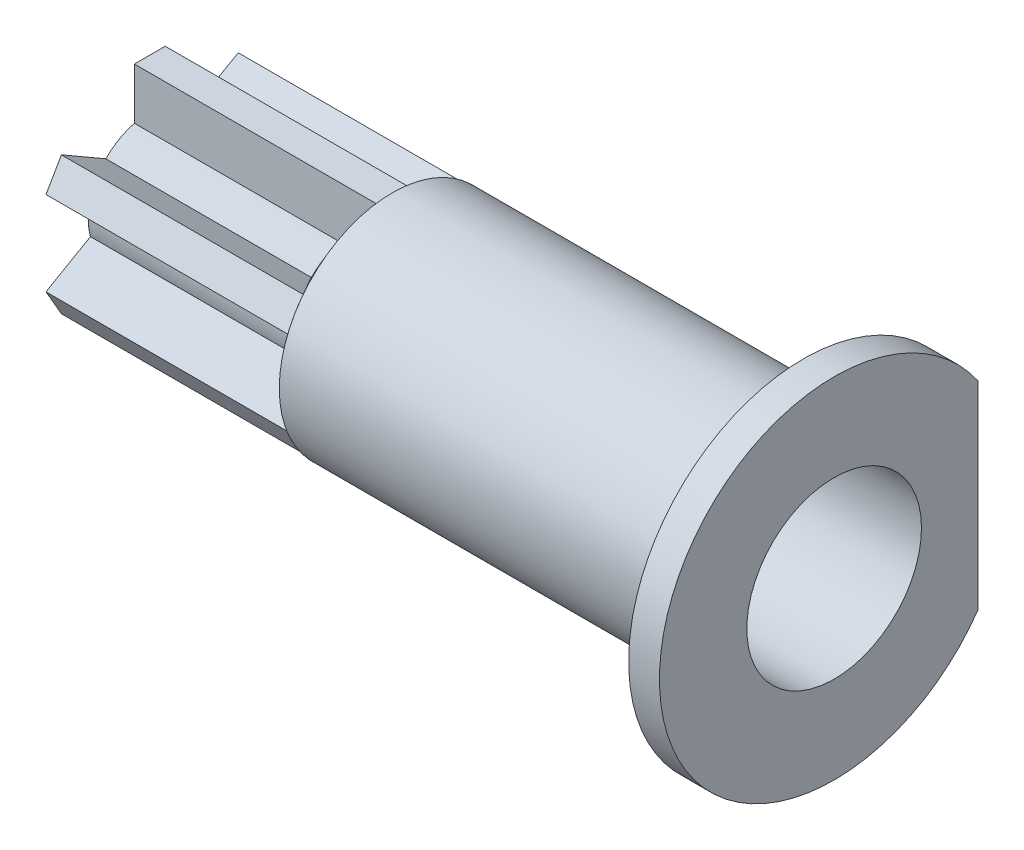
ISO-10303-21;
HEADER;
FILE_DESCRIPTION(('STEP AP214'),'2;1');
FILE_NAME('part.step','',(''),(''),'','','');
FILE_SCHEMA(('AUTOMOTIVE_DESIGN { 1 0 10303 214 1 1 1 1 }'));
ENDSEC;
DATA;
#1=APPLICATION_CONTEXT('core data for automotive mechanical design processes');
#2=APPLICATION_PROTOCOL_DEFINITION('international standard','automotive_design',2000,#1);
#3=PRODUCT_CONTEXT('',#1,'mechanical');
#4=PRODUCT('Part','Part','',(#3));
#5=PRODUCT_RELATED_PRODUCT_CATEGORY('part','',(#4));
#6=PRODUCT_DEFINITION_FORMATION('','',#4);
#7=PRODUCT_DEFINITION_CONTEXT('part definition',#1,'design');
#8=PRODUCT_DEFINITION('design','',#6,#7);
#9=PRODUCT_DEFINITION_SHAPE('','',#8);
#10=(LENGTH_UNIT() NAMED_UNIT(*) SI_UNIT(.MILLI.,.METRE.));
#11=(NAMED_UNIT(*) PLANE_ANGLE_UNIT() SI_UNIT($,.RADIAN.));
#12=(NAMED_UNIT(*) SI_UNIT($,.STERADIAN.) SOLID_ANGLE_UNIT());
#13=UNCERTAINTY_MEASURE_WITH_UNIT(LENGTH_MEASURE(1.E-05),#10,'distance_accuracy_value','');
#14=(GEOMETRIC_REPRESENTATION_CONTEXT(3) GLOBAL_UNCERTAINTY_ASSIGNED_CONTEXT((#13)) GLOBAL_UNIT_ASSIGNED_CONTEXT((#10,
#11,#12)) REPRESENTATION_CONTEXT('',''));
#15=CARTESIAN_POINT('',(0.,0.,0.));
#16=DIRECTION('',(0.,0.,1.));
#17=DIRECTION('',(1.,0.,0.));
#18=AXIS2_PLACEMENT_3D('',#15,#16,#17);
#19=CARTESIAN_POINT('',(0.,0.,0.));
#20=DIRECTION('',(1.,0.,0.));
#21=DIRECTION('',(0.,0.,-1.));
#22=AXIS2_PLACEMENT_3D('',#19,#20,#21);
#23=PLANE('',#22);
#24=CARTESIAN_POINT('',(0.,0.,0.));
#25=DIRECTION('',(-1.,0.,0.));
#26=DIRECTION('',(0.,0.,1.));
#27=AXIS2_PLACEMENT_3D('',#24,#25,#26);
#28=CIRCLE('',#27,3.);
#29=CARTESIAN_POINT('',(0.,-0.802849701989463,2.89057647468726));
#30=VERTEX_POINT('',#29);
#31=CARTESIAN_POINT('',(0.,0.802849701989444,2.89057647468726));
#32=VERTEX_POINT('',#31);
#33=EDGE_CURVE('E442',#30,#32,#28,.T.);
#34=ORIENTED_EDGE('',*,*,#33,.T.);
#35=DIRECTION('',(0.,0.499999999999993,0.866025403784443));
#36=VECTOR('',#35,1.);
#37=CARTESIAN_POINT('',(0.,0.802849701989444,2.89057647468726));
#38=LINE('',#37,#36);
#39=CARTESIAN_POINT('',(0.,2.05048094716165,5.05153718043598));
#40=VERTEX_POINT('',#39);
#41=EDGE_CURVE('E233',#32,#40,#38,.T.);
#42=ORIENTED_EDGE('',*,*,#41,.T.);
#43=DIRECTION('',(0.,0.866025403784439,-0.5));
#44=VECTOR('',#43,1.);
#45=CARTESIAN_POINT('',(0.,3.34951905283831,4.30153718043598));
#46=LINE('',#45,#44);
#47=CARTESIAN_POINT('',(0.,3.34951905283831,4.30153718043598));
#48=VERTEX_POINT('',#47);
#49=EDGE_CURVE('E230',#40,#48,#46,.T.);
#50=ORIENTED_EDGE('',*,*,#49,.T.);
#51=DIRECTION('',(0.,-0.499999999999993,-0.866025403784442));
#52=VECTOR('',#51,1.);
#53=CARTESIAN_POINT('',(0.,2.1018878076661,2.14057647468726));
#54=LINE('',#53,#52);
#55=CARTESIAN_POINT('',(0.,2.1018878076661,2.14057647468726));
#56=VERTEX_POINT('',#55);
#57=EDGE_CURVE('E226',#48,#56,#54,.T.);
#58=ORIENTED_EDGE('',*,*,#57,.T.);
#59=CARTESIAN_POINT('',(0.,2.90473750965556,0.75));
#60=VERTEX_POINT('',#59);
#61=EDGE_CURVE('E41',#56,#60,#28,.T.);
#62=ORIENTED_EDGE('',*,*,#61,.T.);
#63=DIRECTION('',(0.,1.,0.));
#64=VECTOR('',#63,1.);
#65=CARTESIAN_POINT('',(0.,2.90473750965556,0.75));
#66=LINE('',#65,#64);
#67=CARTESIAN_POINT('',(0.,5.4,0.750000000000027));
#68=VERTEX_POINT('',#67);
#69=EDGE_CURVE('E217',#60,#68,#66,.T.);
#70=ORIENTED_EDGE('',*,*,#69,.T.);
#71=DIRECTION('',(0.,0.,-1.));
#72=VECTOR('',#71,1.);
#73=CARTESIAN_POINT('',(0.,5.4,-0.749999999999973));
#74=LINE('',#73,#72);
#75=CARTESIAN_POINT('',(0.,5.4,-0.749999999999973));
#76=VERTEX_POINT('',#75);
#77=EDGE_CURVE('E221',#68,#76,#74,.T.);
#78=ORIENTED_EDGE('',*,*,#77,.T.);
#79=DIRECTION('',(0.,-1.,0.));
#80=VECTOR('',#79,1.);
#81=CARTESIAN_POINT('',(0.,2.90473750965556,-0.75));
#82=LINE('',#81,#80);
#83=CARTESIAN_POINT('',(0.,2.90473750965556,-0.75));
#84=VERTEX_POINT('',#83);
#85=EDGE_CURVE('E272',#76,#84,#82,.T.);
#86=ORIENTED_EDGE('',*,*,#85,.T.);
#87=CARTESIAN_POINT('',(0.,2.10188780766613,-2.14057647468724));
#88=VERTEX_POINT('',#87);
#89=EDGE_CURVE('E568',#84,#88,#28,.T.);
#90=ORIENTED_EDGE('',*,*,#89,.T.);
#91=DIRECTION('',(0.,0.499999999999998,-0.86602540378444));
#92=VECTOR('',#91,1.);
#93=CARTESIAN_POINT('',(0.,2.10188780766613,-2.14057647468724));
#94=LINE('',#93,#92);
#95=CARTESIAN_POINT('',(0.,3.34951905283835,-4.30153718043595));
#96=VERTEX_POINT('',#95);
#97=EDGE_CURVE('E269',#88,#96,#94,.T.);
#98=ORIENTED_EDGE('',*,*,#97,.T.);
#99=DIRECTION('',(0.,-0.866025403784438,-0.500000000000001));
#100=VECTOR('',#99,1.);
#101=CARTESIAN_POINT('',(0.,2.05048094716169,-5.05153718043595));
#102=LINE('',#101,#100);
#103=CARTESIAN_POINT('',(0.,2.05048094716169,-5.05153718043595));
#104=VERTEX_POINT('',#103);
#105=EDGE_CURVE('E266',#96,#104,#102,.T.);
#106=ORIENTED_EDGE('',*,*,#105,.T.);
#107=DIRECTION('',(0.,-0.499999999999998,0.86602540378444));
#108=VECTOR('',#107,1.);
#109=CARTESIAN_POINT('',(0.,0.802849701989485,-2.89057647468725));
#110=LINE('',#109,#108);
#111=CARTESIAN_POINT('',(0.,0.802849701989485,-2.89057647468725));
#112=VERTEX_POINT('',#111);
#113=EDGE_CURVE('E263',#104,#112,#110,.T.);
#114=ORIENTED_EDGE('',*,*,#113,.T.);
#115=CARTESIAN_POINT('',(0.,-0.802849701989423,-2.89057647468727));
#116=VERTEX_POINT('',#115);
#117=EDGE_CURVE('E571',#112,#116,#28,.T.);
#118=ORIENTED_EDGE('',*,*,#117,.T.);
#119=DIRECTION('',(0.,-0.5,-0.866025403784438));
#120=VECTOR('',#119,1.);
#121=CARTESIAN_POINT('',(0.,-0.802849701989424,-2.89057647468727));
#122=LINE('',#121,#120);
#123=CARTESIAN_POINT('',(0.,-2.05048094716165,-5.05153718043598));
#124=VERTEX_POINT('',#123);
#125=EDGE_CURVE('E260',#116,#124,#122,.T.);
#126=ORIENTED_EDGE('',*,*,#125,.T.);
#127=DIRECTION('',(0.,-0.866025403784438,0.500000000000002));
#128=VECTOR('',#127,1.);
#129=CARTESIAN_POINT('',(0.,-3.34951905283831,-4.30153718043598));
#130=LINE('',#129,#128);
#131=CARTESIAN_POINT('',(0.,-3.34951905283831,-4.30153718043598));
#132=VERTEX_POINT('',#131);
#133=EDGE_CURVE('E257',#124,#132,#130,.T.);
#134=ORIENTED_EDGE('',*,*,#133,.T.);
#135=DIRECTION('',(0.,0.500000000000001,0.866025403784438));
#136=VECTOR('',#135,1.);
#137=CARTESIAN_POINT('',(0.,-2.10188780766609,-2.14057647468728));
#138=LINE('',#137,#136);
#139=CARTESIAN_POINT('',(0.,-2.10188780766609,-2.14057647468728));
#140=VERTEX_POINT('',#139);
#141=EDGE_CURVE('E254',#132,#140,#138,.T.);
#142=ORIENTED_EDGE('',*,*,#141,.T.);
#143=CARTESIAN_POINT('',(0.,-2.90473750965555,-0.750000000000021));
#144=VERTEX_POINT('',#143);
#145=EDGE_CURVE('E564',#140,#144,#28,.T.);
#146=ORIENTED_EDGE('',*,*,#145,.T.);
#147=DIRECTION('',(0.,-1.,0.));
#148=VECTOR('',#147,1.);
#149=CARTESIAN_POINT('',(0.,-2.90473750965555,-0.75000000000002));
#150=LINE('',#149,#148);
#151=CARTESIAN_POINT('',(0.,-5.4,-0.750000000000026));
#152=VERTEX_POINT('',#151);
#153=EDGE_CURVE('E251',#144,#152,#150,.T.);
#154=ORIENTED_EDGE('',*,*,#153,.T.);
#155=DIRECTION('',(0.,0.,1.));
#156=VECTOR('',#155,1.);
#157=CARTESIAN_POINT('',(0.,-5.4,0.749999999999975));
#158=LINE('',#157,#156);
#159=CARTESIAN_POINT('',(0.,-5.4,0.749999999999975));
#160=VERTEX_POINT('',#159);
#161=EDGE_CURVE('E248',#152,#160,#158,.T.);
#162=ORIENTED_EDGE('',*,*,#161,.T.);
#163=DIRECTION('',(0.,1.,0.));
#164=VECTOR('',#163,1.);
#165=CARTESIAN_POINT('',(0.,-2.90473750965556,0.74999999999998));
#166=LINE('',#165,#164);
#167=CARTESIAN_POINT('',(0.,-2.90473750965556,0.74999999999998));
#168=VERTEX_POINT('',#167);
#169=EDGE_CURVE('E245',#160,#168,#166,.T.);
#170=ORIENTED_EDGE('',*,*,#169,.T.);
#171=CARTESIAN_POINT('',(0.,-2.10188780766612,2.14057647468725));
#172=VERTEX_POINT('',#171);
#173=EDGE_CURVE('E562',#168,#172,#28,.T.);
#174=ORIENTED_EDGE('',*,*,#173,.T.);
#175=DIRECTION('',(0.,-0.500000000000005,0.866025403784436));
#176=VECTOR('',#175,1.);
#177=CARTESIAN_POINT('',(0.,-2.10188780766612,2.14057647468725));
#178=LINE('',#177,#176);
#179=CARTESIAN_POINT('',(0.,-3.34951905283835,4.30153718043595));
#180=VERTEX_POINT('',#179);
#181=EDGE_CURVE('E242',#172,#180,#178,.T.);
#182=ORIENTED_EDGE('',*,*,#181,.T.);
#183=DIRECTION('',(0.,0.866025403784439,0.499999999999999));
#184=VECTOR('',#183,1.);
#185=CARTESIAN_POINT('',(0.,-2.05048094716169,5.05153718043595));
#186=LINE('',#185,#184);
#187=CARTESIAN_POINT('',(0.,-2.05048094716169,5.05153718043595));
#188=VERTEX_POINT('',#187);
#189=EDGE_CURVE('E239',#180,#188,#186,.T.);
#190=ORIENTED_EDGE('',*,*,#189,.T.);
#191=DIRECTION('',(0.,0.500000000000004,-0.866025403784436));
#192=VECTOR('',#191,1.);
#193=CARTESIAN_POINT('',(0.,-0.802849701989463,2.89057647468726));
#194=LINE('',#193,#192);
#195=EDGE_CURVE('E236',#188,#30,#194,.T.);
#196=ORIENTED_EDGE('',*,*,#195,.T.);
#197=EDGE_LOOP('',(#34,#42,#50,#58,#62,#70,#78,#86,#90,#98,#106,#114,#118,#126,#134,#142,#146,
#154,#162,#170,#174,#182,#190,#196));
#198=FACE_BOUND('',#197,.T.);
#199=CARTESIAN_POINT('',(0.,0.,0.));
#200=DIRECTION('',(-1.,0.,0.));
#201=DIRECTION('',(0.,0.,1.));
#202=AXIS2_PLACEMENT_3D('',#199,#200,#201);
#203=CIRCLE('',#202,1.64999999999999);
#204=CARTESIAN_POINT('',(0.,0.,1.64999999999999));
#205=VERTEX_POINT('',#204);
#206=EDGE_CURVE('E218',#205,#205,#203,.T.);
#207=ORIENTED_EDGE('',*,*,#206,.F.);
#208=EDGE_LOOP('',(#207));
#209=FACE_BOUND('',#208,.T.);
#210=ADVANCED_FACE('F34',(#198,#209),#23,.F.);
#211=CARTESIAN_POINT('',(-45.0899840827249,0.,0.));
#212=DIRECTION('',(-1.,0.,0.));
#213=DIRECTION('',(0.,0.,1.));
#214=AXIS2_PLACEMENT_3D('',#211,#212,#213);
#215=CYLINDRICAL_SURFACE('',#214,3.);
#216=ORIENTED_EDGE('',*,*,#89,.F.);
#217=DIRECTION('',(-1.,0.,0.));
#218=VECTOR('',#217,1.);
#219=CARTESIAN_POINT('',(33.301,2.90473750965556,-0.75));
#220=LINE('',#219,#218);
#221=CARTESIAN_POINT('',(10.,2.90473750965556,-0.75));
#222=VERTEX_POINT('',#221);
#223=EDGE_CURVE('E526',#222,#84,#220,.T.);
#224=ORIENTED_EDGE('',*,*,#223,.F.);
#225=CARTESIAN_POINT('',(10.,0.,0.));
#226=DIRECTION('',(-1.,0.,0.));
#227=DIRECTION('',(0.,0.,1.));
#228=AXIS2_PLACEMENT_3D('',#225,#226,#227);
#229=CIRCLE('',#228,3.);
#230=CARTESIAN_POINT('',(10.,2.10188780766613,-2.14057647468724));
#231=VERTEX_POINT('',#230);
#232=EDGE_CURVE('E566',#222,#231,#229,.T.);
#233=ORIENTED_EDGE('',*,*,#232,.T.);
#234=DIRECTION('',(-1.,0.,0.));
#235=VECTOR('',#234,1.);
#236=CARTESIAN_POINT('',(33.301,2.10188780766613,-2.14057647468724));
#237=LINE('',#236,#235);
#238=EDGE_CURVE('E405',#231,#88,#237,.T.);
#239=ORIENTED_EDGE('',*,*,#238,.T.);
#240=EDGE_LOOP('',(#216,#224,#233,#239));
#241=FACE_BOUND('',#240,.T.);
#242=ADVANCED_FACE('F431',(#241),#215,.T.);
#243=ORIENTED_EDGE('',*,*,#117,.F.);
#244=DIRECTION('',(-1.,0.,0.));
#245=VECTOR('',#244,1.);
#246=CARTESIAN_POINT('',(33.301,0.802849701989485,-2.89057647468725));
#247=LINE('',#246,#245);
#248=CARTESIAN_POINT('',(10.,0.802849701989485,-2.89057647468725));
#249=VERTEX_POINT('',#248);
#250=EDGE_CURVE('E516',#249,#112,#247,.T.);
#251=ORIENTED_EDGE('',*,*,#250,.F.);
#252=CARTESIAN_POINT('',(10.,-0.802849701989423,-2.89057647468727));
#253=VERTEX_POINT('',#252);
#254=EDGE_CURVE('E515',#249,#253,#229,.T.);
#255=ORIENTED_EDGE('',*,*,#254,.T.);
#256=DIRECTION('',(-1.,0.,0.));
#257=VECTOR('',#256,1.);
#258=CARTESIAN_POINT('',(33.301,-0.802849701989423,-2.89057647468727));
#259=LINE('',#258,#257);
#260=EDGE_CURVE('E517',#253,#116,#259,.T.);
#261=ORIENTED_EDGE('',*,*,#260,.T.);
#262=EDGE_LOOP('',(#243,#251,#255,#261));
#263=FACE_BOUND('',#262,.T.);
#264=ADVANCED_FACE('F436',(#263),#215,.T.);
#265=ORIENTED_EDGE('',*,*,#145,.F.);
#266=DIRECTION('',(-1.,0.,0.));
#267=VECTOR('',#266,1.);
#268=CARTESIAN_POINT('',(33.301,-2.10188780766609,-2.14057647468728));
#269=LINE('',#268,#267);
#270=CARTESIAN_POINT('',(10.,-2.10188780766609,-2.14057647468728));
#271=VERTEX_POINT('',#270);
#272=EDGE_CURVE('E583',#271,#140,#269,.T.);
#273=ORIENTED_EDGE('',*,*,#272,.F.);
#274=CARTESIAN_POINT('',(10.,-2.90473750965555,-0.750000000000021));
#275=VERTEX_POINT('',#274);
#276=EDGE_CURVE('E586',#271,#275,#229,.T.);
#277=ORIENTED_EDGE('',*,*,#276,.T.);
#278=DIRECTION('',(-1.,0.,0.));
#279=VECTOR('',#278,1.);
#280=CARTESIAN_POINT('',(33.301,-2.90473750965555,-0.750000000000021));
#281=LINE('',#280,#279);
#282=EDGE_CURVE('E585',#275,#144,#281,.T.);
#283=ORIENTED_EDGE('',*,*,#282,.T.);
#284=EDGE_LOOP('',(#265,#273,#277,#283));
#285=FACE_BOUND('',#284,.T.);
#286=ADVANCED_FACE('F581',(#285),#215,.T.);
#287=ORIENTED_EDGE('',*,*,#173,.F.);
#288=DIRECTION('',(-1.,0.,0.));
#289=VECTOR('',#288,1.);
#290=CARTESIAN_POINT('',(33.301,-2.90473750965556,0.74999999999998));
#291=LINE('',#290,#289);
#292=CARTESIAN_POINT('',(10.,-2.90473750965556,0.74999999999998));
#293=VERTEX_POINT('',#292);
#294=EDGE_CURVE('E610',#293,#168,#291,.T.);
#295=ORIENTED_EDGE('',*,*,#294,.F.);
#296=CARTESIAN_POINT('',(10.,-2.10188780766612,2.14057647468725));
#297=VERTEX_POINT('',#296);
#298=EDGE_CURVE('E560',#293,#297,#229,.T.);
#299=ORIENTED_EDGE('',*,*,#298,.T.);
#300=DIRECTION('',(-1.,0.,0.));
#301=VECTOR('',#300,1.);
#302=CARTESIAN_POINT('',(33.301,-2.10188780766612,2.14057647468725));
#303=LINE('',#302,#301);
#304=EDGE_CURVE('E609',#297,#172,#303,.T.);
#305=ORIENTED_EDGE('',*,*,#304,.T.);
#306=EDGE_LOOP('',(#287,#295,#299,#305));
#307=FACE_BOUND('',#306,.T.);
#308=ADVANCED_FACE('F608',(#307),#215,.T.);
#309=ORIENTED_EDGE('',*,*,#33,.F.);
#310=DIRECTION('',(-1.,0.,0.));
#311=VECTOR('',#310,1.);
#312=CARTESIAN_POINT('',(33.301,-0.802849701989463,2.89057647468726));
#313=LINE('',#312,#311);
#314=CARTESIAN_POINT('',(10.,-0.802849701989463,2.89057647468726));
#315=VERTEX_POINT('',#314);
#316=EDGE_CURVE('E631',#315,#30,#313,.T.);
#317=ORIENTED_EDGE('',*,*,#316,.F.);
#318=CARTESIAN_POINT('',(10.,0.802849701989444,2.89057647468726));
#319=VERTEX_POINT('',#318);
#320=EDGE_CURVE('E558',#315,#319,#229,.T.);
#321=ORIENTED_EDGE('',*,*,#320,.T.);
#322=DIRECTION('',(-1.,0.,0.));
#323=VECTOR('',#322,1.);
#324=CARTESIAN_POINT('',(33.301,0.802849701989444,2.89057647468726));
#325=LINE('',#324,#323);
#326=EDGE_CURVE('E636',#319,#32,#325,.T.);
#327=ORIENTED_EDGE('',*,*,#326,.T.);
#328=EDGE_LOOP('',(#309,#317,#321,#327));
#329=FACE_BOUND('',#328,.T.);
#330=ADVANCED_FACE('F634',(#329),#215,.T.);
#331=ORIENTED_EDGE('',*,*,#61,.F.);
#332=DIRECTION('',(-1.,0.,0.));
#333=VECTOR('',#332,1.);
#334=CARTESIAN_POINT('',(33.301,2.1018878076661,2.14057647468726));
#335=LINE('',#334,#333);
#336=CARTESIAN_POINT('',(10.,2.1018878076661,2.14057647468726));
#337=VERTEX_POINT('',#336);
#338=EDGE_CURVE('E646',#337,#56,#335,.T.);
#339=ORIENTED_EDGE('',*,*,#338,.F.);
#340=CARTESIAN_POINT('',(10.,2.90473750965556,0.75));
#341=VERTEX_POINT('',#340);
#342=EDGE_CURVE('E561',#337,#341,#229,.T.);
#343=ORIENTED_EDGE('',*,*,#342,.T.);
#344=DIRECTION('',(-1.,0.,0.));
#345=VECTOR('',#344,1.);
#346=CARTESIAN_POINT('',(33.301,2.90473750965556,0.75));
#347=LINE('',#346,#345);
#348=EDGE_CURVE('E647',#341,#60,#347,.T.);
#349=ORIENTED_EDGE('',*,*,#348,.T.);
#350=EDGE_LOOP('',(#331,#339,#343,#349));
#351=FACE_BOUND('',#350,.T.);
#352=ADVANCED_FACE('F438',(#351),#215,.T.);
#353=CARTESIAN_POINT('',(11.8,0.,0.));
#354=DIRECTION('',(1.,0.,0.));
#355=DIRECTION('',(0.,0.,-1.));
#356=AXIS2_PLACEMENT_3D('',#353,#354,#355);
#357=CONICAL_SURFACE('',#356,5.5,0.946773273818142);
#358=CARTESIAN_POINT('',(11.7653437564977,3.34971905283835,-4.30142171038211));
#359=CARTESIAN_POINT('',(11.7529559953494,3.24165474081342,-4.3638126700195));
#360=CARTESIAN_POINT('',(11.743612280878,3.13332314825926,-4.42635794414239));
#361=CARTESIAN_POINT('',(11.7311419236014,2.9166605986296,-4.55144812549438));
#362=CARTESIAN_POINT('',(11.728,2.80833029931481,-4.61399265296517));
#363=CARTESIAN_POINT('',(11.728,2.59166970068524,-4.73908170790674));
#364=CARTESIAN_POINT('',(11.7311419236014,2.48333940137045,-4.80162623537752));
#365=CARTESIAN_POINT('',(11.743612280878,2.26667685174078,-4.92671641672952));
#366=CARTESIAN_POINT('',(11.7529559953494,2.15834525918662,-4.98926169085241));
#367=CARTESIAN_POINT('',(11.7653437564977,2.05028094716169,-5.05165265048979));
#368=B_SPLINE_CURVE_WITH_KNOTS('',3,(#358,#359,#360,#361,#362,#363,#364,#365,#366,#367),
.UNSPECIFIED.,.F.,.F.,(4,2,2,2,4),(0.,0.376158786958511,0.751389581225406,1.1266203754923,
1.50277916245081),.UNSPECIFIED.);
#369=CARTESIAN_POINT('',(11.7653208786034,3.34951905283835,-4.30153718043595));
#370=VERTEX_POINT('',#369);
#371=CARTESIAN_POINT('',(11.7653208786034,2.05048094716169,-5.05153718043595));
#372=VERTEX_POINT('',#371);
#373=EDGE_CURVE('E48',#370,#372,#368,.T.);
#374=ORIENTED_EDGE('',*,*,#373,.F.);
#375=CARTESIAN_POINT('',(18.5239845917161,-6.76043182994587,13.2094114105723));
#376=CARTESIAN_POINT('',(18.1249576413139,-6.48297113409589,12.7288353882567));
#377=CARTESIAN_POINT('',(17.7259613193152,-6.20549941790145,12.2482402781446));
#378=CARTESIAN_POINT('',(16.9280530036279,-5.65049901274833,11.286951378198));
#379=CARTESIAN_POINT('',(16.5291410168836,-5.37297032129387,10.8062575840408));
#380=CARTESIAN_POINT('',(15.7310092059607,-4.81753201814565,9.84421022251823));
#381=CARTESIAN_POINT('',(15.3317895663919,-4.5396223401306,9.36285654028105));
#382=CARTESIAN_POINT('',(14.5336257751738,-3.98373048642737,8.40002360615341));
#383=CARTESIAN_POINT('',(14.1346816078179,-3.70574831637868,7.91854436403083));
#384=CARTESIAN_POINT('',(13.5373722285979,-3.2891979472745,7.19705796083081));
#385=CARTESIAN_POINT('',(13.3388413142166,-3.15068915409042,6.95715369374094));
#386=CARTESIAN_POINT('',(12.941930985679,-2.87361575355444,6.47724848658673));
#387=CARTESIAN_POINT('',(12.7435515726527,-2.73505114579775,6.2372475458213));
#388=CARTESIAN_POINT('',(12.3469722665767,-2.45781717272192,5.75706421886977));
#389=CARTESIAN_POINT('',(12.148772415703,-2.31914779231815,5.51688180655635));
#390=CARTESIAN_POINT('',(11.7527032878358,-2.04169662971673,5.03632229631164));
#391=CARTESIAN_POINT('',(11.5548340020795,-1.9029148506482,4.79594520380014));
#392=CARTESIAN_POINT('',(11.1597793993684,-1.62527946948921,4.31506661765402));
#393=CARTESIAN_POINT('',(10.9625936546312,-1.48642601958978,4.07456538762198));
#394=CARTESIAN_POINT('',(10.5690862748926,-1.20839195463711,3.59299626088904));
#395=CARTESIAN_POINT('',(10.3727647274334,-1.06921130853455,3.35192831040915));
#396=CARTESIAN_POINT('',(10.079658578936,-0.85999830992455,2.98956076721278));
#397=CARTESIAN_POINT('',(9.98220476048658,-0.790200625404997,2.86866763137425));
#398=CARTESIAN_POINT('',(9.78798306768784,-0.650363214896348,2.62646213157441));
#399=CARTESIAN_POINT('',(9.69121521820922,-0.580323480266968,2.50514975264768));
#400=CARTESIAN_POINT('',(9.49878188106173,-0.439883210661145,2.26190007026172));
#401=CARTESIAN_POINT('',(9.4031161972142,-0.369482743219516,2.13996288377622));
#402=CARTESIAN_POINT('',(9.26106848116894,-0.263398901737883,1.95622028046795));
#403=CARTESIAN_POINT('',(9.21396240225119,-0.227958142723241,1.89483508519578));
#404=CARTESIAN_POINT('',(9.12042755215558,-0.156854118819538,1.77167930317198));
#405=CARTESIAN_POINT('',(9.07399876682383,-0.121190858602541,1.70990872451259));
#406=CARTESIAN_POINT('',(9.01010013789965,-0.0713722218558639,1.62362031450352));
#407=CARTESIAN_POINT('',(8.99221834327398,-0.0573489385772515,1.59933127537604));
#408=CARTESIAN_POINT('',(8.9566300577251,-0.0292468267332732,1.55065698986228));
#409=CARTESIAN_POINT('',(8.93892356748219,-0.015167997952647,1.52627174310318));
#410=CARTESIAN_POINT('',(8.88610706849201,0.0271658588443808,1.45294735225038));
#411=CARTESIAN_POINT('',(8.85130217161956,0.0555165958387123,1.40384243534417));
#412=CARTESIAN_POINT('',(8.78268111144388,0.112695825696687,1.3048051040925));
#413=CARTESIAN_POINT('',(8.74887028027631,0.141525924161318,1.25486990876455));
#414=CARTESIAN_POINT('',(8.68294518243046,0.199667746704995,1.15416531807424));
#415=CARTESIAN_POINT('',(8.65083069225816,0.228979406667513,1.10339603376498));
#416=CARTESIAN_POINT('',(8.59748975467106,0.280315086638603,1.01448002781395));
#417=CARTESIAN_POINT('',(8.57565672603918,0.302180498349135,0.976608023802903));
#418=CARTESIAN_POINT('',(8.5339592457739,0.346373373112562,0.900063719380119));
#419=CARTESIAN_POINT('',(8.51409416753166,0.36870068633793,0.861391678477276));
#420=CARTESIAN_POINT('',(8.47724580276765,0.413821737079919,0.783239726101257));
#421=CARTESIAN_POINT('',(8.46024866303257,0.436612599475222,0.743764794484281));
#422=CARTESIAN_POINT('',(8.43019681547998,0.482837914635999,0.663700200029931));
#423=CARTESIAN_POINT('',(8.41713870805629,0.506271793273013,0.62311153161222));
#424=CARTESIAN_POINT('',(8.39971028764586,0.546131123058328,0.554073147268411));
#425=CARTESIAN_POINT('',(8.39389693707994,0.562397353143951,0.525899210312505));
#426=CARTESIAN_POINT('',(8.38516097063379,0.595123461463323,0.46921592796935));
#427=CARTESIAN_POINT('',(8.38223752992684,0.611583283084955,0.440706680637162));
#428=CARTESIAN_POINT('',(8.37953018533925,0.644526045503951,0.38364814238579));
#429=CARTESIAN_POINT('',(8.37973811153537,0.66100881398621,0.355099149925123));
#430=CARTESIAN_POINT('',(8.38325355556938,0.693891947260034,0.298143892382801));
#431=CARTESIAN_POINT('',(8.38656172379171,0.710292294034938,0.269737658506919));
#432=CARTESIAN_POINT('',(8.3975771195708,0.748287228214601,0.203928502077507));
#433=CARTESIAN_POINT('',(8.40637891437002,0.769801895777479,0.166664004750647));
#434=CARTESIAN_POINT('',(8.42799097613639,0.81231910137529,0.093022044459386));
#435=CARTESIAN_POINT('',(8.44080429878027,0.833321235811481,0.0566452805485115));
#436=CARTESIAN_POINT('',(8.46954264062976,0.874999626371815,-0.0155438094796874));
#437=CARTESIAN_POINT('',(8.48549613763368,0.895670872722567,-0.0513474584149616));
#438=CARTESIAN_POINT('',(8.51959677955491,0.936541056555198,-0.122136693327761));
#439=CARTESIAN_POINT('',(8.53774324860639,0.956740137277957,-0.157122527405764));
#440=CARTESIAN_POINT('',(8.57767969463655,0.998922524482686,-0.230184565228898));
#441=CARTESIAN_POINT('',(8.5996514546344,1.02086241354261,-0.268185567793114));
#442=CARTESIAN_POINT('',(8.64499668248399,1.06437875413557,-0.343558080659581));
#443=CARTESIAN_POINT('',(8.6683704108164,1.08595513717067,-0.380929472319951));
#444=CARTESIAN_POINT('',(8.74002956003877,1.15029149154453,-0.492363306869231));
#445=CARTESIAN_POINT('',(8.78982388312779,1.19262943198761,-0.565694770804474));
#446=CARTESIAN_POINT('',(8.8917719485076,1.27670432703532,-0.711316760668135));
#447=CARTESIAN_POINT('',(8.94393063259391,1.31843975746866,-0.783604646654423));
#448=CARTESIAN_POINT('',(9.04963629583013,1.40144456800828,-0.927373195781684));
#449=CARTESIAN_POINT('',(9.10318271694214,1.44271412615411,-0.998854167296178));
#450=CARTESIAN_POINT('',(9.21114563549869,1.52491168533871,-1.14122451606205));
#451=CARTESIAN_POINT('',(9.26556128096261,1.56583996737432,-1.21211438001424));
#452=CARTESIAN_POINT('',(9.37503251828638,1.64748758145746,-1.35353219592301));
#453=CARTESIAN_POINT('',(9.4300881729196,1.68820689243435,-1.42406011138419));
#454=CARTESIAN_POINT('',(9.54057685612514,1.76943403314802,-1.56474964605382));
#455=CARTESIAN_POINT('',(9.5960092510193,1.8099420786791,-1.63491163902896));
#456=CARTESIAN_POINT('',(9.70720900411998,1.8908410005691,-1.77503268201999));
#457=CARTESIAN_POINT('',(9.76297635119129,1.93123188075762,-1.84499173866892));
#458=CARTESIAN_POINT('',(9.92987976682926,2.05171211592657,-2.0536696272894));
#459=CARTESIAN_POINT('',(10.0413876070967,2.13167265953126,-2.19216535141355));
#460=CARTESIAN_POINT('',(10.2650168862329,2.29137906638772,-2.46878496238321));
#461=CARTESIAN_POINT('',(10.3771383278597,2.37112492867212,-2.60690884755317));
#462=CARTESIAN_POINT('',(10.7141057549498,2.61015533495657,-3.02092165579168));
#463=CARTESIAN_POINT('',(10.9395497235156,2.76922902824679,-3.29644537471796));
#464=CARTESIAN_POINT('',(11.3913445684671,3.08718479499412,-3.84716091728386));
#465=CARTESIAN_POINT('',(11.6176958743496,3.24606671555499,-4.12235247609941));
#466=CARTESIAN_POINT('',(12.0708580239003,3.56366418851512,-4.67244743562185));
#467=CARTESIAN_POINT('',(12.2976688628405,3.72237974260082,-4.94735083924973));
#468=CARTESIAN_POINT('',(12.7512319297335,4.0394667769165,-5.49656169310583));
#469=CARTESIAN_POINT('',(12.9779837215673,4.1978384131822,-5.77086941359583));
#470=CARTESIAN_POINT('',(13.4316801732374,4.5145132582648,-6.31936633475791));
#471=CARTESIAN_POINT('',(13.6586248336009,4.67281646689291,-6.59355553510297));
#472=CARTESIAN_POINT('',(14.3395793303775,5.14760067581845,-7.41590590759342));
#473=CARTESIAN_POINT('',(14.7937874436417,5.46401057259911,-7.96394392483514));
#474=CARTESIAN_POINT('',(16.0174782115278,6.31606338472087,-9.43974268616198));
#475=CARTESIAN_POINT('',(16.7872190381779,6.85161358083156,-10.3673428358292));
#476=CARTESIAN_POINT('',(18.3271002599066,7.92262405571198,-12.2223873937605));
#477=CARTESIAN_POINT('',(19.0972406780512,8.45808432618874,-13.1498317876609));
#478=CARTESIAN_POINT('',(20.6391948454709,9.52996787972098,-15.0063885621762));
#479=CARTESIAN_POINT('',(21.4110089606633,10.0663910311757,-15.935500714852));
#480=CARTESIAN_POINT('',(22.9547055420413,11.1391586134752,-17.7935886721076));
#481=CARTESIAN_POINT('',(23.7265880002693,11.6755030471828,-18.7225644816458));
#482=CARTESIAN_POINT('',(24.4984948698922,12.2118386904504,-19.6515250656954));
#483=B_SPLINE_CURVE_WITH_KNOTS('',3,(#375,#376,#377,#378,#379,#380,#381,#382,#383,#384,#385,
#386,#387,#388,#389,#390,#391,#392,#393,#394,#395,#396,#397,#398,#399,#400,#401,#402,#403,#404,
#405,#406,#407,#408,#409,#410,#411,#412,#413,#414,#415,#416,#417,#418,#419,#420,#421,#422,#423,
#424,#425,#426,#427,#428,#429,#430,#431,#432,#433,#434,#435,#436,#437,#438,#439,#440,#441,#442,
#443,#444,#445,#446,#447,#448,#449,#450,#451,#452,#453,#454,#455,#456,#457,#458,#459,#460,#461,
#462,#463,#464,#465,#466,#467,#468,#469,#470,#471,#472,#473,#474,#475,#476,#477,#478,#479,#480,
#481,#482),.UNSPECIFIED.,.F.,.F.,(4,2,2,2,2,2,2,2,2,2,2,2,2,2,2,2,2,2,2,2,2,2,2,2,2,2,2,2,2,2,2,
2,2,2,2,2,2,2,2,2,2,2,2,2,2,2,2,2,2,2,2,2,2,4),(0.,2.0504737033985,4.1010773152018,
6.15407589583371,8.20694572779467,9.22938366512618,10.2518291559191,11.274472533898,
12.2970883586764,13.3188657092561,14.3407442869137,14.8514844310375,15.3622429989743,
15.8729092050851,16.1282273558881,16.3835401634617,16.4833259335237,16.5831120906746,
16.782696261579,16.9832057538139,17.1836887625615,17.3302900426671,17.4768444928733,
17.6226693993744,17.768368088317,17.8674014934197,17.9664066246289,18.0651534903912,
18.1639210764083,18.2954221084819,18.4270235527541,18.5598785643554,18.6926927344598,
18.8398771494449,18.9870889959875,19.2817083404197,19.5769747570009,19.8721242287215,
20.1670002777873,20.4619054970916,20.7563992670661,21.0508833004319,21.6357555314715,
22.2206303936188,23.390406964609,24.5608249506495,25.7312309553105,26.8998557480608,
28.0684837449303,30.4053389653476,34.3623342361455,38.3195912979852,42.2844703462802,
46.2490857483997),.UNSPECIFIED.);
#484=EDGE_CURVE('E398',#231,#370,#483,.T.);
#485=ORIENTED_EDGE('',*,*,#484,.F.);
#486=ORIENTED_EDGE('',*,*,#232,.F.);
#487=CARTESIAN_POINT('',(22.7897471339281,20.7499878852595,-0.749999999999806));
#488=CARTESIAN_POINT('',(22.1770326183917,19.8984312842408,-0.749999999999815));
#489=CARTESIAN_POINT('',(21.5643429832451,19.0468567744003,-0.749999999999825));
#490=CARTESIAN_POINT('',(20.3390507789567,17.3436218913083,-0.749999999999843));
#491=CARTESIAN_POINT('',(19.7264482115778,16.4919615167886,-0.749999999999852));
#492=CARTESIAN_POINT('',(18.5010970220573,14.7881288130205,-0.749999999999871));
#493=CARTESIAN_POINT('',(17.8883484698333,13.935956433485,-0.74999999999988));
#494=CARTESIAN_POINT('',(16.6631115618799,12.2314475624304,-0.749999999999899));
#495=CARTESIAN_POINT('',(16.050623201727,11.3791110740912,-0.749999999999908));
#496=CARTESIAN_POINT('',(14.9360487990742,9.82717360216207,-0.749999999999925));
#497=CARTESIAN_POINT('',(14.4338861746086,9.12762763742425,-0.749999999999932));
#498=CARTESIAN_POINT('',(13.6810993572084,8.0779532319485,-0.749999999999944));
#499=CARTESIAN_POINT('',(13.4302400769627,7.72799340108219,-0.749999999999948));
#500=CARTESIAN_POINT('',(12.9287599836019,7.02790638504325,-0.749999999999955));
#501=CARTESIAN_POINT('',(12.6781391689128,6.67777920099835,-0.749999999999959));
#502=CARTESIAN_POINT('',(12.1773507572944,5.97737024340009,-0.749999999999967));
#503=CARTESIAN_POINT('',(11.9271830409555,5.62708855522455,-0.74999999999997));
#504=CARTESIAN_POINT('',(11.4274634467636,4.92607260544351,-0.749999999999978));
#505=CARTESIAN_POINT('',(11.1779115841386,4.57533833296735,-0.749999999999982));
#506=CARTESIAN_POINT('',(10.8045106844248,4.04860445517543,-0.749999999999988));
#507=CARTESIAN_POINT('',(10.6802040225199,3.87292935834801,-0.749999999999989));
#508=CARTESIAN_POINT('',(10.4320499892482,3.52125520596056,-0.749999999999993));
#509=CARTESIAN_POINT('',(10.3082026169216,3.34525615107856,-0.749999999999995));
#510=CARTESIAN_POINT('',(10.061229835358,2.99276245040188,-0.749999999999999));
#511=CARTESIAN_POINT('',(9.9381043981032,2.81626782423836,-0.750000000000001));
#512=CARTESIAN_POINT('',(9.69304364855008,2.4624548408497,-0.750000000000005));
#513=CARTESIAN_POINT('',(9.57110831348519,2.28513649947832,-0.750000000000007));
#514=CARTESIAN_POINT('',(9.42504569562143,2.06979239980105,-0.750000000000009));
#515=CARTESIAN_POINT('',(9.39982836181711,2.03250641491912,-0.750000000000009));
#516=CARTESIAN_POINT('',(9.34951458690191,1.95785285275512,-0.75000000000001));
#517=CARTESIAN_POINT('',(9.32441814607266,1.92048527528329,-0.750000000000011));
#518=CARTESIAN_POINT('',(9.24932778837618,1.80822650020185,-0.750000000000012));
#519=CARTESIAN_POINT('',(9.19954342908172,1.73319484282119,-0.750000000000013));
#520=CARTESIAN_POINT('',(9.09985619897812,1.58123496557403,-0.750000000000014));
#521=CARTESIAN_POINT('',(9.04996785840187,1.50429717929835,-0.750000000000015));
#522=CARTESIAN_POINT('',(8.95143494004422,1.34969577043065,-0.750000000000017));
#523=CARTESIAN_POINT('',(8.902789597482,1.27203263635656,-0.750000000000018));
#524=CARTESIAN_POINT('',(8.80677089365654,1.11456035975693,-0.750000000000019));
#525=CARTESIAN_POINT('',(8.75942133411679,1.03473650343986,-0.75000000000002));
#526=CARTESIAN_POINT('',(8.69079979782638,0.913482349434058,-0.750000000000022));
#527=CARTESIAN_POINT('',(8.668296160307,0.872752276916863,-0.750000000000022));
#528=CARTESIAN_POINT('',(8.62441513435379,0.790692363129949,-0.750000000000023));
#529=CARTESIAN_POINT('',(8.60303766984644,0.749362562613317,-0.750000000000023));
#530=CARTESIAN_POINT('',(8.56223137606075,0.666775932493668,-0.750000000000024));
#531=CARTESIAN_POINT('',(8.54277179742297,0.625534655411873,-0.750000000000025));
#532=CARTESIAN_POINT('',(8.50589204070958,0.542157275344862,-0.750000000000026));
#533=CARTESIAN_POINT('',(8.48847271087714,0.500020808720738,-0.750000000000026));
#534=CARTESIAN_POINT('',(8.44063072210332,0.372357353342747,-0.750000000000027));
#535=CARTESIAN_POINT('',(8.41433395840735,0.285034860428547,-0.750000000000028));
#536=CARTESIAN_POINT('',(8.39227097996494,0.16376826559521,-0.75000000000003));
#537=CARTESIAN_POINT('',(8.38773588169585,0.131420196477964,-0.75000000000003));
#538=CARTESIAN_POINT('',(8.38161828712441,0.0664294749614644,-0.750000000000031));
#539=CARTESIAN_POINT('',(8.38003642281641,0.0337867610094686,-0.750000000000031));
#540=CARTESIAN_POINT('',(8.37996488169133,-0.0314548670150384,-0.750000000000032));
#541=CARTESIAN_POINT('',(8.38147075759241,-0.0640537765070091,-0.750000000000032));
#542=CARTESIAN_POINT('',(8.38743521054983,-0.128977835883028,-0.750000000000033));
#543=CARTESIAN_POINT('',(8.39189432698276,-0.16130293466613,-0.750000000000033));
#544=CARTESIAN_POINT('',(8.40598403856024,-0.239674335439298,-0.750000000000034));
#545=CARTESIAN_POINT('',(8.41702976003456,-0.285464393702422,-0.750000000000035));
#546=CARTESIAN_POINT('',(8.44326890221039,-0.375834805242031,-0.750000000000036));
#547=CARTESIAN_POINT('',(8.45846607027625,-0.420414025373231,-0.750000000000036));
#548=CARTESIAN_POINT('',(8.49199860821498,-0.508876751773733,-0.750000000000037));
#549=CARTESIAN_POINT('',(8.51036451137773,-0.552748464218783,-0.750000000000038));
#550=CARTESIAN_POINT('',(8.54923089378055,-0.639500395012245,-0.750000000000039));
#551=CARTESIAN_POINT('',(8.5697305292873,-0.682380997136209,-0.750000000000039));
#552=CARTESIAN_POINT('',(8.61553389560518,-0.773922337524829,-0.75000000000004));
#553=CARTESIAN_POINT('',(8.64109107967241,-0.822455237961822,-0.75000000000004));
#554=CARTESIAN_POINT('',(8.6936244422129,-0.918750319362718,-0.750000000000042));
#555=CARTESIAN_POINT('',(8.72060086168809,-0.966512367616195,-0.750000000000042));
#556=CARTESIAN_POINT('',(8.8030562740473,-1.10898490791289,-0.750000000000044));
#557=CARTESIAN_POINT('',(8.86003194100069,-1.20282553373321,-0.750000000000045));
#558=CARTESIAN_POINT('',(8.9762634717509,-1.38930771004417,-0.750000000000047));
#559=CARTESIAN_POINT('',(9.03552342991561,-1.48194666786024,-0.750000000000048));
#560=CARTESIAN_POINT('',(9.15536490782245,-1.6663186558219,-0.75000000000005));
#561=CARTESIAN_POINT('',(9.21594596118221,-1.75805198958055,-0.750000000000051));
#562=CARTESIAN_POINT('',(9.33779448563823,-1.94066738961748,-0.750000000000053));
#563=CARTESIAN_POINT('',(9.39905939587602,-2.03155117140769,-0.750000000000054));
#564=CARTESIAN_POINT('',(9.52218634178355,-2.21292461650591,-0.750000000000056));
#565=CARTESIAN_POINT('',(9.58404842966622,-2.30341424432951,-0.750000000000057));
#566=CARTESIAN_POINT('',(9.70812135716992,-2.48399742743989,-0.750000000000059));
#567=CARTESIAN_POINT('',(9.77033170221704,-2.57409132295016,-0.75000000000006));
#568=CARTESIAN_POINT('',(9.89506194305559,-2.75406054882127,-0.750000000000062));
#569=CARTESIAN_POINT('',(9.9575818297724,-2.84393588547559,-0.750000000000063));
#570=CARTESIAN_POINT('',(10.144862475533,-3.11241820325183,-0.750000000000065));
#571=CARTESIAN_POINT('',(10.2699675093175,-3.29078494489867,-0.750000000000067));
#572=CARTESIAN_POINT('',(10.5207417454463,-3.64712157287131,-0.750000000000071));
#573=CARTESIAN_POINT('',(10.6464109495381,-3.82509145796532,-0.750000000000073));
#574=CARTESIAN_POINT('',(11.0239707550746,-4.35861987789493,-0.750000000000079));
#575=CARTESIAN_POINT('',(11.2764090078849,-4.71379070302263,-0.750000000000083));
#576=CARTESIAN_POINT('',(11.782112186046,-5.42378293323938,-0.750000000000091));
#577=CARTESIAN_POINT('',(12.0353774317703,-5.77860410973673,-0.750000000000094));
#578=CARTESIAN_POINT('',(12.5423254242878,-6.48794399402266,-0.750000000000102));
#579=CARTESIAN_POINT('',(12.7960081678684,-6.84246270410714,-0.750000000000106));
#580=CARTESIAN_POINT('',(13.3036026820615,-7.55127108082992,-0.750000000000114));
#581=CARTESIAN_POINT('',(13.5575144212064,-7.90556077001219,-0.750000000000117));
#582=CARTESIAN_POINT('',(14.0655128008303,-8.61401581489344,-0.750000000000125));
#583=CARTESIAN_POINT('',(14.3195994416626,-8.96818117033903,-0.750000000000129));
#584=CARTESIAN_POINT('',(15.0819852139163,-10.0304747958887,-0.750000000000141));
#585=CARTESIAN_POINT('',(15.5904632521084,-10.7384746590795,-0.750000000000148));
#586=CARTESIAN_POINT('',(16.2186835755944,-11.6128715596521,-0.750000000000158));
#587=CARTESIAN_POINT('',(16.3383059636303,-11.7793547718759,-0.75000000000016));
#588=CARTESIAN_POINT('',(16.5775625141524,-12.1123102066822,-0.750000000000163));
#589=CARTESIAN_POINT('',(16.6971966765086,-12.2787824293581,-0.750000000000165));
#590=CARTESIAN_POINT('',(16.8168367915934,-12.4452503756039,-0.750000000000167));
#591=B_SPLINE_CURVE_WITH_KNOTS('',3,(#487,#488,#489,#490,#491,#492,#493,#494,#495,#496,#497,
#498,#499,#500,#501,#502,#503,#504,#505,#506,#507,#508,#509,#510,#511,#512,#513,#514,#515,#516,
#517,#518,#519,#520,#521,#522,#523,#524,#525,#526,#527,#528,#529,#530,#531,#532,#533,#534,#535,
#536,#537,#538,#539,#540,#541,#542,#543,#544,#545,#546,#547,#548,#549,#550,#551,#552,#553,#554,
#555,#556,#557,#558,#559,#560,#561,#562,#563,#564,#565,#566,#567,#568,#569,#570,#571,#572,#573,
#574,#575,#576,#577,#578,#579,#580,#581,#582,#583,#584,#585,#586,#587,#588,#589,#590),
.UNSPECIFIED.,.F.,.F.,(4,2,2,2,2,2,2,2,2,2,2,2,2,2,2,2,2,2,2,2,2,2,2,2,2,2,2,2,2,2,2,2,2,2,2,2,
2,2,2,2,2,2,2,2,2,2,2,2,2,2,2,4),(0.,3.14723840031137,6.29453337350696,9.44333104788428,
12.5920728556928,15.1754399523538,16.4671907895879,17.7589330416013,19.0502617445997,
20.3416220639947,20.9872415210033,21.6328596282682,22.2784525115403,22.9240330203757,
23.0590714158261,23.1941101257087,23.4642440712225,23.7393257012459,24.0142337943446,
24.2926114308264,24.4321975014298,24.5717741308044,24.7085171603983,24.8453168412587,
25.1170789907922,25.2149556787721,25.3128533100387,25.4106100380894,25.5083846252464,
25.6494140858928,25.7905712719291,25.9331734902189,26.0757195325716,26.2402372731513,
26.4047830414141,26.7340649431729,27.0639673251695,27.3937550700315,27.722567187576,
28.051408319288,28.3798634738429,28.7083090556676,29.3619074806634,30.0155079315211,
31.3227325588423,32.6305443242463,33.9383460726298,35.2459893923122,36.5536353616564,
39.1686540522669,39.7836626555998,40.398665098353),.UNSPECIFIED.);
#592=CARTESIAN_POINT('',(11.7653208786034,5.4,-0.749999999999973));
#593=VERTEX_POINT('',#592);
#594=EDGE_CURVE('E406',#593,#222,#591,.T.);
#595=ORIENTED_EDGE('',*,*,#594,.F.);
#596=CARTESIAN_POINT('',(12.1621540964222,5.4,2.62219575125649));
#597=CARTESIAN_POINT('',(12.0946369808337,5.4,2.40763545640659));
#598=CARTESIAN_POINT('',(12.0332190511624,5.4,2.19095893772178));
#599=CARTESIAN_POINT('',(11.9251758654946,5.4,1.75349677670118));
#600=CARTESIAN_POINT('',(11.8785817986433,5.4,1.53270349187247));
#601=CARTESIAN_POINT('',(11.8040827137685,5.4,1.09390571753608));
#602=CARTESIAN_POINT('',(11.7757165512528,5.4,0.875981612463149));
#603=CARTESIAN_POINT('',(11.7376848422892,5.4,0.438703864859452));
#604=CARTESIAN_POINT('',(11.728,5.4,0.21935193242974));
#605=CARTESIAN_POINT('',(11.728,5.4,-0.219351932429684));
#606=CARTESIAN_POINT('',(11.7376848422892,5.4,-0.438703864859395));
#607=CARTESIAN_POINT('',(11.7757165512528,5.4,-0.87598161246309));
#608=CARTESIAN_POINT('',(11.8040827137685,5.4,-1.09390571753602));
#609=CARTESIAN_POINT('',(11.8785817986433,5.4,-1.53270349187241));
#610=CARTESIAN_POINT('',(11.9251758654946,5.4,-1.75349677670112));
#611=CARTESIAN_POINT('',(12.0332190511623,5.4,-2.19095893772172));
#612=CARTESIAN_POINT('',(12.0946369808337,5.4,-2.40763545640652));
#613=CARTESIAN_POINT('',(12.1621540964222,5.4,-2.62219575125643));
#614=B_SPLINE_CURVE_WITH_KNOTS('',3,(#596,#597,#598,#599,#600,#601,#602,#603,#604,#605,#606,
#607,#608,#609,#610,#611,#612,#613),.UNSPECIFIED.,.F.,.F.,(4,2,2,2,2,2,2,2,4),(0.,
0.674991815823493,1.35139455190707,2.00993076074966,2.66778640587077,3.32564205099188,
3.98417825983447,4.66058099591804,5.33557281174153),.UNSPECIFIED.);
#615=CARTESIAN_POINT('',(11.7653208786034,5.4,0.750000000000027));
#616=VERTEX_POINT('',#615);
#617=EDGE_CURVE('E229',#616,#593,#614,.T.);
#618=ORIENTED_EDGE('',*,*,#617,.F.);
#619=CARTESIAN_POINT('',(16.8168367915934,-12.4452503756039,0.749999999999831));
#620=CARTESIAN_POINT('',(16.4925631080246,-11.9940449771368,0.749999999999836));
#621=CARTESIAN_POINT('',(16.1683242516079,-11.5428145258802,0.749999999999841));
#622=CARTESIAN_POINT('',(15.5199280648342,-10.6402126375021,0.749999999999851));
#623=CARTESIAN_POINT('',(15.1957707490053,-10.1888411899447,0.749999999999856));
#624=CARTESIAN_POINT('',(14.5469344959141,-9.28500952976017,0.749999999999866));
#625=CARTESIAN_POINT('',(14.2222559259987,-8.83254905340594,0.749999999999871));
#626=CARTESIAN_POINT('',(13.5732051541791,-7.92749015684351,0.749999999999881));
#627=CARTESIAN_POINT('',(13.2488329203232,-7.47489175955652,0.749999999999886));
#628=CARTESIAN_POINT('',(12.7525763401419,-6.78172385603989,0.749999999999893));
#629=CARTESIAN_POINT('',(12.5805279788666,-6.54127178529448,0.749999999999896));
#630=CARTESIAN_POINT('',(12.2366090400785,-6.06023527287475,0.749999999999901));
#631=CARTESIAN_POINT('',(12.0647384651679,-5.81965082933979,0.749999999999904));
#632=CARTESIAN_POINT('',(11.7211892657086,-5.33820780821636,0.749999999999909));
#633=CARTESIAN_POINT('',(11.5495107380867,-5.09734916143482,0.749999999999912));
#634=CARTESIAN_POINT('',(11.206550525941,-4.61536871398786,0.749999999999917));
#635=CARTESIAN_POINT('',(11.0352688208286,-4.37424692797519,0.74999999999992));
#636=CARTESIAN_POINT('',(10.6935855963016,-3.89194552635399,0.749999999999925));
#637=CARTESIAN_POINT('',(10.5231831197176,-3.65076658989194,0.749999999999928));
#638=CARTESIAN_POINT('',(10.2683770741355,-3.2883998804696,0.749999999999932));
#639=CARTESIAN_POINT('',(10.1835659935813,-3.16749880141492,0.749999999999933));
#640=CARTESIAN_POINT('',(10.0143287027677,-2.92543066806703,0.749999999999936));
#641=CARTESIAN_POINT('',(9.92990248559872,-2.80426361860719,0.749999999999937));
#642=CARTESIAN_POINT('',(9.76166270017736,-2.5616408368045,0.749999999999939));
#643=CARTESIAN_POINT('',(9.67784871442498,-2.44018539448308,0.749999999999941));
#644=CARTESIAN_POINT('',(9.5110464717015,-2.19669570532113,0.749999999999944));
#645=CARTESIAN_POINT('',(9.42805827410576,-2.07466141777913,0.749999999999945));
#646=CARTESIAN_POINT('',(9.26343290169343,-1.82974193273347,0.749999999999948));
#647=CARTESIAN_POINT('',(9.18179525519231,-1.70685705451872,0.749999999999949));
#648=CARTESIAN_POINT('',(9.06111932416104,-1.52137984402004,0.749999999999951));
#649=CARTESIAN_POINT('',(9.0211930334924,-1.45936608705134,0.749999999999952));
#650=CARTESIAN_POINT('',(8.94217449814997,-1.3348102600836,0.749999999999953));
#651=CARTESIAN_POINT('',(8.90308221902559,-1.2722682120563,0.749999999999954));
#652=CARTESIAN_POINT('',(8.84944053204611,-1.18459875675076,0.749999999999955));
#653=CARTESIAN_POINT('',(8.83438376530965,-1.15978178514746,0.749999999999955));
#654=CARTESIAN_POINT('',(8.80448995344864,-1.11001548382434,0.749999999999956));
#655=CARTESIAN_POINT('',(8.78965291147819,-1.0850661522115,0.749999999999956));
#656=CARTESIAN_POINT('',(8.74552257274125,-1.00998724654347,0.749999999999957));
#657=CARTESIAN_POINT('',(8.7166124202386,-0.959630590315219,0.749999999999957));
#658=CARTESIAN_POINT('',(8.66014271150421,-0.857945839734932,0.749999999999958));
#659=CARTESIAN_POINT('',(8.63258788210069,-0.806615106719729,0.749999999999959));
#660=CARTESIAN_POINT('',(8.57959627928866,-0.70286388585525,0.74999999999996));
#661=CARTESIAN_POINT('',(8.55415914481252,-0.650443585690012,0.749999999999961));
#662=CARTESIAN_POINT('',(8.51420739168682,-0.561363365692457,0.749999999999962));
#663=CARTESIAN_POINT('',(8.49882306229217,-0.525096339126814,0.749999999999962));
#664=CARTESIAN_POINT('',(8.47001101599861,-0.45177082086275,0.749999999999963));
#665=CARTESIAN_POINT('',(8.45658381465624,-0.414712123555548,0.749999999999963));
#666=CARTESIAN_POINT('',(8.43240839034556,-0.339982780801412,0.749999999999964));
#667=CARTESIAN_POINT('',(8.42164326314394,-0.302317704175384,0.749999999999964));
#668=CARTESIAN_POINT('',(8.40343701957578,-0.226206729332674,0.749999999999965));
#669=CARTESIAN_POINT('',(8.39599267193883,-0.187761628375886,0.749999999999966));
#670=CARTESIAN_POINT('',(8.38607991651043,-0.117121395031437,0.749999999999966));
#671=CARTESIAN_POINT('',(8.38296611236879,-0.0850178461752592,0.749999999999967));
#672=CARTESIAN_POINT('',(8.37971087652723,-0.0206606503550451,0.749999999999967));
#673=CARTESIAN_POINT('',(8.37956897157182,0.0115929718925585,0.749999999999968));
#674=CARTESIAN_POINT('',(8.3822718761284,0.0760240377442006,0.749999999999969));
#675=CARTESIAN_POINT('',(8.38512151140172,0.108201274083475,0.749999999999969));
#676=CARTESIAN_POINT('',(8.39358453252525,0.17218567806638,0.74999999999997));
#677=CARTESIAN_POINT('',(8.39919842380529,0.203992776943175,0.74999999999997));
#678=CARTESIAN_POINT('',(8.41926975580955,0.297035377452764,0.749999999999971));
#679=CARTESIAN_POINT('',(8.43706352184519,0.357547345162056,0.749999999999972));
#680=CARTESIAN_POINT('',(8.47865450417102,0.476479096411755,0.749999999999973));
#681=CARTESIAN_POINT('',(8.50246432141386,0.534894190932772,0.749999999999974));
#682=CARTESIAN_POINT('',(8.55413299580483,0.650650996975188,0.749999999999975));
#683=CARTESIAN_POINT('',(8.58203371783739,0.707973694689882,0.749999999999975));
#684=CARTESIAN_POINT('',(8.62572234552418,0.79295755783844,0.749999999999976));
#685=CARTESIAN_POINT('',(8.64058406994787,0.821105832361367,0.749999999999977));
#686=CARTESIAN_POINT('',(8.67081549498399,0.8771279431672,0.749999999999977));
#687=CARTESIAN_POINT('',(8.6861851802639,0.905001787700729,0.749999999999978));
#688=CARTESIAN_POINT('',(8.7360592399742,0.993892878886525,0.749999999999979));
#689=CARTESIAN_POINT('',(8.77135235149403,1.05446679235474,0.749999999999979));
#690=CARTESIAN_POINT('',(8.84325902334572,1.17482801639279,0.749999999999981));
#691=CARTESIAN_POINT('',(8.87987274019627,1.23461523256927,0.749999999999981));
#692=CARTESIAN_POINT('',(8.99108710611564,1.41317465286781,0.749999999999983));
#693=CARTESIAN_POINT('',(9.0670372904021,1.53110391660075,0.749999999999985));
#694=CARTESIAN_POINT('',(9.22091487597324,1.76586626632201,0.749999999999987));
#695=CARTESIAN_POINT('',(9.29884468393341,1.88269775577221,0.749999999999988));
#696=CARTESIAN_POINT('',(9.45582752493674,2.11556797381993,0.749999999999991));
#697=CARTESIAN_POINT('',(9.53488032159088,2.23160686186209,0.749999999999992));
#698=CARTESIAN_POINT('',(9.69318047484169,2.46241339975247,0.749999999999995));
#699=CARTESIAN_POINT('',(9.7724230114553,2.57718436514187,0.749999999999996));
#700=CARTESIAN_POINT('',(9.93139935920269,2.80639450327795,0.749999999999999));
#701=CARTESIAN_POINT('',(10.0111331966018,2.92083365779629,0.75));
#702=CARTESIAN_POINT('',(10.170888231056,3.1493889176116,0.750000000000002));
#703=CARTESIAN_POINT('',(10.2509091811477,3.26350519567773,0.750000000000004));
#704=CARTESIAN_POINT('',(10.4112032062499,3.49155746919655,0.750000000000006));
#705=CARTESIAN_POINT('',(10.4914762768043,3.60549346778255,0.750000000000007));
#706=CARTESIAN_POINT('',(10.7324040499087,3.94685488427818,0.750000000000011));
#707=CARTESIAN_POINT('',(10.8933407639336,4.1740812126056,0.750000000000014));
#708=CARTESIAN_POINT('',(11.2156714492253,4.62820941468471,0.750000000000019));
#709=CARTESIAN_POINT('',(11.3770654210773,4.85511128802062,0.750000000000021));
#710=CARTESIAN_POINT('',(11.8616919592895,5.53550666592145,0.750000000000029));
#711=CARTESIAN_POINT('',(12.1853660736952,5.98868558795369,0.750000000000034));
#712=CARTESIAN_POINT('',(12.833373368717,6.89475842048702,0.750000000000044));
#713=CARTESIAN_POINT('',(13.1577067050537,7.34765221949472,0.750000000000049));
#714=CARTESIAN_POINT('',(13.8067065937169,8.25319847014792,0.750000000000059));
#715=CARTESIAN_POINT('',(14.1313731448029,8.70585092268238,0.750000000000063));
#716=CARTESIAN_POINT('',(14.7815679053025,9.61192071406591,0.750000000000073));
#717=CARTESIAN_POINT('',(15.1070965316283,10.0653377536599,0.750000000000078));
#718=CARTESIAN_POINT('',(15.75829293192,10.9720725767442,0.750000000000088));
#719=CARTESIAN_POINT('',(16.0839607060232,11.4253903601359,0.750000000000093));
#720=CARTESIAN_POINT('',(17.061058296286,12.7851754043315,0.750000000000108));
#721=CARTESIAN_POINT('',(17.712630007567,13.6915406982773,0.750000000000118));
#722=CARTESIAN_POINT('',(18.7332573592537,15.1109448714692,0.750000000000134));
#723=CARTESIAN_POINT('',(19.1022443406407,15.6240331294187,0.75000000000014));
#724=CARTESIAN_POINT('',(19.8402755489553,16.6501835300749,0.750000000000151));
#725=CARTESIAN_POINT('',(20.209319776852,17.1632456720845,0.750000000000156));
#726=CARTESIAN_POINT('',(20.9469147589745,18.1886047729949,0.750000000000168));
#727=CARTESIAN_POINT('',(21.3154654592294,18.7009017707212,0.750000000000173));
#728=CARTESIAN_POINT('',(22.0525894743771,19.725464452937,0.750000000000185));
#729=CARTESIAN_POINT('',(22.4211627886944,20.2377301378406,0.75000000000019));
#730=CARTESIAN_POINT('',(22.7897471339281,20.7499878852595,0.750000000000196));
#731=B_SPLINE_CURVE_WITH_KNOTS('',3,(#619,#620,#621,#622,#623,#624,#625,#626,#627,#628,#629,
#630,#631,#632,#633,#634,#635,#636,#637,#638,#639,#640,#641,#642,#643,#644,#645,#646,#647,#648,
#649,#650,#651,#652,#653,#654,#655,#656,#657,#658,#659,#660,#661,#662,#663,#664,#665,#666,#667,
#668,#669,#670,#671,#672,#673,#674,#675,#676,#677,#678,#679,#680,#681,#682,#683,#684,#685,#686,
#687,#688,#689,#690,#691,#692,#693,#694,#695,#696,#697,#698,#699,#700,#701,#702,#703,#704,#705,
#706,#707,#708,#709,#710,#711,#712,#713,#714,#715,#716,#717,#718,#719,#720,#721,#722,#723,#724,
#725,#726,#727,#728,#729,#730),.UNSPECIFIED.,.F.,.F.,(4,2,2,2,2,2,2,2,2,2,2,2,2,2,2,2,2,2,2,2,2,
2,2,2,2,2,2,2,2,2,2,2,2,2,2,2,2,2,2,2,2,2,2,2,2,2,2,2,2,2,2,2,2,2,2,4),(0.,1.66693062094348,
3.3340620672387,5.00475945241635,6.67525735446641,7.56225252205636,8.4492604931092,
9.33660323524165,10.2238988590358,11.1098079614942,11.5528536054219,11.995891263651,
12.4385916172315,12.8813235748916,13.3238974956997,13.5451588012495,13.7664109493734,
13.8534920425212,13.9405743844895,14.114752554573,14.2895004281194,14.4642184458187,
14.5823625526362,14.7005377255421,14.8179420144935,14.93523181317,15.0318672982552,
15.128487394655,15.225263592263,15.3220574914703,15.5107262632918,15.6997935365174,
15.890951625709,15.986441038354,16.0819275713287,16.292215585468,16.5025286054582,
16.9232958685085,17.3446017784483,17.7658202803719,18.1842274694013,18.6026572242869,
19.0207870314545,19.4389094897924,20.2742477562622,21.1095870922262,22.7802817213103,
24.4514321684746,26.1225764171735,27.797092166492,29.4716095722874,32.8203993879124,
34.7163684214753,36.612374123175,38.5056518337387,40.3988929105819),.UNSPECIFIED.);
#732=EDGE_CURVE('E285',#341,#616,#731,.T.);
#733=ORIENTED_EDGE('',*,*,#732,.F.);
#734=ORIENTED_EDGE('',*,*,#342,.F.);
#735=CARTESIAN_POINT('',(24.4984948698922,12.2118386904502,19.6515250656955));
#736=CARTESIAN_POINT('',(23.8277085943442,11.7457664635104,18.8442642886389));
#737=CARTESIAN_POINT('',(23.1569442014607,11.2796863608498,18.0369898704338));
#738=CARTESIAN_POINT('',(21.8154917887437,10.3474903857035,16.4223790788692));
#739=CARTESIAN_POINT('',(21.1448037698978,9.88137451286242,15.6150427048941));
#740=CARTESIAN_POINT('',(19.8033198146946,8.94893621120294,14.0000121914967));
#741=CARTESIAN_POINT('',(19.1325239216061,8.48261376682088,13.1923180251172));
#742=CARTESIAN_POINT('',(17.7911499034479,7.54989877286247,11.5768082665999));
#743=CARTESIAN_POINT('',(17.1205717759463,7.08350622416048,10.7689926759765));
#744=CARTESIAN_POINT('',(15.8782094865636,6.21905603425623,9.27172102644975));
#745=CARTESIAN_POINT('',(15.3063728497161,5.82101725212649,8.58229763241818));
#746=CARTESIAN_POINT('',(14.449027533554,5.22380165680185,7.54788987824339));
#747=CARTESIAN_POINT('',(14.1633091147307,5.02470012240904,7.20303590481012));
#748=CARTESIAN_POINT('',(13.5920853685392,4.62642197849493,6.51319792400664));
#749=CARTESIAN_POINT('',(13.3065800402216,4.42724536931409,6.16821391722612));
#750=CARTESIAN_POINT('',(12.7359750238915,4.02882179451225,5.4781240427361));
#751=CARTESIAN_POINT('',(12.4508752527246,3.82957485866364,5.13301822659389));
#752=CARTESIAN_POINT('',(11.8812312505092,3.43087735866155,4.44245389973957));
#753=CARTESIAN_POINT('',(11.5966870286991,3.2314267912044,4.09699538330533));
#754=CARTESIAN_POINT('',(11.1707099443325,2.93196185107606,3.57830689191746));
#755=CARTESIAN_POINT('',(11.0288618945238,2.83209516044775,3.40533270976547));
#756=CARTESIAN_POINT('',(10.7455846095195,2.63221343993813,3.05912741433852));
#757=CARTESIAN_POINT('',(10.6041553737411,2.53219841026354,2.88589630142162));
#758=CARTESIAN_POINT('',(10.3219591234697,2.33193900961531,2.53903684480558));
#759=CARTESIAN_POINT('',(10.1811920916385,2.23169464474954,2.3654085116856));
#760=CARTESIAN_POINT('',(9.90075941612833,2.0308217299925,2.01748641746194));
#761=CARTESIAN_POINT('',(9.76109375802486,1.93019318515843,1.84319266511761));
#762=CARTESIAN_POINT('',(9.59422056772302,1.80858953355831,1.63256896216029));
#763=CARTESIAN_POINT('',(9.56598627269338,1.78796685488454,1.59684943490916));
#764=CARTESIAN_POINT('',(9.50962606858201,1.74668446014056,1.52534622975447));
#765=CARTESIAN_POINT('',(9.48150015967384,1.72602474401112,1.48956255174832));
#766=CARTESIAN_POINT('',(9.39729821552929,1.66397299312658,1.3820857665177));
#767=CARTESIAN_POINT('',(9.34141002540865,1.62251713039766,1.3102821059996));
#768=CARTESIAN_POINT('',(9.2295420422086,1.53877239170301,1.16523196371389));
#769=CARTESIAN_POINT('',(9.17357244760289,1.49648009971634,1.09197956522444));
#770=CARTESIAN_POINT('',(9.06274927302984,1.41156955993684,0.944910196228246));
#771=CARTESIAN_POINT('',(9.00789500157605,1.36895153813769,0.871093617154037));
#772=CARTESIAN_POINT('',(8.89937833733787,1.28280068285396,0.721875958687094));
#773=CARTESIAN_POINT('',(8.84573090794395,1.23926308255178,0.646466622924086));
#774=CARTESIAN_POINT('',(8.76738659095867,1.17324384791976,0.532117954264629));
#775=CARTESIAN_POINT('',(8.74159314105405,1.15108844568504,0.49374367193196));
#776=CARTESIAN_POINT('',(8.69101445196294,1.10649265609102,0.416501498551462));
#777=CARTESIAN_POINT('',(8.66622912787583,1.08405229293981,0.377633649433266));
#778=CARTESIAN_POINT('',(8.61841144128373,1.03914581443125,0.299853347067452));
#779=CARTESIAN_POINT('',(8.59535808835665,1.0166853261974,0.260950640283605));
#780=CARTESIAN_POINT('',(8.55113183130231,0.971286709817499,0.182317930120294));
#781=CARTESIAN_POINT('',(8.52995985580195,0.948348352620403,0.142587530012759));
#782=CARTESIAN_POINT('',(8.49042632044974,0.901990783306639,0.0622938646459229));
#783=CARTESIAN_POINT('',(8.47205219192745,0.878574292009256,0.0217353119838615));
#784=CARTESIAN_POINT('',(8.43921281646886,0.831075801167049,-0.060534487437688));
#785=CARTESIAN_POINT('',(8.42474229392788,0.806994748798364,-0.102244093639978));
#786=CARTESIAN_POINT('',(8.40526457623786,0.766542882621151,-0.172308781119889));
#787=CARTESIAN_POINT('',(8.39871385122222,0.750359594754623,-0.20033905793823));
#788=CARTESIAN_POINT('',(8.38839297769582,0.717766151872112,-0.256792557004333));
#789=CARTESIAN_POINT('',(8.38462297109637,0.701355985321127,-0.285215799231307));
#790=CARTESIAN_POINT('',(8.38018294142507,0.668515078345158,-0.342097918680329));
#791=CARTESIAN_POINT('',(8.37949673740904,0.652084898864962,-0.370555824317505));
#792=CARTESIAN_POINT('',(8.3812389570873,0.619265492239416,-0.427400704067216));
#793=CARTESIAN_POINT('',(8.38366780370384,0.602876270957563,-0.455787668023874));
#794=CARTESIAN_POINT('',(8.39248233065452,0.565903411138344,-0.519826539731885));
#795=CARTESIAN_POINT('',(8.39975406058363,0.545372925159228,-0.555386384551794));
#796=CARTESIAN_POINT('',(8.41817373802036,0.504748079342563,-0.625750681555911));
#797=CARTESIAN_POINT('',(8.42932526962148,0.484654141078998,-0.660554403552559));
#798=CARTESIAN_POINT('',(8.45473200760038,0.44472418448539,-0.729715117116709));
#799=CARTESIAN_POINT('',(8.46902070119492,0.424893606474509,-0.764062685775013));
#800=CARTESIAN_POINT('',(8.49983431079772,0.385684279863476,-0.831975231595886));
#801=CARTESIAN_POINT('',(8.51635871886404,0.366305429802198,-0.86554038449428));
#802=CARTESIAN_POINT('',(8.55245588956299,0.326371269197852,-0.934708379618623));
#803=CARTESIAN_POINT('',(8.5721671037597,0.305847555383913,-0.970256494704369));
#804=CARTESIAN_POINT('',(8.61299016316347,0.265149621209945,-1.04074738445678));
#805=CARTESIAN_POINT('',(8.63410228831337,0.244975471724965,-1.07569003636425));
#806=CARTESIAN_POINT('',(8.69899362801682,0.184839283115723,-1.17984897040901));
#807=CARTESIAN_POINT('',(8.74430122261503,0.14529144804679,-1.24834783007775));
#808=CARTESIAN_POINT('',(8.83734856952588,0.0667975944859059,-1.38430317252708));
#809=CARTESIAN_POINT('',(8.8850940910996,0.027853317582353,-1.45175663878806));
#810=CARTESIAN_POINT('',(8.98203029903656,-0.0495589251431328,-1.58583857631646));
#811=CARTESIAN_POINT('',(9.03122036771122,-0.0880270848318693,-1.65246738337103));
#812=CARTESIAN_POINT('',(9.13052947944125,-0.164623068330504,-1.78513551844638));
#813=CARTESIAN_POINT('',(9.18064785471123,-0.202751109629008,-1.85117522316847));
#814=CARTESIAN_POINT('',(9.28155732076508,-0.278789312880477,-1.98287725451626));
#815=CARTESIAN_POINT('',(9.33234848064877,-0.316699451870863,-2.04853954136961));
#816=CARTESIAN_POINT('',(9.43432975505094,-0.392297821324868,-2.17947975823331));
#817=CARTESIAN_POINT('',(9.48551911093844,-0.429986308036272,-2.24475813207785));
#818=CARTESIAN_POINT('',(9.58825225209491,-0.505240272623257,-2.3751018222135));
#819=CARTESIAN_POINT('',(9.63979602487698,-0.542805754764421,-2.44016714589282));
#820=CARTESIAN_POINT('',(9.79396083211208,-0.654733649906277,-2.63403194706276));
#821=CARTESIAN_POINT('',(9.89697444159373,-0.728960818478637,-2.76259717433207));
#822=CARTESIAN_POINT('',(10.1036526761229,-0.877188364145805,-3.01933481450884));
#823=CARTESIAN_POINT('',(10.2073173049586,-0.95118873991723,-3.14750722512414));
#824=CARTESIAN_POINT('',(10.5189527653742,-1.1729703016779,-3.53164415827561));
#825=CARTESIAN_POINT('',(10.7275596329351,-1.32052793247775,-3.78722147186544));
#826=CARTESIAN_POINT('',(11.1457394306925,-1.61543798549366,-4.29802066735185));
#827=CARTESIAN_POINT('',(11.3553128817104,-1.76279022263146,-4.55324222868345));
#828=CARTESIAN_POINT('',(11.7749510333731,-2.05731694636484,-5.06337747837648));
#829=CARTESIAN_POINT('',(11.9850157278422,-2.20449143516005,-5.31829117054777));
#830=CARTESIAN_POINT('',(12.4050807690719,-2.49847071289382,-5.82747821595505));
#831=CARTESIAN_POINT('',(12.6150805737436,-2.64527569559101,-6.08175190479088));
#832=CARTESIAN_POINT('',(13.0352870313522,-2.93881236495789,-6.59017233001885));
#833=CARTESIAN_POINT('',(13.2454936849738,-3.08554405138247,-6.84431906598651));
#834=CARTESIAN_POINT('',(13.8762503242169,-3.5256107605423,-7.60653696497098));
#835=CARTESIAN_POINT('',(14.2970120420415,-3.81886990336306,-8.11447670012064));
#836=CARTESIAN_POINT('',(15.0346556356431,-4.33270562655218,-9.00446627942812));
#837=CARTESIAN_POINT('',(15.3514715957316,-4.55330587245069,-9.38655711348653));
#838=CARTESIAN_POINT('',(15.9852410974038,-4.99447482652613,-10.1506841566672));
#839=CARTESIAN_POINT('',(16.3021946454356,-5.21504353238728,-10.5327203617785));
#840=CARTESIAN_POINT('',(16.9365938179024,-5.65643423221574,-11.2972314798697));
#841=CARTESIAN_POINT('',(17.2540395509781,-5.87725618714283,-11.6797063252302));
#842=CARTESIAN_POINT('',(17.888977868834,-6.31886528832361,-12.4445957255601));
#843=CARTESIAN_POINT('',(18.2064704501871,-6.53965243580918,-12.8270102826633));
#844=CARTESIAN_POINT('',(18.523984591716,-6.76043182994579,-13.2094114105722));
#845=B_SPLINE_CURVE_WITH_KNOTS('',3,(#735,#736,#737,#738,#739,#740,#741,#742,#743,#744,#745,
#746,#747,#748,#749,#750,#751,#752,#753,#754,#755,#756,#757,#758,#759,#760,#761,#762,#763,#764,
#765,#766,#767,#768,#769,#770,#771,#772,#773,#774,#775,#776,#777,#778,#779,#780,#781,#782,#783,
#784,#785,#786,#787,#788,#789,#790,#791,#792,#793,#794,#795,#796,#797,#798,#799,#800,#801,#802,
#803,#804,#805,#806,#807,#808,#809,#810,#811,#812,#813,#814,#815,#816,#817,#818,#819,#820,#821,
#822,#823,#824,#825,#826,#827,#828,#829,#830,#831,#832,#833,#834,#835,#836,#837,#838,#839,#840,
#841,#842,#843,#844),.UNSPECIFIED.,.F.,.F.,(4,2,2,2,2,2,2,2,2,2,2,2,2,2,2,2,2,2,2,2,2,2,2,2,2,2,
2,2,2,2,2,2,2,2,2,2,2,2,2,2,2,2,2,2,2,2,2,2,2,2,2,2,2,2,4),(0.,3.44523259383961,
6.89050558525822,10.3369736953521,13.7834018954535,16.7239169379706,18.1942251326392,
19.6645267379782,21.134463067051,22.6044236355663,23.3393578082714,24.0742909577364,
24.8092047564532,25.5441089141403,25.6940593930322,25.8440101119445,26.1439754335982,
26.4482461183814,26.752322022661,27.0591056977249,27.2129105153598,27.3667023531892,
27.5181454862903,27.6696629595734,27.8204783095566,27.9710888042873,28.0700565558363,
28.1690293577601,28.2674822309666,28.3659484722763,28.4908061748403,28.6157795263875,
28.7421580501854,28.8685079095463,29.0050756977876,29.1416708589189,29.4150465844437,
29.6891022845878,29.9630424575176,30.2367926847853,30.5105712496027,30.7839165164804,
31.0572522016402,31.5993322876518,32.1414155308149,33.2256111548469,34.3104821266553,
35.3953395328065,36.47828014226,37.5612243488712,39.7267257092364,41.3562262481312,
42.9858138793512,44.6174971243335,46.2490928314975),.UNSPECIFIED.);
#846=CARTESIAN_POINT('',(11.7653208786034,3.34951905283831,4.30153718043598));
#847=VERTEX_POINT('',#846);
#848=EDGE_CURVE('E304',#847,#337,#845,.T.);
#849=ORIENTED_EDGE('',*,*,#848,.F.);
#850=CARTESIAN_POINT('',(11.7653437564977,2.05028094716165,5.05165265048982));
#851=CARTESIAN_POINT('',(11.7529559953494,2.15834525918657,4.98926169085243));
#852=CARTESIAN_POINT('',(11.743612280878,2.26667685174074,4.92671641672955));
#853=CARTESIAN_POINT('',(11.7311419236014,2.4833394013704,4.80162623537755));
#854=CARTESIAN_POINT('',(11.728,2.59166970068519,4.73908170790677));
#855=CARTESIAN_POINT('',(11.728,2.80833029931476,4.61399265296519));
#856=CARTESIAN_POINT('',(11.7311419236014,2.91666059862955,4.55144812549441));
#857=CARTESIAN_POINT('',(11.743612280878,3.13332314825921,4.42635794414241));
#858=CARTESIAN_POINT('',(11.7529559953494,3.24165474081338,4.36381267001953));
#859=CARTESIAN_POINT('',(11.7653437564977,3.34971905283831,4.30142171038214));
#860=B_SPLINE_CURVE_WITH_KNOTS('',3,(#850,#851,#852,#853,#854,#855,#856,#857,#858,#859),
.UNSPECIFIED.,.F.,.F.,(4,2,2,2,4),(0.,0.376158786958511,0.751389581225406,1.1266203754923,
1.50277916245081),.UNSPECIFIED.);
#861=CARTESIAN_POINT('',(11.7653208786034,2.05048094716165,5.05153718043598));
#862=VERTEX_POINT('',#861);
#863=EDGE_CURVE('E311',#862,#847,#860,.T.);
#864=ORIENTED_EDGE('',*,*,#863,.F.);
#865=CARTESIAN_POINT('',(18.523984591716,-8.05946993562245,-12.4594114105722));
#866=CARTESIAN_POINT('',(18.1249576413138,-7.78200923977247,-11.9788353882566));
#867=CARTESIAN_POINT('',(17.7259613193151,-7.50453752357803,-11.4982402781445));
#868=CARTESIAN_POINT('',(16.9280530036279,-6.94953711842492,-10.536951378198));
#869=CARTESIAN_POINT('',(16.5291410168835,-6.67200842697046,-10.0562575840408));
#870=CARTESIAN_POINT('',(15.7310092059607,-6.11657012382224,-9.0942102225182));
#871=CARTESIAN_POINT('',(15.3317895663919,-5.8386604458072,-8.61285654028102));
#872=CARTESIAN_POINT('',(14.5336257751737,-5.28276859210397,-7.65002360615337));
#873=CARTESIAN_POINT('',(14.1346816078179,-5.00478642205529,-7.16854436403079));
#874=CARTESIAN_POINT('',(13.5373722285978,-4.58823605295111,-6.44705796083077));
#875=CARTESIAN_POINT('',(13.3388413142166,-4.44972725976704,-6.2071536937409));
#876=CARTESIAN_POINT('',(12.9419309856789,-4.17265385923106,-5.7272484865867));
#877=CARTESIAN_POINT('',(12.7435515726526,-4.03408925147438,-5.48724754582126));
#878=CARTESIAN_POINT('',(12.3469722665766,-3.75685527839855,-5.00706421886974));
#879=CARTESIAN_POINT('',(12.1487724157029,-3.61818589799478,-4.76688180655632));
#880=CARTESIAN_POINT('',(11.7527032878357,-3.34073473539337,-4.28632229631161));
#881=CARTESIAN_POINT('',(11.5548340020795,-3.20195295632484,-4.04594520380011));
#882=CARTESIAN_POINT('',(11.1597793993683,-2.92431757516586,-3.56506661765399));
#883=CARTESIAN_POINT('',(10.9625936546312,-2.78546412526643,-3.32456538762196));
#884=CARTESIAN_POINT('',(10.5690862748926,-2.50743006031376,-2.84299626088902));
#885=CARTESIAN_POINT('',(10.3727647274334,-2.36824941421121,-2.60192831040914));
#886=CARTESIAN_POINT('',(10.079658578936,-2.15903641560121,-2.23956076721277));
#887=CARTESIAN_POINT('',(9.98220476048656,-2.08923873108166,-2.11866763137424));
#888=CARTESIAN_POINT('',(9.78798306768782,-1.94940132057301,-1.8764621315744));
#889=CARTESIAN_POINT('',(9.6912152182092,-1.87936158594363,-1.75514975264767));
#890=CARTESIAN_POINT('',(9.49878188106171,-1.73892131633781,-1.51190007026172));
#891=CARTESIAN_POINT('',(9.40311619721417,-1.66852084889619,-1.38996288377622));
#892=CARTESIAN_POINT('',(9.26106848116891,-1.56243700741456,-1.20622028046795));
#893=CARTESIAN_POINT('',(9.21396240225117,-1.52699624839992,-1.14483508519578));
#894=CARTESIAN_POINT('',(9.12042755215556,-1.45589222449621,-1.02167930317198));
#895=CARTESIAN_POINT('',(9.07399876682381,-1.42022896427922,-0.959908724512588));
#896=CARTESIAN_POINT('',(9.01010013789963,-1.37041032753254,-0.873620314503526));
#897=CARTESIAN_POINT('',(8.99221834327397,-1.35638704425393,-0.849331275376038));
#898=CARTESIAN_POINT('',(8.95663005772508,-1.32828493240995,-0.800656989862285));
#899=CARTESIAN_POINT('',(8.93892356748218,-1.31420610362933,-0.776271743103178));
#900=CARTESIAN_POINT('',(8.88610706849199,-1.2718722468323,-0.702947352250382));
#901=CARTESIAN_POINT('',(8.85130217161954,-1.24352150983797,-0.653842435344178));
#902=CARTESIAN_POINT('',(8.78268111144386,-1.18634227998,-0.554805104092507));
#903=CARTESIAN_POINT('',(8.74887028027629,-1.15751218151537,-0.504869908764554));
#904=CARTESIAN_POINT('',(8.68294518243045,-1.09937035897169,-0.404165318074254));
#905=CARTESIAN_POINT('',(8.65083069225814,-1.07005869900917,-0.353396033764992));
#906=CARTESIAN_POINT('',(8.59748975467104,-1.01872301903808,-0.264480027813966));
#907=CARTESIAN_POINT('',(8.57565672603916,-0.996857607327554,-0.226608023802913));
#908=CARTESIAN_POINT('',(8.53395924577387,-0.952664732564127,-0.150063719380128));
#909=CARTESIAN_POINT('',(8.51409416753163,-0.930337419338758,-0.111391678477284));
#910=CARTESIAN_POINT('',(8.47724580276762,-0.885216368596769,-0.0332397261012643));
#911=CARTESIAN_POINT('',(8.46024866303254,-0.862425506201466,0.0062352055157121));
#912=CARTESIAN_POINT('',(8.43019681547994,-0.81620019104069,0.0862997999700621));
#913=CARTESIAN_POINT('',(8.41713870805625,-0.792766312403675,0.126888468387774));
#914=CARTESIAN_POINT('',(8.39971028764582,-0.752906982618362,0.195926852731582));
#915=CARTESIAN_POINT('',(8.3938969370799,-0.73664075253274,0.224100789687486));
#916=CARTESIAN_POINT('',(8.38516097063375,-0.70391464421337,0.280784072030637));
#917=CARTESIAN_POINT('',(8.3822375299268,-0.687454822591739,0.309293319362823));
#918=CARTESIAN_POINT('',(8.37953018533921,-0.654512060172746,0.366351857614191));
#919=CARTESIAN_POINT('',(8.37973811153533,-0.638029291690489,0.394900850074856));
#920=CARTESIAN_POINT('',(8.38325355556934,-0.605146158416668,0.451856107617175));
#921=CARTESIAN_POINT('',(8.38656172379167,-0.588745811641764,0.480262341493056));
#922=CARTESIAN_POINT('',(8.39757711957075,-0.550750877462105,0.546071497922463));
#923=CARTESIAN_POINT('',(8.40637891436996,-0.529236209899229,0.583335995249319));
#924=CARTESIAN_POINT('',(8.42799097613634,-0.486719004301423,0.656977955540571));
#925=CARTESIAN_POINT('',(8.44080429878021,-0.465716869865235,0.693354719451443));
#926=CARTESIAN_POINT('',(8.4695426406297,-0.424038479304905,0.765543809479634));
#927=CARTESIAN_POINT('',(8.48549613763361,-0.403367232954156,0.801347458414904));
#928=CARTESIAN_POINT('',(8.51959677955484,-0.362497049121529,0.872136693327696));
#929=CARTESIAN_POINT('',(8.53774324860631,-0.342297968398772,0.907122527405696));
#930=CARTESIAN_POINT('',(8.57767969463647,-0.300115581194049,0.980184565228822));
#931=CARTESIAN_POINT('',(8.59965145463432,-0.278175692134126,1.01818556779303));
#932=CARTESIAN_POINT('',(8.6449966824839,-0.234659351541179,1.09355808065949));
#933=CARTESIAN_POINT('',(8.66837041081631,-0.213082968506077,1.13092947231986));
#934=CARTESIAN_POINT('',(8.74002956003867,-0.148746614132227,1.24236330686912));
#935=CARTESIAN_POINT('',(8.78982388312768,-0.106408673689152,1.31569477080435));
#936=CARTESIAN_POINT('',(8.89177194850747,-0.0223337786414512,1.461316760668));
#937=CARTESIAN_POINT('',(8.94393063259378,0.0194016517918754,1.53360464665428));
#938=CARTESIAN_POINT('',(9.04963629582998,0.102406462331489,1.67737319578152));
#939=CARTESIAN_POINT('',(9.10318271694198,0.143676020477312,1.748854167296));
#940=CARTESIAN_POINT('',(9.21114563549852,0.225873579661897,1.89122451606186));
#941=CARTESIAN_POINT('',(9.26556128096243,0.266801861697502,1.96211438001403));
#942=CARTESIAN_POINT('',(9.37503251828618,0.348449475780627,2.10353219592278));
#943=CARTESIAN_POINT('',(9.4300881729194,0.389168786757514,2.17406011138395));
#944=CARTESIAN_POINT('',(9.54057685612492,0.470395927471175,2.31474964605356));
#945=CARTESIAN_POINT('',(9.59600925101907,0.510903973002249,2.3849116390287));
#946=CARTESIAN_POINT('',(9.70720900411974,0.591802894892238,2.52503268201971));
#947=CARTESIAN_POINT('',(9.76297635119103,0.632193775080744,2.59499173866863));
#948=CARTESIAN_POINT('',(9.92987976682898,0.752674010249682,2.80366962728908));
#949=CARTESIAN_POINT('',(10.0413876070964,0.832634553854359,2.94216535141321));
#950=CARTESIAN_POINT('',(10.2650168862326,0.992340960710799,3.21878496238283));
#951=CARTESIAN_POINT('',(10.3771383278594,1.07208682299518,3.35690884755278));
#952=CARTESIAN_POINT('',(10.7141057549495,1.3111172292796,3.77092165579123));
#953=CARTESIAN_POINT('',(10.9395497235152,1.47019092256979,4.04644537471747));
#954=CARTESIAN_POINT('',(11.3913445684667,1.78814668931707,4.59716091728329));
#955=CARTESIAN_POINT('',(11.6176958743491,1.94702860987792,4.8723524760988));
#956=CARTESIAN_POINT('',(12.0708580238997,2.264626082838,5.42244743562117));
#957=CARTESIAN_POINT('',(12.2976688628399,2.42334163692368,5.69735083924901));
#958=CARTESIAN_POINT('',(12.7512319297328,2.74042867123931,6.24656169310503));
#959=CARTESIAN_POINT('',(12.9779837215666,2.89880030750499,6.520869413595));
#960=CARTESIAN_POINT('',(13.4316801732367,3.21547515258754,7.06936633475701));
#961=CARTESIAN_POINT('',(13.6586248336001,3.37377836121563,7.34355553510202));
#962=CARTESIAN_POINT('',(14.3395793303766,3.8485625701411,8.16590590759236));
#963=CARTESIAN_POINT('',(14.7937874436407,4.16497246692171,8.71394392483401));
#964=CARTESIAN_POINT('',(16.0174782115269,5.01702527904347,10.1897426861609));
#965=CARTESIAN_POINT('',(16.787219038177,5.55257547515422,11.1173428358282));
#966=CARTESIAN_POINT('',(18.3271002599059,6.62358595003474,12.9723873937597));
#967=CARTESIAN_POINT('',(19.0972406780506,7.15904622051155,13.8998317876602));
#968=CARTESIAN_POINT('',(20.6391948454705,8.2309297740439,15.7563885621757));
#969=CARTESIAN_POINT('',(21.411008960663,8.76735292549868,16.6855007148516));
#970=CARTESIAN_POINT('',(22.9547055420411,9.84012050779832,18.5435886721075));
#971=CARTESIAN_POINT('',(23.7265880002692,10.3764649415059,19.4725644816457));
#972=CARTESIAN_POINT('',(24.4984948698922,10.9128005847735,20.4015250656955));
#973=B_SPLINE_CURVE_WITH_KNOTS('',3,(#865,#866,#867,#868,#869,#870,#871,#872,#873,#874,#875,
#876,#877,#878,#879,#880,#881,#882,#883,#884,#885,#886,#887,#888,#889,#890,#891,#892,#893,#894,
#895,#896,#897,#898,#899,#900,#901,#902,#903,#904,#905,#906,#907,#908,#909,#910,#911,#912,#913,
#914,#915,#916,#917,#918,#919,#920,#921,#922,#923,#924,#925,#926,#927,#928,#929,#930,#931,#932,
#933,#934,#935,#936,#937,#938,#939,#940,#941,#942,#943,#944,#945,#946,#947,#948,#949,#950,#951,
#952,#953,#954,#955,#956,#957,#958,#959,#960,#961,#962,#963,#964,#965,#966,#967,#968,#969,#970,
#971,#972),.UNSPECIFIED.,.F.,.F.,(4,2,2,2,2,2,2,2,2,2,2,2,2,2,2,2,2,2,2,2,2,2,2,2,2,2,2,2,2,2,2,
2,2,2,2,2,2,2,2,2,2,2,2,2,2,2,2,2,2,2,2,2,2,4),(0.,2.0504737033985,4.1010773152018,
6.15407589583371,8.20694572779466,9.22938366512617,10.2518291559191,11.274472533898,
12.2970883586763,13.3188657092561,14.3407442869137,14.8514844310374,15.3622429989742,
15.8729092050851,16.1282273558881,16.3835401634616,16.4833259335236,16.5831120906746,
16.782696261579,16.9832057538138,17.1836887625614,17.330290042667,17.4768444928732,
17.6226693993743,17.7683680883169,17.8674014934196,17.9664066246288,18.0651534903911,
18.1639210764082,18.2954221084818,18.427023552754,18.5598785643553,18.6926927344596,
18.8398771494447,18.9870889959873,19.2817083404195,19.5769747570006,19.8721242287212,
20.1670002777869,20.4619054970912,20.7563992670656,21.0508833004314,21.6357555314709,
22.2206303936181,23.3904069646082,24.5608249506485,25.7312309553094,26.8998557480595,
28.0684837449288,30.4053389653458,34.3623342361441,38.3195912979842,42.2844703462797,
46.2490857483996),.UNSPECIFIED.);
#974=EDGE_CURVE('E318',#319,#862,#973,.T.);
#975=ORIENTED_EDGE('',*,*,#974,.F.);
#976=ORIENTED_EDGE('',*,*,#320,.F.);
#977=CARTESIAN_POINT('',(24.4984948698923,-10.9128005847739,20.4015250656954));
#978=CARTESIAN_POINT('',(23.8277085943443,-10.446728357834,19.5942642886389));
#979=CARTESIAN_POINT('',(23.1569442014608,-9.98064825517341,18.7869898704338));
#980=CARTESIAN_POINT('',(21.8154917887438,-9.04845228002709,17.1723790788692));
#981=CARTESIAN_POINT('',(21.1448037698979,-8.58233640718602,16.3650427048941));
#982=CARTESIAN_POINT('',(19.8033198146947,-7.64989810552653,14.7500121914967));
#983=CARTESIAN_POINT('',(19.1325239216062,-7.18357566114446,13.9423180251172));
#984=CARTESIAN_POINT('',(17.791149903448,-6.25086066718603,12.3268082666));
#985=CARTESIAN_POINT('',(17.1205717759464,-5.78446811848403,11.5189926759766));
#986=CARTESIAN_POINT('',(15.8782094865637,-4.92001792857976,10.0217210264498));
#987=CARTESIAN_POINT('',(15.3063728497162,-4.52197914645,9.33229763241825));
#988=CARTESIAN_POINT('',(14.4490275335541,-3.92476355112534,8.29788987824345));
#989=CARTESIAN_POINT('',(14.1633091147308,-3.72566201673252,7.95303590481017));
#990=CARTESIAN_POINT('',(13.5920853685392,-3.3273838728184,7.26319792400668));
#991=CARTESIAN_POINT('',(13.3065800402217,-3.12820726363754,6.91821391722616));
#992=CARTESIAN_POINT('',(12.7359750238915,-2.72978368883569,6.22812404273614));
#993=CARTESIAN_POINT('',(12.4508752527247,-2.53053675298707,5.88301822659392));
#994=CARTESIAN_POINT('',(11.8812312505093,-2.13183925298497,5.1924538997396));
#995=CARTESIAN_POINT('',(11.5966870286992,-1.93238868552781,4.84699538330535));
#996=CARTESIAN_POINT('',(11.1707099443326,-1.63292374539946,4.32830689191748));
#997=CARTESIAN_POINT('',(11.0288618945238,-1.53305705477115,4.15533270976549));
#998=CARTESIAN_POINT('',(10.7455846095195,-1.33317533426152,3.80912741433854));
#999=CARTESIAN_POINT('',(10.6041553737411,-1.23316030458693,3.63589630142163));
#1000=CARTESIAN_POINT('',(10.3219591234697,-1.03290090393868,3.28903684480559));
#1001=CARTESIAN_POINT('',(10.1811920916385,-0.932656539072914,3.11540851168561));
#1002=CARTESIAN_POINT('',(9.90075941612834,-0.731783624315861,2.76748641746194));
#1003=CARTESIAN_POINT('',(9.76109375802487,-0.631155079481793,2.59319266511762));
#1004=CARTESIAN_POINT('',(9.59422056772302,-0.509551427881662,2.38256896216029));
#1005=CARTESIAN_POINT('',(9.56598627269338,-0.488928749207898,2.34684943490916));
#1006=CARTESIAN_POINT('',(9.50962606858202,-0.447646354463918,2.27534622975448));
#1007=CARTESIAN_POINT('',(9.48150015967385,-0.426986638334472,2.23956255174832));
#1008=CARTESIAN_POINT('',(9.39729821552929,-0.364934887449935,2.1320857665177));
#1009=CARTESIAN_POINT('',(9.34141002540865,-0.323479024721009,2.0602821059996));
#1010=CARTESIAN_POINT('',(9.2295420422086,-0.23973428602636,1.91523196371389));
#1011=CARTESIAN_POINT('',(9.1735724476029,-0.197441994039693,1.84197956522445));
#1012=CARTESIAN_POINT('',(9.06274927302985,-0.11253145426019,1.69491019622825));
#1013=CARTESIAN_POINT('',(9.00789500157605,-0.0699134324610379,1.62109361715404));
#1014=CARTESIAN_POINT('',(8.89937833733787,0.0162374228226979,1.4718759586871));
#1015=CARTESIAN_POINT('',(8.84573090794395,0.0597750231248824,1.39646662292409));
#1016=CARTESIAN_POINT('',(8.76738659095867,0.125794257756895,1.28211795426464));
#1017=CARTESIAN_POINT('',(8.74159314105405,0.14794965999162,1.24374367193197));
#1018=CARTESIAN_POINT('',(8.69101445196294,0.192545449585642,1.16650149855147));
#1019=CARTESIAN_POINT('',(8.66622912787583,0.214985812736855,1.12763364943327));
#1020=CARTESIAN_POINT('',(8.61841144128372,0.259892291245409,1.04985334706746));
#1021=CARTESIAN_POINT('',(8.59535808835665,0.282352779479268,1.01095064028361));
#1022=CARTESIAN_POINT('',(8.55113183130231,0.327751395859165,0.932317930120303));
#1023=CARTESIAN_POINT('',(8.52995985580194,0.350689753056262,0.892587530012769));
#1024=CARTESIAN_POINT('',(8.49042632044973,0.397047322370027,0.812293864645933));
#1025=CARTESIAN_POINT('',(8.47205219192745,0.420463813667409,0.771735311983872));
#1026=CARTESIAN_POINT('',(8.43921281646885,0.467962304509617,0.689465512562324));
#1027=CARTESIAN_POINT('',(8.42474229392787,0.492043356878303,0.647755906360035));
#1028=CARTESIAN_POINT('',(8.40526457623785,0.532495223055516,0.577691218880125));
#1029=CARTESIAN_POINT('',(8.39871385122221,0.548678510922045,0.549660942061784));
#1030=CARTESIAN_POINT('',(8.38839297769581,0.581271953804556,0.493207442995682));
#1031=CARTESIAN_POINT('',(8.38462297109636,0.597682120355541,0.464784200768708));
#1032=CARTESIAN_POINT('',(8.38018294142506,0.63052302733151,0.407902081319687));
#1033=CARTESIAN_POINT('',(8.37949673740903,0.646953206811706,0.379444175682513));
#1034=CARTESIAN_POINT('',(8.38123895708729,0.679772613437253,0.322599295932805));
#1035=CARTESIAN_POINT('',(8.38366780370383,0.696161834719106,0.294212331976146));
#1036=CARTESIAN_POINT('',(8.39248233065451,0.733134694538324,0.230173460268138));
#1037=CARTESIAN_POINT('',(8.39975406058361,0.75366518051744,0.19461361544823));
#1038=CARTESIAN_POINT('',(8.41817373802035,0.794290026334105,0.124249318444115));
#1039=CARTESIAN_POINT('',(8.42932526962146,0.814383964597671,0.0894455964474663));
#1040=CARTESIAN_POINT('',(8.45473200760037,0.854313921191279,0.0202848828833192));
#1041=CARTESIAN_POINT('',(8.4690207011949,0.874144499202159,-0.0140626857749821));
#1042=CARTESIAN_POINT('',(8.4998343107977,0.91335382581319,-0.081975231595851));
#1043=CARTESIAN_POINT('',(8.51635871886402,0.932732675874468,-0.115540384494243));
#1044=CARTESIAN_POINT('',(8.55245588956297,0.972666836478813,-0.184708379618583));
#1045=CARTESIAN_POINT('',(8.57216710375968,0.993190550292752,-0.220256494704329));
#1046=CARTESIAN_POINT('',(8.61299016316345,1.03388848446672,-0.290747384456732));
#1047=CARTESIAN_POINT('',(8.63410228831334,1.0540626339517,-0.325690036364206));
#1048=CARTESIAN_POINT('',(8.69899362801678,1.11419882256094,-0.429848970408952));
#1049=CARTESIAN_POINT('',(8.74430122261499,1.15374665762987,-0.498347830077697));
#1050=CARTESIAN_POINT('',(8.83734856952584,1.23224051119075,-0.634303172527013));
#1051=CARTESIAN_POINT('',(8.88509409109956,1.2711847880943,-0.701756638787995));
#1052=CARTESIAN_POINT('',(8.98203029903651,1.34859703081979,-0.835838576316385));
#1053=CARTESIAN_POINT('',(9.03122036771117,1.38706519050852,-0.902467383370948));
#1054=CARTESIAN_POINT('',(9.13052947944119,1.46366117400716,-1.03513551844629));
#1055=CARTESIAN_POINT('',(9.18064785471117,1.50178921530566,-1.10117522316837));
#1056=CARTESIAN_POINT('',(9.28155732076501,1.57782741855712,-1.23287725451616));
#1057=CARTESIAN_POINT('',(9.3323484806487,1.61573755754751,-1.29853954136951));
#1058=CARTESIAN_POINT('',(9.43432975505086,1.69133592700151,-1.4294797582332));
#1059=CARTESIAN_POINT('',(9.48551911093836,1.72902441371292,-1.49475813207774));
#1060=CARTESIAN_POINT('',(9.58825225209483,1.8042783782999,-1.62510182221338));
#1061=CARTESIAN_POINT('',(9.6397960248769,1.84184386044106,-1.6901671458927));
#1062=CARTESIAN_POINT('',(9.79396083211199,1.95377175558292,-1.88403194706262));
#1063=CARTESIAN_POINT('',(9.89697444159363,2.02799892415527,-2.01259717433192));
#1064=CARTESIAN_POINT('',(10.1036526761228,2.17622646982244,-2.26933481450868));
#1065=CARTESIAN_POINT('',(10.2073173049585,2.25022684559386,-2.39750722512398));
#1066=CARTESIAN_POINT('',(10.5189527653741,2.47200840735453,-2.78164415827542));
#1067=CARTESIAN_POINT('',(10.727559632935,2.61956603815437,-3.03722147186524));
#1068=CARTESIAN_POINT('',(11.1457394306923,2.91447609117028,-3.54802066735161));
#1069=CARTESIAN_POINT('',(11.3553128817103,3.06182832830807,-3.80324222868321));
#1070=CARTESIAN_POINT('',(11.7749510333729,3.35635505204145,-4.31337747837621));
#1071=CARTESIAN_POINT('',(11.985015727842,3.50352954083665,-4.56829117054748));
#1072=CARTESIAN_POINT('',(12.4050807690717,3.7975088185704,-5.07747821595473));
#1073=CARTESIAN_POINT('',(12.6150805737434,3.9443138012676,-5.33175190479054));
#1074=CARTESIAN_POINT('',(13.0352870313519,4.23785047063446,-5.84017233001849));
#1075=CARTESIAN_POINT('',(13.2454936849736,4.38458215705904,-6.09431906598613));
#1076=CARTESIAN_POINT('',(13.8762503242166,4.82464886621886,-6.85653696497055));
#1077=CARTESIAN_POINT('',(14.2970120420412,5.11790800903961,-7.36447670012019));
#1078=CARTESIAN_POINT('',(15.0346556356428,5.63174373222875,-8.25446627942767));
#1079=CARTESIAN_POINT('',(15.3514715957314,5.85234397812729,-8.63655711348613));
#1080=CARTESIAN_POINT('',(15.9852410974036,6.29351293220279,-9.40068415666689));
#1081=CARTESIAN_POINT('',(16.3021946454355,6.51408163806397,-9.78272036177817));
#1082=CARTESIAN_POINT('',(16.9365938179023,6.95547233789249,-10.5472314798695));
#1083=CARTESIAN_POINT('',(17.254039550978,7.17629429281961,-10.92970632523));
#1084=CARTESIAN_POINT('',(17.8889778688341,7.61790339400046,-11.69459572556));
#1085=CARTESIAN_POINT('',(18.2064704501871,7.83869054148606,-12.0770102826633));
#1086=CARTESIAN_POINT('',(18.5239845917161,8.0594699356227,-12.4594114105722));
#1087=B_SPLINE_CURVE_WITH_KNOTS('',3,(#977,#978,#979,#980,#981,#982,#983,#984,#985,#986,#987,
#988,#989,#990,#991,#992,#993,#994,#995,#996,#997,#998,#999,#1000,#1001,#1002,#1003,#1004,#1005,
#1006,#1007,#1008,#1009,#1010,#1011,#1012,#1013,#1014,#1015,#1016,#1017,#1018,#1019,#1020,#1021,
#1022,#1023,#1024,#1025,#1026,#1027,#1028,#1029,#1030,#1031,#1032,#1033,#1034,#1035,#1036,#1037,
#1038,#1039,#1040,#1041,#1042,#1043,#1044,#1045,#1046,#1047,#1048,#1049,#1050,#1051,#1052,#1053,
#1054,#1055,#1056,#1057,#1058,#1059,#1060,#1061,#1062,#1063,#1064,#1065,#1066,#1067,#1068,#1069,
#1070,#1071,#1072,#1073,#1074,#1075,#1076,#1077,#1078,#1079,#1080,#1081,#1082,#1083,#1084,#1085,
#1086),.UNSPECIFIED.,.F.,.F.,(4,2,2,2,2,2,2,2,2,2,2,2,2,2,2,2,2,2,2,2,2,2,2,2,2,2,2,2,2,2,2,2,2,
2,2,2,2,2,2,2,2,2,2,2,2,2,2,2,2,2,2,2,2,2,4),(0.,3.4452325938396,6.89050558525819,
10.3369736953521,13.7834018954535,16.7239169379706,18.1942251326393,19.6645267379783,
21.1344630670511,22.6044236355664,23.3393578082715,24.0742909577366,24.8092047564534,
25.5441089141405,25.6940593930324,25.8440101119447,26.1439754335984,26.4482461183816,
26.7523220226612,27.0591056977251,27.2129105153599,27.3667023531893,27.5181454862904,
27.6696629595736,27.8204783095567,27.9710888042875,28.0700565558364,28.1690293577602,
28.2674822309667,28.3659484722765,28.4908061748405,28.6157795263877,28.7421580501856,
28.8685079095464,29.0050756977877,29.141670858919,29.4150465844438,29.6891022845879,
29.9630424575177,30.2367926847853,30.5105712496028,30.7839165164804,31.0572522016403,
31.5993322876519,32.1414155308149,33.2256111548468,34.3104821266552,35.3953395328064,
36.4782801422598,37.561224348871,39.726725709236,41.356226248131,42.9858138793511,
44.6174971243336,46.2490928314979),.UNSPECIFIED.);
#1088=CARTESIAN_POINT('',(11.7653208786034,-2.05048094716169,5.05153718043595));
#1089=VERTEX_POINT('',#1088);
#1090=EDGE_CURVE('E325',#1089,#315,#1087,.T.);
#1091=ORIENTED_EDGE('',*,*,#1090,.F.);
#1092=CARTESIAN_POINT('',(11.7653437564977,-3.34971905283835,4.30142171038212));
#1093=CARTESIAN_POINT('',(11.7529559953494,-3.24165474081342,4.3638126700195));
#1094=CARTESIAN_POINT('',(11.743612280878,-3.13332314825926,4.42635794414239));
#1095=CARTESIAN_POINT('',(11.7311419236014,-2.9166605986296,4.55144812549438));
#1096=CARTESIAN_POINT('',(11.728,-2.80833029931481,4.61399265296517));
#1097=CARTESIAN_POINT('',(11.728,-2.59166970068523,4.73908170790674));
#1098=CARTESIAN_POINT('',(11.7311419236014,-2.48333940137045,4.80162623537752));
#1099=CARTESIAN_POINT('',(11.743612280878,-2.26667685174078,4.92671641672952));
#1100=CARTESIAN_POINT('',(11.7529559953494,-2.15834525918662,4.98926169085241));
#1101=CARTESIAN_POINT('',(11.7653437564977,-2.05028094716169,5.05165265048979));
#1102=B_SPLINE_CURVE_WITH_KNOTS('',3,(#1092,#1093,#1094,#1095,#1096,#1097,#1098,#1099,#1100,
#1101),.UNSPECIFIED.,.F.,.F.,(4,2,2,2,4),(0.,0.376158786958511,0.751389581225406,
1.1266203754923,1.50277916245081),.UNSPECIFIED.);
#1103=CARTESIAN_POINT('',(11.7653208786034,-3.34951905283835,4.30153718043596));
#1104=VERTEX_POINT('',#1103);
#1105=EDGE_CURVE('E332',#1104,#1089,#1102,.T.);
#1106=ORIENTED_EDGE('',*,*,#1105,.F.);
#1107=CARTESIAN_POINT('',(18.5239845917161,6.76043182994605,-13.2094114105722));
#1108=CARTESIAN_POINT('',(18.1249576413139,6.48297113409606,-12.7288353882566));
#1109=CARTESIAN_POINT('',(17.7259613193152,6.20549941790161,-12.2482402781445));
#1110=CARTESIAN_POINT('',(16.928053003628,5.65049901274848,-11.286951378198));
#1111=CARTESIAN_POINT('',(16.5291410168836,5.372970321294,-10.8062575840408));
#1112=CARTESIAN_POINT('',(15.7310092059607,4.81753201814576,-9.84421022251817));
#1113=CARTESIAN_POINT('',(15.3317895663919,4.53962234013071,-9.36285654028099));
#1114=CARTESIAN_POINT('',(14.5336257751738,3.98373048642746,-8.40002360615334));
#1115=CARTESIAN_POINT('',(14.1346816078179,3.70574831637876,-7.91854436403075));
#1116=CARTESIAN_POINT('',(13.5373722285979,3.28919794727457,-7.19705796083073));
#1117=CARTESIAN_POINT('',(13.3388413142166,3.15068915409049,-6.95715369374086));
#1118=CARTESIAN_POINT('',(12.941930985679,2.87361575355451,-6.47724848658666));
#1119=CARTESIAN_POINT('',(12.7435515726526,2.73505114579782,-6.23724754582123));
#1120=CARTESIAN_POINT('',(12.3469722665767,2.45781717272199,-5.7570642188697));
#1121=CARTESIAN_POINT('',(12.1487724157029,2.31914779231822,-5.51688180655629));
#1122=CARTESIAN_POINT('',(11.7527032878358,2.0416966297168,-5.03632229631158));
#1123=CARTESIAN_POINT('',(11.5548340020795,1.90291485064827,-4.79594520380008));
#1124=CARTESIAN_POINT('',(11.1597793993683,1.62527946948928,-4.31506661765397));
#1125=CARTESIAN_POINT('',(10.9625936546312,1.48642601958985,-4.07456538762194));
#1126=CARTESIAN_POINT('',(10.5690862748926,1.20839195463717,-3.592996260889));
#1127=CARTESIAN_POINT('',(10.3727647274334,1.06921130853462,-3.35192831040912));
#1128=CARTESIAN_POINT('',(10.079658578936,0.85999830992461,-2.98956076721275));
#1129=CARTESIAN_POINT('',(9.98220476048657,0.790200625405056,-2.86866763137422));
#1130=CARTESIAN_POINT('',(9.78798306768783,0.650363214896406,-2.62646213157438));
#1131=CARTESIAN_POINT('',(9.69121521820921,0.580323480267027,-2.50514975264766));
#1132=CARTESIAN_POINT('',(9.49878188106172,0.439883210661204,-2.2619000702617));
#1133=CARTESIAN_POINT('',(9.40311619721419,0.369482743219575,-2.1399628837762));
#1134=CARTESIAN_POINT('',(9.26106848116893,0.263398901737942,-1.95622028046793));
#1135=CARTESIAN_POINT('',(9.21396240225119,0.2279581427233,-1.89483508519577));
#1136=CARTESIAN_POINT('',(9.12042755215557,0.156854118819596,-1.77167930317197));
#1137=CARTESIAN_POINT('',(9.07399876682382,0.1211908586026,-1.70990872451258));
#1138=CARTESIAN_POINT('',(9.01010013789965,0.0713722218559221,-1.62362031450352));
#1139=CARTESIAN_POINT('',(8.99221834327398,0.0573489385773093,-1.59933127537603));
#1140=CARTESIAN_POINT('',(8.9566300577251,0.0292468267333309,-1.55065698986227));
#1141=CARTESIAN_POINT('',(8.93892356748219,0.015167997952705,-1.52627174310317));
#1142=CARTESIAN_POINT('',(8.886107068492,-0.0271658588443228,-1.45294735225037));
#1143=CARTESIAN_POINT('',(8.85130217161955,-0.0555165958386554,-1.40384243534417));
#1144=CARTESIAN_POINT('',(8.78268111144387,-0.112695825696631,-1.30480510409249));
#1145=CARTESIAN_POINT('',(8.7488702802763,-0.141525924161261,-1.25486990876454));
#1146=CARTESIAN_POINT('',(8.68294518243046,-0.199667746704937,-1.15416531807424));
#1147=CARTESIAN_POINT('',(8.65083069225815,-0.228979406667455,-1.10339603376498));
#1148=CARTESIAN_POINT('',(8.59748975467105,-0.280315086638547,-1.01448002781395));
#1149=CARTESIAN_POINT('',(8.57565672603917,-0.302180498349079,-0.976608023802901));
#1150=CARTESIAN_POINT('',(8.53395924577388,-0.346373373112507,-0.900063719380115));
#1151=CARTESIAN_POINT('',(8.51409416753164,-0.368700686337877,-0.861391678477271));
#1152=CARTESIAN_POINT('',(8.47724580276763,-0.413821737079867,-0.783239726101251));
#1153=CARTESIAN_POINT('',(8.46024866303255,-0.43661259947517,-0.743764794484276));
#1154=CARTESIAN_POINT('',(8.43019681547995,-0.482837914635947,-0.663700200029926));
#1155=CARTESIAN_POINT('',(8.41713870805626,-0.506271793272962,-0.623111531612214));
#1156=CARTESIAN_POINT('',(8.39971028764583,-0.546131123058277,-0.554073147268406));
#1157=CARTESIAN_POINT('',(8.39389693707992,-0.5623973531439,-0.525899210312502));
#1158=CARTESIAN_POINT('',(8.38516097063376,-0.595123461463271,-0.46921592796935));
#1159=CARTESIAN_POINT('',(8.38223752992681,-0.611583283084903,-0.440706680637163));
#1160=CARTESIAN_POINT('',(8.37953018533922,-0.644526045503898,-0.383648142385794));
#1161=CARTESIAN_POINT('',(8.37973811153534,-0.661008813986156,-0.355099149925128));
#1162=CARTESIAN_POINT('',(8.38325355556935,-0.693891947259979,-0.298143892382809));
#1163=CARTESIAN_POINT('',(8.38656172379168,-0.710292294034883,-0.269737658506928));
#1164=CARTESIAN_POINT('',(8.39757711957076,-0.748287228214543,-0.20392850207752));
#1165=CARTESIAN_POINT('',(8.40637891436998,-0.76980189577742,-0.166664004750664));
#1166=CARTESIAN_POINT('',(8.42799097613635,-0.812319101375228,-0.0930220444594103));
#1167=CARTESIAN_POINT('',(8.44080429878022,-0.833321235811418,-0.0566452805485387));
#1168=CARTESIAN_POINT('',(8.46954264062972,-0.874999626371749,0.0155438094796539));
#1169=CARTESIAN_POINT('',(8.48549613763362,-0.895670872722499,0.0513474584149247));
#1170=CARTESIAN_POINT('',(8.51959677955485,-0.936541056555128,0.122136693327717));
#1171=CARTESIAN_POINT('',(8.53774324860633,-0.956740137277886,0.157122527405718));
#1172=CARTESIAN_POINT('',(8.57767969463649,-0.998922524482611,0.230184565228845));
#1173=CARTESIAN_POINT('',(8.59965145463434,-1.02086241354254,0.268185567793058));
#1174=CARTESIAN_POINT('',(8.64499668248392,-1.06437875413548,0.343558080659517));
#1175=CARTESIAN_POINT('',(8.66837041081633,-1.08595513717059,0.380929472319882));
#1176=CARTESIAN_POINT('',(8.74002956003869,-1.15029149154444,0.49236330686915));
#1177=CARTESIAN_POINT('',(8.7898238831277,-1.19262943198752,0.565694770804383));
#1178=CARTESIAN_POINT('',(8.8917719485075,-1.27670432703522,0.711316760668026));
#1179=CARTESIAN_POINT('',(8.9439306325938,-1.31843975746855,0.783604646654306));
#1180=CARTESIAN_POINT('',(9.04963629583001,-1.40144456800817,0.92737319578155));
#1181=CARTESIAN_POINT('',(9.10318271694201,-1.44271412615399,0.998854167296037));
#1182=CARTESIAN_POINT('',(9.21114563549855,-1.52491168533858,1.1412245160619));
#1183=CARTESIAN_POINT('',(9.26556128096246,-1.56583996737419,1.21211438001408));
#1184=CARTESIAN_POINT('',(9.37503251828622,-1.64748758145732,1.35353219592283));
#1185=CARTESIAN_POINT('',(9.43008817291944,-1.68820689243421,1.424060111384));
#1186=CARTESIAN_POINT('',(9.54057685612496,-1.76943403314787,1.56474964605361));
#1187=CARTESIAN_POINT('',(9.59600925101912,-1.80994207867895,1.63491163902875));
#1188=CARTESIAN_POINT('',(9.70720900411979,-1.89084100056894,1.77503268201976));
#1189=CARTESIAN_POINT('',(9.76297635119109,-1.93123188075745,1.84499173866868));
#1190=CARTESIAN_POINT('',(9.92987976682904,-2.0517121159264,2.05366962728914));
#1191=CARTESIAN_POINT('',(10.0413876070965,-2.13167265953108,2.19216535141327));
#1192=CARTESIAN_POINT('',(10.2650168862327,-2.29137906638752,2.4687849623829));
#1193=CARTESIAN_POINT('',(10.3771383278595,-2.37112492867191,2.60690884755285));
#1194=CARTESIAN_POINT('',(10.7141057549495,-2.61015533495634,3.02092165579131));
#1195=CARTESIAN_POINT('',(10.9395497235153,-2.76922902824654,3.29644537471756));
#1196=CARTESIAN_POINT('',(11.3913445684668,-3.08718479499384,3.84716091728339));
#1197=CARTESIAN_POINT('',(11.6176958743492,-3.24606671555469,4.12235247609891));
#1198=CARTESIAN_POINT('',(12.0708580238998,-3.56366418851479,4.67244743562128));
#1199=CARTESIAN_POINT('',(12.29766886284,-3.72237974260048,4.94735083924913));
#1200=CARTESIAN_POINT('',(12.751231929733,-4.03946677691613,5.49656169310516));
#1201=CARTESIAN_POINT('',(12.9779837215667,-4.19783841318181,5.77086941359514));
#1202=CARTESIAN_POINT('',(13.4316801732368,-4.51451325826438,6.31936633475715));
#1203=CARTESIAN_POINT('',(13.6586248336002,-4.67281646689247,6.59355553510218));
#1204=CARTESIAN_POINT('',(14.3395793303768,-5.14760067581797,7.41590590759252));
#1205=CARTESIAN_POINT('',(14.7937874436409,-5.4640105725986,7.96394392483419));
#1206=CARTESIAN_POINT('',(16.0174782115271,-6.31606338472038,9.43974268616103));
#1207=CARTESIAN_POINT('',(16.7872190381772,-6.85161358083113,10.3673428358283));
#1208=CARTESIAN_POINT('',(18.3271002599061,-7.92262405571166,12.2223873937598));
#1209=CARTESIAN_POINT('',(19.0972406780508,-8.45808432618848,13.1498317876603));
#1210=CARTESIAN_POINT('',(20.6391948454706,-9.52996787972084,15.0063885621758));
#1211=CARTESIAN_POINT('',(21.4110089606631,-10.0663910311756,15.9355007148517));
#1212=CARTESIAN_POINT('',(22.9547055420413,-11.1391586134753,17.7935886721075));
#1213=CARTESIAN_POINT('',(23.7265880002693,-11.6755030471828,18.7225644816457));
#1214=CARTESIAN_POINT('',(24.4984948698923,-12.2118386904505,19.6515250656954));
#1215=B_SPLINE_CURVE_WITH_KNOTS('',3,(#1107,#1108,#1109,#1110,#1111,#1112,#1113,#1114,#1115,
#1116,#1117,#1118,#1119,#1120,#1121,#1122,#1123,#1124,#1125,#1126,#1127,#1128,#1129,#1130,#1131,
#1132,#1133,#1134,#1135,#1136,#1137,#1138,#1139,#1140,#1141,#1142,#1143,#1144,#1145,#1146,#1147,
#1148,#1149,#1150,#1151,#1152,#1153,#1154,#1155,#1156,#1157,#1158,#1159,#1160,#1161,#1162,#1163,
#1164,#1165,#1166,#1167,#1168,#1169,#1170,#1171,#1172,#1173,#1174,#1175,#1176,#1177,#1178,#1179,
#1180,#1181,#1182,#1183,#1184,#1185,#1186,#1187,#1188,#1189,#1190,#1191,#1192,#1193,#1194,#1195,
#1196,#1197,#1198,#1199,#1200,#1201,#1202,#1203,#1204,#1205,#1206,#1207,#1208,#1209,#1210,#1211,
#1212,#1213,#1214),.UNSPECIFIED.,.F.,.F.,(4,2,2,2,2,2,2,2,2,2,2,2,2,2,2,2,2,2,2,2,2,2,2,2,2,2,2,
2,2,2,2,2,2,2,2,2,2,2,2,2,2,2,2,2,2,2,2,2,2,2,2,2,2,4),(0.,2.05047370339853,4.10107731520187,
6.15407589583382,8.2069457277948,9.22938366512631,10.2518291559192,11.2744725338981,
12.2970883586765,13.3188657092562,14.3407442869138,14.8514844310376,15.3622429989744,
15.8729092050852,16.1282273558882,16.3835401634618,16.4833259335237,16.5831120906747,
16.7826962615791,16.983205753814,17.1836887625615,17.3302900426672,17.4768444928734,
17.6226693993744,17.7683680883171,17.8674014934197,17.966406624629,18.0651534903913,
18.1639210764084,18.295422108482,18.4270235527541,18.5598785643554,18.6926927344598,
18.8398771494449,18.9870889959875,19.2817083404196,19.5769747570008,19.8721242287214,
20.1670002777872,20.4619054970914,20.7563992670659,21.0508833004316,21.6357555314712,
22.2206303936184,23.3904069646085,24.5608249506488,25.7312309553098,26.8998557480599,
28.0684837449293,30.4053389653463,34.3623342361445,38.3195912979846,42.2844703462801,
46.2490857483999),.UNSPECIFIED.);
#1216=EDGE_CURVE('E339',#297,#1104,#1215,.T.);
#1217=ORIENTED_EDGE('',*,*,#1216,.F.);
#1218=ORIENTED_EDGE('',*,*,#298,.F.);
#1219=CARTESIAN_POINT('',(22.7897471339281,-20.7499878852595,0.749999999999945));
#1220=CARTESIAN_POINT('',(22.1770326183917,-19.8984312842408,0.749999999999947));
#1221=CARTESIAN_POINT('',(21.5643429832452,-19.0468567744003,0.749999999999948));
#1222=CARTESIAN_POINT('',(20.3390507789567,-17.3436218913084,0.749999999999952));
#1223=CARTESIAN_POINT('',(19.7264482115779,-16.4919615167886,0.749999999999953));
#1224=CARTESIAN_POINT('',(18.5010970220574,-14.7881288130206,0.749999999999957));
#1225=CARTESIAN_POINT('',(17.8883484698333,-13.9359564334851,0.749999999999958));
#1226=CARTESIAN_POINT('',(16.66311156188,-12.2314475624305,0.749999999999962));
#1227=CARTESIAN_POINT('',(16.0506232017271,-11.3791110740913,0.749999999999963));
#1228=CARTESIAN_POINT('',(14.9360487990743,-9.82717360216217,0.749999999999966));
#1229=CARTESIAN_POINT('',(14.4338861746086,-9.12762763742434,0.749999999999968));
#1230=CARTESIAN_POINT('',(13.6810993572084,-8.07795323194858,0.74999999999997));
#1231=CARTESIAN_POINT('',(13.4302400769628,-7.72799340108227,0.74999999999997));
#1232=CARTESIAN_POINT('',(12.9287599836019,-7.02790638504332,0.749999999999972));
#1233=CARTESIAN_POINT('',(12.6781391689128,-6.67777920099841,0.749999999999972));
#1234=CARTESIAN_POINT('',(12.1773507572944,-5.97737024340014,0.749999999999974));
#1235=CARTESIAN_POINT('',(11.9271830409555,-5.6270885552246,0.749999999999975));
#1236=CARTESIAN_POINT('',(11.4274634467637,-4.92607260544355,0.749999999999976));
#1237=CARTESIAN_POINT('',(11.1779115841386,-4.57533833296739,0.749999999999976));
#1238=CARTESIAN_POINT('',(10.8045106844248,-4.04860445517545,0.749999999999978));
#1239=CARTESIAN_POINT('',(10.68020402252,-3.87292935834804,0.749999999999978));
#1240=CARTESIAN_POINT('',(10.4320499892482,-3.52125520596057,0.749999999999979));
#1241=CARTESIAN_POINT('',(10.3082026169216,-3.34525615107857,0.749999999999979));
#1242=CARTESIAN_POINT('',(10.061229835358,-2.99276245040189,0.74999999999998));
#1243=CARTESIAN_POINT('',(9.9381043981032,-2.81626782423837,0.74999999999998));
#1244=CARTESIAN_POINT('',(9.69304364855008,-2.46245484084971,0.749999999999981));
#1245=CARTESIAN_POINT('',(9.57110831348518,-2.28513649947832,0.749999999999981));
#1246=CARTESIAN_POINT('',(9.42504569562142,-2.06979239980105,0.749999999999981));
#1247=CARTESIAN_POINT('',(9.39982836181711,-2.03250641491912,0.749999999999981));
#1248=CARTESIAN_POINT('',(9.34951458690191,-1.95785285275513,0.749999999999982));
#1249=CARTESIAN_POINT('',(9.32441814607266,-1.92048527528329,0.749999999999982));
#1250=CARTESIAN_POINT('',(9.24932778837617,-1.80822650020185,0.749999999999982));
#1251=CARTESIAN_POINT('',(9.19954342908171,-1.73319484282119,0.749999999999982));
#1252=CARTESIAN_POINT('',(9.09985619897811,-1.58123496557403,0.749999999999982));
#1253=CARTESIAN_POINT('',(9.04996785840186,-1.50429717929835,0.749999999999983));
#1254=CARTESIAN_POINT('',(8.95143494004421,-1.34969577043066,0.749999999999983));
#1255=CARTESIAN_POINT('',(8.90278959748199,-1.27203263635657,0.749999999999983));
#1256=CARTESIAN_POINT('',(8.80677089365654,-1.11456035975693,0.749999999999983));
#1257=CARTESIAN_POINT('',(8.75942133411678,-1.03473650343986,0.749999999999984));
#1258=CARTESIAN_POINT('',(8.69079979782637,-0.913482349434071,0.749999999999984));
#1259=CARTESIAN_POINT('',(8.66829616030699,-0.872752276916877,0.749999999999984));
#1260=CARTESIAN_POINT('',(8.62441513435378,-0.790692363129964,0.749999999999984));
#1261=CARTESIAN_POINT('',(8.60303766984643,-0.749362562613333,0.749999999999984));
#1262=CARTESIAN_POINT('',(8.56223137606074,-0.666775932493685,0.749999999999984));
#1263=CARTESIAN_POINT('',(8.54277179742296,-0.62553465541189,0.749999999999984));
#1264=CARTESIAN_POINT('',(8.50589204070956,-0.54215727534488,0.749999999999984));
#1265=CARTESIAN_POINT('',(8.48847271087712,-0.500020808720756,0.749999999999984));
#1266=CARTESIAN_POINT('',(8.4406307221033,-0.372357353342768,0.749999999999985));
#1267=CARTESIAN_POINT('',(8.41433395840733,-0.285034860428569,0.749999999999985));
#1268=CARTESIAN_POINT('',(8.39227097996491,-0.163768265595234,0.749999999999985));
#1269=CARTESIAN_POINT('',(8.38773588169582,-0.131420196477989,0.749999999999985));
#1270=CARTESIAN_POINT('',(8.38161828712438,-0.0664294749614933,0.749999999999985));
#1271=CARTESIAN_POINT('',(8.38003642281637,-0.0337867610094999,0.749999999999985));
#1272=CARTESIAN_POINT('',(8.37996488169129,0.0314548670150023,0.749999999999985));
#1273=CARTESIAN_POINT('',(8.38147075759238,0.0640537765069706,0.749999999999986));
#1274=CARTESIAN_POINT('',(8.3874352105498,0.128977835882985,0.749999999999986));
#1275=CARTESIAN_POINT('',(8.39189432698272,0.161302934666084,0.749999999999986));
#1276=CARTESIAN_POINT('',(8.4059840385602,0.239674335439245,0.749999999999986));
#1277=CARTESIAN_POINT('',(8.41702976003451,0.285464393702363,0.749999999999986));
#1278=CARTESIAN_POINT('',(8.44326890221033,0.375834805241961,0.749999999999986));
#1279=CARTESIAN_POINT('',(8.45846607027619,0.420414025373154,0.749999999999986));
#1280=CARTESIAN_POINT('',(8.49199860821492,0.508876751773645,0.749999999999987));
#1281=CARTESIAN_POINT('',(8.51036451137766,0.552748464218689,0.749999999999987));
#1282=CARTESIAN_POINT('',(8.54923089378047,0.63950039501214,0.749999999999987));
#1283=CARTESIAN_POINT('',(8.56973052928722,0.682380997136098,0.749999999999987));
#1284=CARTESIAN_POINT('',(8.61553389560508,0.773922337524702,0.749999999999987));
#1285=CARTESIAN_POINT('',(8.64109107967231,0.822455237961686,0.749999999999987));
#1286=CARTESIAN_POINT('',(8.69362444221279,0.918750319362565,0.749999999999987));
#1287=CARTESIAN_POINT('',(8.72060086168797,0.966512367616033,0.749999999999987));
#1288=CARTESIAN_POINT('',(8.80305627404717,1.10898490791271,0.749999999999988));
#1289=CARTESIAN_POINT('',(8.86003194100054,1.202825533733,0.749999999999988));
#1290=CARTESIAN_POINT('',(8.97626347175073,1.38930771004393,0.749999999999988));
#1291=CARTESIAN_POINT('',(9.03552342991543,1.48194666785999,0.749999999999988));
#1292=CARTESIAN_POINT('',(9.15536490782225,1.66631865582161,0.749999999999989));
#1293=CARTESIAN_POINT('',(9.215945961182,1.75805198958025,0.749999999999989));
#1294=CARTESIAN_POINT('',(9.33779448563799,1.94066738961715,0.749999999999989));
#1295=CARTESIAN_POINT('',(9.39905939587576,2.03155117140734,0.749999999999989));
#1296=CARTESIAN_POINT('',(9.52218634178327,2.21292461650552,0.74999999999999));
#1297=CARTESIAN_POINT('',(9.58404842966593,2.30341424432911,0.74999999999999));
#1298=CARTESIAN_POINT('',(9.70812135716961,2.48399742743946,0.74999999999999));
#1299=CARTESIAN_POINT('',(9.77033170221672,2.57409132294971,0.749999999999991));
#1300=CARTESIAN_POINT('',(9.89506194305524,2.75406054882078,0.749999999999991));
#1301=CARTESIAN_POINT('',(9.95758182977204,2.84393588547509,0.749999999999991));
#1302=CARTESIAN_POINT('',(10.1448624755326,3.11241820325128,0.749999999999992));
#1303=CARTESIAN_POINT('',(10.2699675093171,3.29078494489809,0.749999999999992));
#1304=CARTESIAN_POINT('',(10.5207417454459,3.64712157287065,0.749999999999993));
#1305=CARTESIAN_POINT('',(10.6464109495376,3.82509145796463,0.749999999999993));
#1306=CARTESIAN_POINT('',(11.0239707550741,4.35861987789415,0.749999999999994));
#1307=CARTESIAN_POINT('',(11.2764090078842,4.71379070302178,0.749999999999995));
#1308=CARTESIAN_POINT('',(11.7821121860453,5.4237829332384,0.749999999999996));
#1309=CARTESIAN_POINT('',(12.0353774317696,5.77860410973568,0.749999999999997));
#1310=CARTESIAN_POINT('',(12.542325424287,6.48794399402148,0.749999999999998));
#1311=CARTESIAN_POINT('',(12.7960081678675,6.8424627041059,0.749999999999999));
#1312=CARTESIAN_POINT('',(13.3036026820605,7.55127108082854,0.75));
#1313=CARTESIAN_POINT('',(13.5575144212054,7.90556077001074,0.750000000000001));
#1314=CARTESIAN_POINT('',(14.0655128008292,8.61401581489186,0.750000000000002));
#1315=CARTESIAN_POINT('',(14.3195994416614,8.96818117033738,0.750000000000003));
#1316=CARTESIAN_POINT('',(15.081985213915,10.0304747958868,0.750000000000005));
#1317=CARTESIAN_POINT('',(15.5904632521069,10.7384746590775,0.750000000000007));
#1318=CARTESIAN_POINT('',(16.2186835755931,11.6128715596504,0.750000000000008));
#1319=CARTESIAN_POINT('',(16.3383059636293,11.7793547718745,0.750000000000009));
#1320=CARTESIAN_POINT('',(16.5775625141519,12.1123102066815,0.750000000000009));
#1321=CARTESIAN_POINT('',(16.6971966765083,12.2787824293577,0.75000000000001));
#1322=CARTESIAN_POINT('',(16.8168367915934,12.4452503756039,0.75000000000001));
#1323=B_SPLINE_CURVE_WITH_KNOTS('',3,(#1219,#1220,#1221,#1222,#1223,#1224,#1225,#1226,#1227,
#1228,#1229,#1230,#1231,#1232,#1233,#1234,#1235,#1236,#1237,#1238,#1239,#1240,#1241,#1242,#1243,
#1244,#1245,#1246,#1247,#1248,#1249,#1250,#1251,#1252,#1253,#1254,#1255,#1256,#1257,#1258,#1259,
#1260,#1261,#1262,#1263,#1264,#1265,#1266,#1267,#1268,#1269,#1270,#1271,#1272,#1273,#1274,#1275,
#1276,#1277,#1278,#1279,#1280,#1281,#1282,#1283,#1284,#1285,#1286,#1287,#1288,#1289,#1290,#1291,
#1292,#1293,#1294,#1295,#1296,#1297,#1298,#1299,#1300,#1301,#1302,#1303,#1304,#1305,#1306,#1307,
#1308,#1309,#1310,#1311,#1312,#1313,#1314,#1315,#1316,#1317,#1318,#1319,#1320,#1321,#1322),
.UNSPECIFIED.,.F.,.F.,(4,2,2,2,2,2,2,2,2,2,2,2,2,2,2,2,2,2,2,2,2,2,2,2,2,2,2,2,2,2,2,2,2,2,2,2,
2,2,2,2,2,2,2,2,2,2,2,2,2,2,2,4),(0.,3.14723840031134,6.2945333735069,9.44333104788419,
12.5920728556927,15.1754399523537,16.4671907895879,17.7589330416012,19.0502617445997,
20.3416220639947,20.9872415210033,21.6328596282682,22.2784525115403,22.9240330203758,
23.0590714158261,23.1941101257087,23.4642440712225,23.7393257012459,24.0142337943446,
24.2926114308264,24.4321975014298,24.5717741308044,24.7085171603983,24.8453168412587,
25.1170789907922,25.2149556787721,25.3128533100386,25.4106100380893,25.5083846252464,
25.6494140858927,25.7905712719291,25.9331734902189,26.0757195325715,26.2402372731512,
26.4047830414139,26.7340649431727,27.0639673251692,27.3937550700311,27.7225671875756,
28.0514083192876,28.3798634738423,28.708309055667,29.3619074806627,30.0155079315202,
31.3227325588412,32.630544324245,33.9383460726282,35.2459893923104,36.5536353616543,
39.1686540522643,39.7836626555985,40.398665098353),.UNSPECIFIED.);
#1324=CARTESIAN_POINT('',(11.7653208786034,-5.4,0.749999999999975));
#1325=VERTEX_POINT('',#1324);
#1326=EDGE_CURVE('E346',#1325,#293,#1323,.T.);
#1327=ORIENTED_EDGE('',*,*,#1326,.F.);
#1328=CARTESIAN_POINT('',(12.1621540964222,-5.4,-2.6221957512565));
#1329=CARTESIAN_POINT('',(12.0946369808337,-5.4,-2.40763545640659));
#1330=CARTESIAN_POINT('',(12.0332190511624,-5.4,-2.19095893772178));
#1331=CARTESIAN_POINT('',(11.9251758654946,-5.4,-1.75349677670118));
#1332=CARTESIAN_POINT('',(11.8785817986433,-5.4,-1.53270349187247));
#1333=CARTESIAN_POINT('',(11.8040827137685,-5.4,-1.09390571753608));
#1334=CARTESIAN_POINT('',(11.7757165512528,-5.4,-0.875981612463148));
#1335=CARTESIAN_POINT('',(11.7376848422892,-5.4,-0.438703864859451));
#1336=CARTESIAN_POINT('',(11.728,-5.4,-0.219351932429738));
#1337=CARTESIAN_POINT('',(11.728,-5.4,0.219351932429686));
#1338=CARTESIAN_POINT('',(11.7376848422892,-5.4,0.438703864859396));
#1339=CARTESIAN_POINT('',(11.7757165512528,-5.4,0.875981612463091));
#1340=CARTESIAN_POINT('',(11.8040827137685,-5.4,1.09390571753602));
#1341=CARTESIAN_POINT('',(11.8785817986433,-5.4,1.53270349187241));
#1342=CARTESIAN_POINT('',(11.9251758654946,-5.4,1.75349677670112));
#1343=CARTESIAN_POINT('',(12.0332190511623,-5.4,2.19095893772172));
#1344=CARTESIAN_POINT('',(12.0946369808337,-5.4,2.40763545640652));
#1345=CARTESIAN_POINT('',(12.1621540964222,-5.4,2.62219575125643));
#1346=B_SPLINE_CURVE_WITH_KNOTS('',3,(#1328,#1329,#1330,#1331,#1332,#1333,#1334,#1335,#1336,
#1337,#1338,#1339,#1340,#1341,#1342,#1343,#1344,#1345),.UNSPECIFIED.,.F.,.F.,(4,2,2,2,2,2,2,2,
4),(0.,0.674991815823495,1.35139455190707,2.00993076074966,2.66778640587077,3.32564205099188,
3.98417825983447,4.66058099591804,5.33557281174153),.UNSPECIFIED.);
#1347=CARTESIAN_POINT('',(11.7653208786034,-5.4,-0.750000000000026));
#1348=VERTEX_POINT('',#1347);
#1349=EDGE_CURVE('E353',#1348,#1325,#1346,.T.);
#1350=ORIENTED_EDGE('',*,*,#1349,.F.);
#1351=CARTESIAN_POINT('',(16.8168367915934,12.4452503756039,-0.749999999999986));
#1352=CARTESIAN_POINT('',(16.4925631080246,11.9940449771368,-0.749999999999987));
#1353=CARTESIAN_POINT('',(16.1683242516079,11.5428145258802,-0.749999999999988));
#1354=CARTESIAN_POINT('',(15.5199280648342,10.6402126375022,-0.74999999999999));
#1355=CARTESIAN_POINT('',(15.1957707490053,10.1888411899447,-0.749999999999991));
#1356=CARTESIAN_POINT('',(14.5469344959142,9.28500952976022,-0.749999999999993));
#1357=CARTESIAN_POINT('',(14.2222559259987,8.832549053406,-0.749999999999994));
#1358=CARTESIAN_POINT('',(13.5732051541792,7.92749015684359,-0.749999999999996));
#1359=CARTESIAN_POINT('',(13.2488329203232,7.4748917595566,-0.749999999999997));
#1360=CARTESIAN_POINT('',(12.752576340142,6.78172385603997,-0.749999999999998));
#1361=CARTESIAN_POINT('',(12.5805279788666,6.54127178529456,-0.749999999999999));
#1362=CARTESIAN_POINT('',(12.2366090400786,6.06023527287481,-0.75));
#1363=CARTESIAN_POINT('',(12.064738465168,5.81965082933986,-0.750000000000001));
#1364=CARTESIAN_POINT('',(11.7211892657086,5.33820780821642,-0.750000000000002));
#1365=CARTESIAN_POINT('',(11.5495107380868,5.09734916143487,-0.750000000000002));
#1366=CARTESIAN_POINT('',(11.206550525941,4.61536871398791,-0.750000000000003));
#1367=CARTESIAN_POINT('',(11.0352688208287,4.37424692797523,-0.750000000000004));
#1368=CARTESIAN_POINT('',(10.6935855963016,3.89194552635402,-0.750000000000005));
#1369=CARTESIAN_POINT('',(10.5231831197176,3.65076658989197,-0.750000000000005));
#1370=CARTESIAN_POINT('',(10.2683770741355,3.28839988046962,-0.750000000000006));
#1371=CARTESIAN_POINT('',(10.1835659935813,3.16749880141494,-0.750000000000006));
#1372=CARTESIAN_POINT('',(10.0143287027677,2.92543066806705,-0.750000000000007));
#1373=CARTESIAN_POINT('',(9.92990248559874,2.80426361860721,-0.750000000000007));
#1374=CARTESIAN_POINT('',(9.76166270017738,2.5616408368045,-0.750000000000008));
#1375=CARTESIAN_POINT('',(9.677848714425,2.44018539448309,-0.750000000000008));
#1376=CARTESIAN_POINT('',(9.51104647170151,2.19669570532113,-0.750000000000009));
#1377=CARTESIAN_POINT('',(9.42805827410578,2.07466141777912,-0.750000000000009));
#1378=CARTESIAN_POINT('',(9.26343290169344,1.82974193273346,-0.75000000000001));
#1379=CARTESIAN_POINT('',(9.18179525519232,1.70685705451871,-0.75000000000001));
#1380=CARTESIAN_POINT('',(9.06111932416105,1.52137984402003,-0.75000000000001));
#1381=CARTESIAN_POINT('',(9.02119303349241,1.45936608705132,-0.75000000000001));
#1382=CARTESIAN_POINT('',(8.94217449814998,1.33481026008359,-0.750000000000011));
#1383=CARTESIAN_POINT('',(8.9030822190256,1.27226821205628,-0.750000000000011));
#1384=CARTESIAN_POINT('',(8.84944053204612,1.18459875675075,-0.750000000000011));
#1385=CARTESIAN_POINT('',(8.83438376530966,1.15978178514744,-0.750000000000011));
#1386=CARTESIAN_POINT('',(8.80448995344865,1.11001548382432,-0.750000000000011));
#1387=CARTESIAN_POINT('',(8.78965291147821,1.08506615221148,-0.750000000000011));
#1388=CARTESIAN_POINT('',(8.74552257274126,1.00998724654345,-0.750000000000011));
#1389=CARTESIAN_POINT('',(8.71661242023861,0.959630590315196,-0.750000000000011));
#1390=CARTESIAN_POINT('',(8.66014271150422,0.857945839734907,-0.750000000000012));
#1391=CARTESIAN_POINT('',(8.6325878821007,0.806615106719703,-0.750000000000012));
#1392=CARTESIAN_POINT('',(8.57959627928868,0.702863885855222,-0.750000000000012));
#1393=CARTESIAN_POINT('',(8.55415914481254,0.650443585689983,-0.750000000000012));
#1394=CARTESIAN_POINT('',(8.51420739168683,0.561363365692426,-0.750000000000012));
#1395=CARTESIAN_POINT('',(8.49882306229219,0.525096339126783,-0.750000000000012));
#1396=CARTESIAN_POINT('',(8.47001101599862,0.451770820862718,-0.750000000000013));
#1397=CARTESIAN_POINT('',(8.45658381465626,0.414712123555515,-0.750000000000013));
#1398=CARTESIAN_POINT('',(8.43240839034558,0.339982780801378,-0.750000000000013));
#1399=CARTESIAN_POINT('',(8.42164326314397,0.302317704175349,-0.750000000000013));
#1400=CARTESIAN_POINT('',(8.4034370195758,0.226206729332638,-0.750000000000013));
#1401=CARTESIAN_POINT('',(8.39599267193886,0.187761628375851,-0.750000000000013));
#1402=CARTESIAN_POINT('',(8.38607991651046,0.117121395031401,-0.750000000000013));
#1403=CARTESIAN_POINT('',(8.38296611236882,0.085017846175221,-0.750000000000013));
#1404=CARTESIAN_POINT('',(8.37971087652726,0.0206606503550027,-0.750000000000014));
#1405=CARTESIAN_POINT('',(8.37956897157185,-0.0115929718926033,-0.750000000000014));
#1406=CARTESIAN_POINT('',(8.38227187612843,-0.0760240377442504,-0.750000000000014));
#1407=CARTESIAN_POINT('',(8.38512151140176,-0.108201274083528,-0.750000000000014));
#1408=CARTESIAN_POINT('',(8.39358453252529,-0.172185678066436,-0.750000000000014));
#1409=CARTESIAN_POINT('',(8.39919842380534,-0.203992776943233,-0.750000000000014));
#1410=CARTESIAN_POINT('',(8.4192697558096,-0.297035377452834,-0.750000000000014));
#1411=CARTESIAN_POINT('',(8.43706352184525,-0.357547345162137,-0.750000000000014));
#1412=CARTESIAN_POINT('',(8.47865450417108,-0.476479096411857,-0.750000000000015));
#1413=CARTESIAN_POINT('',(8.50246432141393,-0.534894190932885,-0.750000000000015));
#1414=CARTESIAN_POINT('',(8.55413299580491,-0.65065099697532,-0.750000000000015));
#1415=CARTESIAN_POINT('',(8.58203371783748,-0.707973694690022,-0.750000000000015));
#1416=CARTESIAN_POINT('',(8.62572234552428,-0.792957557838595,-0.750000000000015));
#1417=CARTESIAN_POINT('',(8.64058406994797,-0.821105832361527,-0.750000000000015));
#1418=CARTESIAN_POINT('',(8.6708154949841,-0.87712794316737,-0.750000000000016));
#1419=CARTESIAN_POINT('',(8.68618518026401,-0.905001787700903,-0.750000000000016));
#1420=CARTESIAN_POINT('',(8.73605923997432,-0.993892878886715,-0.750000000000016));
#1421=CARTESIAN_POINT('',(8.77135235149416,-1.05446679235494,-0.750000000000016));
#1422=CARTESIAN_POINT('',(8.84325902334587,-1.17482801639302,-0.750000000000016));
#1423=CARTESIAN_POINT('',(8.87987274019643,-1.23461523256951,-0.750000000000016));
#1424=CARTESIAN_POINT('',(8.99108710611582,-1.41317465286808,-0.750000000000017));
#1425=CARTESIAN_POINT('',(9.06703729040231,-1.53110391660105,-0.750000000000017));
#1426=CARTESIAN_POINT('',(9.22091487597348,-1.76586626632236,-0.750000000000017));
#1427=CARTESIAN_POINT('',(9.29884468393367,-1.88269775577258,-0.750000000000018));
#1428=CARTESIAN_POINT('',(9.45582752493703,-2.11556797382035,-0.750000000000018));
#1429=CARTESIAN_POINT('',(9.53488032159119,-2.23160686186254,-0.750000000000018));
#1430=CARTESIAN_POINT('',(9.69318047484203,-2.46241339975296,-0.750000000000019));
#1431=CARTESIAN_POINT('',(9.77242301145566,-2.57718436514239,-0.750000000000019));
#1432=CARTESIAN_POINT('',(9.93139935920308,-2.80639450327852,-0.75000000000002));
#1433=CARTESIAN_POINT('',(10.0111331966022,-2.92083365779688,-0.75000000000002));
#1434=CARTESIAN_POINT('',(10.1708882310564,-3.14938891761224,-0.750000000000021));
#1435=CARTESIAN_POINT('',(10.2509091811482,-3.26350519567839,-0.750000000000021));
#1436=CARTESIAN_POINT('',(10.4112032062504,-3.49155746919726,-0.750000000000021));
#1437=CARTESIAN_POINT('',(10.4914762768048,-3.60549346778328,-0.750000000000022));
#1438=CARTESIAN_POINT('',(10.7324040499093,-3.94685488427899,-0.750000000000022));
#1439=CARTESIAN_POINT('',(10.8933407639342,-4.17408121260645,-0.750000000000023));
#1440=CARTESIAN_POINT('',(11.215671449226,-4.62820941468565,-0.750000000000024));
#1441=CARTESIAN_POINT('',(11.3770654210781,-4.85511128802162,-0.750000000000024));
#1442=CARTESIAN_POINT('',(11.8616919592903,-5.53550666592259,-0.750000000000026));
#1443=CARTESIAN_POINT('',(12.1853660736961,-5.98868558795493,-0.750000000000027));
#1444=CARTESIAN_POINT('',(12.833373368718,-6.89475842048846,-0.750000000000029));
#1445=CARTESIAN_POINT('',(13.1577067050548,-7.34765221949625,-0.75000000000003));
#1446=CARTESIAN_POINT('',(13.8067065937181,-8.25319847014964,-0.750000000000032));
#1447=CARTESIAN_POINT('',(14.1313731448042,-8.70585092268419,-0.750000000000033));
#1448=CARTESIAN_POINT('',(14.7815679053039,-9.61192071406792,-0.750000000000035));
#1449=CARTESIAN_POINT('',(15.1070965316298,-10.065337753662,-0.750000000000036));
#1450=CARTESIAN_POINT('',(15.7582929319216,-10.9720725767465,-0.750000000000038));
#1451=CARTESIAN_POINT('',(16.0839607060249,-11.4253903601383,-0.750000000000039));
#1452=CARTESIAN_POINT('',(17.061058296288,-12.7851754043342,-0.750000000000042));
#1453=CARTESIAN_POINT('',(17.712630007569,-13.6915406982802,-0.750000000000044));
#1454=CARTESIAN_POINT('',(18.7332573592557,-15.110944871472,-0.750000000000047));
#1455=CARTESIAN_POINT('',(19.1022443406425,-15.6240331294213,-0.750000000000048));
#1456=CARTESIAN_POINT('',(19.8402755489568,-16.6501835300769,-0.75000000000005));
#1457=CARTESIAN_POINT('',(20.2093197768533,-17.1632456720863,-0.750000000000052));
#1458=CARTESIAN_POINT('',(20.9469147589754,-18.1886047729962,-0.750000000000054));
#1459=CARTESIAN_POINT('',(21.3154654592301,-18.7009017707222,-0.750000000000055));
#1460=CARTESIAN_POINT('',(22.0525894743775,-19.7254644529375,-0.750000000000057));
#1461=CARTESIAN_POINT('',(22.4211627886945,-20.2377301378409,-0.750000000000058));
#1462=CARTESIAN_POINT('',(22.7897471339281,-20.7499878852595,-0.75000000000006));
#1463=B_SPLINE_CURVE_WITH_KNOTS('',3,(#1351,#1352,#1353,#1354,#1355,#1356,#1357,#1358,#1359,
#1360,#1361,#1362,#1363,#1364,#1365,#1366,#1367,#1368,#1369,#1370,#1371,#1372,#1373,#1374,#1375,
#1376,#1377,#1378,#1379,#1380,#1381,#1382,#1383,#1384,#1385,#1386,#1387,#1388,#1389,#1390,#1391,
#1392,#1393,#1394,#1395,#1396,#1397,#1398,#1399,#1400,#1401,#1402,#1403,#1404,#1405,#1406,#1407,
#1408,#1409,#1410,#1411,#1412,#1413,#1414,#1415,#1416,#1417,#1418,#1419,#1420,#1421,#1422,#1423,
#1424,#1425,#1426,#1427,#1428,#1429,#1430,#1431,#1432,#1433,#1434,#1435,#1436,#1437,#1438,#1439,
#1440,#1441,#1442,#1443,#1444,#1445,#1446,#1447,#1448,#1449,#1450,#1451,#1452,#1453,#1454,#1455,
#1456,#1457,#1458,#1459,#1460,#1461,#1462),.UNSPECIFIED.,.F.,.F.,(4,2,2,2,2,2,2,2,2,2,2,2,2,2,2,
2,2,2,2,2,2,2,2,2,2,2,2,2,2,2,2,2,2,2,2,2,2,2,2,2,2,2,2,2,2,2,2,2,2,2,2,2,2,2,2,4),(0.,
1.66693062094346,3.33406206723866,5.00475945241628,6.67525735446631,7.56225252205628,
8.44926049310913,9.33660323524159,10.2238988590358,11.1098079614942,11.5528536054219,
11.995891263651,12.4385916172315,12.8813235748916,13.3238974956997,13.5451588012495,
13.7664109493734,13.8534920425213,13.9405743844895,14.1147525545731,14.2895004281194,
14.4642184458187,14.5823625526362,14.7005377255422,14.8179420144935,14.9352318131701,
15.0318672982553,15.128487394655,15.225263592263,15.3220574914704,15.5107262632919,
15.6997935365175,15.8909516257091,15.9864410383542,16.0819275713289,16.2922155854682,
16.5025286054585,16.9232958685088,17.3446017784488,17.7658202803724,18.184227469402,
18.6026572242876,19.0207870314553,19.4389094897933,20.2742477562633,21.1095870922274,
22.7802817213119,24.4514321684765,26.1225764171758,27.7970921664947,29.4716095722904,
32.8203993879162,34.7163684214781,36.6123741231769,38.5056518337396,40.3988929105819),.UNSPECIFIED.);
#1464=EDGE_CURVE('E360',#275,#1348,#1463,.T.);
#1465=ORIENTED_EDGE('',*,*,#1464,.F.);
#1466=ORIENTED_EDGE('',*,*,#276,.F.);
#1467=CARTESIAN_POINT('',(24.4984948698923,-12.2118386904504,-19.6515250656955));
#1468=CARTESIAN_POINT('',(23.8277085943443,-11.7457664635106,-18.8442642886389));
#1469=CARTESIAN_POINT('',(23.1569442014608,-11.27968636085,-18.0369898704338));
#1470=CARTESIAN_POINT('',(21.8154917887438,-10.3474903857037,-16.4223790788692));
#1471=CARTESIAN_POINT('',(21.144803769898,-9.8813745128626,-15.6150427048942));
#1472=CARTESIAN_POINT('',(19.8033198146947,-8.94893621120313,-14.0000121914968));
#1473=CARTESIAN_POINT('',(19.1325239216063,-8.48261376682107,-13.1923180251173));
#1474=CARTESIAN_POINT('',(17.791149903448,-7.54989877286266,-11.5768082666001));
#1475=CARTESIAN_POINT('',(17.1205717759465,-7.08350622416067,-10.7689926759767));
#1476=CARTESIAN_POINT('',(15.8782094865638,-6.2190560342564,-9.27172102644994));
#1477=CARTESIAN_POINT('',(15.3063728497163,-5.82101725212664,-8.58229763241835));
#1478=CARTESIAN_POINT('',(14.4490275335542,-5.22380165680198,-7.54788987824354));
#1479=CARTESIAN_POINT('',(14.1633091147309,-5.02470012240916,-7.20303590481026));
#1480=CARTESIAN_POINT('',(13.5920853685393,-4.62642197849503,-6.51319792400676));
#1481=CARTESIAN_POINT('',(13.3065800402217,-4.42724536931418,-6.16821391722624));
#1482=CARTESIAN_POINT('',(12.7359750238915,-4.02882179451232,-5.4781240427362));
#1483=CARTESIAN_POINT('',(12.4508752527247,-3.8295748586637,-5.13301822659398));
#1484=CARTESIAN_POINT('',(11.8812312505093,-3.4308773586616,-4.44245389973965));
#1485=CARTESIAN_POINT('',(11.5966870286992,-3.23142679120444,-4.0969953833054));
#1486=CARTESIAN_POINT('',(11.1707099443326,-2.93196185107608,-3.57830689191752));
#1487=CARTESIAN_POINT('',(11.0288618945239,-2.83209516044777,-3.40533270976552));
#1488=CARTESIAN_POINT('',(10.7455846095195,-2.63221343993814,-3.05912741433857));
#1489=CARTESIAN_POINT('',(10.6041553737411,-2.53219841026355,-2.88589630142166));
#1490=CARTESIAN_POINT('',(10.3219591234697,-2.33193900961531,-2.53903684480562));
#1491=CARTESIAN_POINT('',(10.1811920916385,-2.23169464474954,-2.36540851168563));
#1492=CARTESIAN_POINT('',(9.90075941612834,-2.03082172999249,-2.01748641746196));
#1493=CARTESIAN_POINT('',(9.76109375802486,-1.93019318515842,-1.84319266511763));
#1494=CARTESIAN_POINT('',(9.59422056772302,-1.80858953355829,-1.6325689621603));
#1495=CARTESIAN_POINT('',(9.56598627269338,-1.78796685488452,-1.59684943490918));
#1496=CARTESIAN_POINT('',(9.50962606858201,-1.74668446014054,-1.52534622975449));
#1497=CARTESIAN_POINT('',(9.48150015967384,-1.7260247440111,-1.48956255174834));
#1498=CARTESIAN_POINT('',(9.39729821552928,-1.66397299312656,-1.38208576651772));
#1499=CARTESIAN_POINT('',(9.34141002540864,-1.62251713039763,-1.31028210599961));
#1500=CARTESIAN_POINT('',(9.22954204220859,-1.53877239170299,-1.16523196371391));
#1501=CARTESIAN_POINT('',(9.17357244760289,-1.49648009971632,-1.09197956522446));
#1502=CARTESIAN_POINT('',(9.06274927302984,-1.41156955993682,-0.944910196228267));
#1503=CARTESIAN_POINT('',(9.00789500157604,-1.36895153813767,-0.871093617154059));
#1504=CARTESIAN_POINT('',(8.89937833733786,-1.28280068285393,-0.721875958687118));
#1505=CARTESIAN_POINT('',(8.84573090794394,-1.23926308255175,-0.64646662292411));
#1506=CARTESIAN_POINT('',(8.76738659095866,-1.17324384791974,-0.532117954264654));
#1507=CARTESIAN_POINT('',(8.74159314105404,-1.15108844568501,-0.493743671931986));
#1508=CARTESIAN_POINT('',(8.69101445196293,-1.10649265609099,-0.416501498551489));
#1509=CARTESIAN_POINT('',(8.66622912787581,-1.08405229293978,-0.377633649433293));
#1510=CARTESIAN_POINT('',(8.61841144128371,-1.03914581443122,-0.29985334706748));
#1511=CARTESIAN_POINT('',(8.59535808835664,-1.01668532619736,-0.260950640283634));
#1512=CARTESIAN_POINT('',(8.55113183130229,-0.971286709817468,-0.182317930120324));
#1513=CARTESIAN_POINT('',(8.52995985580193,-0.948348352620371,-0.142587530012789));
#1514=CARTESIAN_POINT('',(8.49042632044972,-0.901990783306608,-0.0622938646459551));
#1515=CARTESIAN_POINT('',(8.47205219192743,-0.878574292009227,-0.0217353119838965));
#1516=CARTESIAN_POINT('',(8.43921281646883,-0.83107580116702,0.0605344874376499));
#1517=CARTESIAN_POINT('',(8.42474229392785,-0.806994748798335,0.102244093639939));
#1518=CARTESIAN_POINT('',(8.40526457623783,-0.766542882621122,0.172308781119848));
#1519=CARTESIAN_POINT('',(8.39871385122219,-0.750359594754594,0.200339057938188));
#1520=CARTESIAN_POINT('',(8.38839297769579,-0.717766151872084,0.256792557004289));
#1521=CARTESIAN_POINT('',(8.38462297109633,-0.7013559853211,0.285215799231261));
#1522=CARTESIAN_POINT('',(8.38018294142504,-0.668515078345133,0.342097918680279));
#1523=CARTESIAN_POINT('',(8.379496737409,-0.652084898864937,0.370555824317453));
#1524=CARTESIAN_POINT('',(8.38123895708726,-0.619265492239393,0.427400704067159));
#1525=CARTESIAN_POINT('',(8.3836678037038,-0.60287627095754,0.455787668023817));
#1526=CARTESIAN_POINT('',(8.39248233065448,-0.565903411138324,0.519826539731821));
#1527=CARTESIAN_POINT('',(8.39975406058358,-0.54537292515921,0.555386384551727));
#1528=CARTESIAN_POINT('',(8.41817373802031,-0.504748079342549,0.625750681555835));
#1529=CARTESIAN_POINT('',(8.42932526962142,-0.484654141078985,0.66055440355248));
#1530=CARTESIAN_POINT('',(8.45473200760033,-0.444724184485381,0.729715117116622));
#1531=CARTESIAN_POINT('',(8.46902070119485,-0.424893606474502,0.764062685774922));
#1532=CARTESIAN_POINT('',(8.49983431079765,-0.385684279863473,0.831975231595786));
#1533=CARTESIAN_POINT('',(8.51635871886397,-0.366305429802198,0.865540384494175));
#1534=CARTESIAN_POINT('',(8.55245588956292,-0.326371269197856,0.934708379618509));
#1535=CARTESIAN_POINT('',(8.57216710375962,-0.305847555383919,0.970256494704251));
#1536=CARTESIAN_POINT('',(8.61299016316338,-0.265149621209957,1.04074738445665));
#1537=CARTESIAN_POINT('',(8.63410228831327,-0.24497547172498,1.07569003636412));
#1538=CARTESIAN_POINT('',(8.69899362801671,-0.184839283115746,1.17984897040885));
#1539=CARTESIAN_POINT('',(8.74430122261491,-0.145291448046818,1.24834783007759));
#1540=CARTESIAN_POINT('',(8.83734856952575,-0.0667975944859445,1.3843031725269));
#1541=CARTESIAN_POINT('',(8.88509409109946,-0.027853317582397,1.45175663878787));
#1542=CARTESIAN_POINT('',(8.9820302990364,0.0495589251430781,1.58583857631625));
#1543=CARTESIAN_POINT('',(9.03122036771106,0.0880270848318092,1.6524673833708));
#1544=CARTESIAN_POINT('',(9.13052947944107,0.164623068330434,1.78513551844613));
#1545=CARTESIAN_POINT('',(9.18064785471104,0.202751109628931,1.85117522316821));
#1546=CARTESIAN_POINT('',(9.28155732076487,0.278789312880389,1.98287725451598));
#1547=CARTESIAN_POINT('',(9.33234848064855,0.316699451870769,2.04853954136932));
#1548=CARTESIAN_POINT('',(9.4343297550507,0.392297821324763,2.179479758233));
#1549=CARTESIAN_POINT('',(9.48551911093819,0.429986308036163,2.24475813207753));
#1550=CARTESIAN_POINT('',(9.58825225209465,0.505240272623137,2.37510182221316));
#1551=CARTESIAN_POINT('',(9.63979602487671,0.542805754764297,2.44016714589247));
#1552=CARTESIAN_POINT('',(9.79396083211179,0.654733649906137,2.63403194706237));
#1553=CARTESIAN_POINT('',(9.89697444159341,0.728960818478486,2.76259717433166));
#1554=CARTESIAN_POINT('',(10.1036526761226,0.877188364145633,3.01933481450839));
#1555=CARTESIAN_POINT('',(10.2073173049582,0.951188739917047,3.14750722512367));
#1556=CARTESIAN_POINT('',(10.5189527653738,1.17297030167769,3.53164415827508));
#1557=CARTESIAN_POINT('',(10.7275596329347,1.32052793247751,3.78722147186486));
#1558=CARTESIAN_POINT('',(11.145739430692,1.61543798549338,4.29802066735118));
#1559=CARTESIAN_POINT('',(11.3553128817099,1.76279022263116,4.55324222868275));
#1560=CARTESIAN_POINT('',(11.7749510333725,2.0573169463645,5.06337747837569));
#1561=CARTESIAN_POINT('',(11.9850157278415,2.20449143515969,5.31829117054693));
#1562=CARTESIAN_POINT('',(12.4050807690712,2.49847071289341,5.82747821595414));
#1563=CARTESIAN_POINT('',(12.6150805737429,2.64527569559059,6.08175190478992));
#1564=CARTESIAN_POINT('',(13.0352870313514,2.93881236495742,6.59017233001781));
#1565=CARTESIAN_POINT('',(13.245493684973,3.08554405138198,6.84431906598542));
#1566=CARTESIAN_POINT('',(13.8762503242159,3.52561076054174,7.60653696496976));
#1567=CARTESIAN_POINT('',(14.2970120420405,3.81886990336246,8.11447670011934));
#1568=CARTESIAN_POINT('',(15.0346556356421,4.33270562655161,9.00446627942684));
#1569=CARTESIAN_POINT('',(15.3514715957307,4.55330587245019,9.38655711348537));
#1570=CARTESIAN_POINT('',(15.985241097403,4.99447482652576,10.1506841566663));
#1571=CARTESIAN_POINT('',(16.302194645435,5.21504353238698,10.5327203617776));
#1572=CARTESIAN_POINT('',(16.9365938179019,5.65643423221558,11.2972314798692));
#1573=CARTESIAN_POINT('',(17.2540395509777,5.87725618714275,11.6797063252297));
#1574=CARTESIAN_POINT('',(17.8889778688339,6.31886528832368,12.4445957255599));
#1575=CARTESIAN_POINT('',(18.206470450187,6.53965243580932,12.8270102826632));
#1576=CARTESIAN_POINT('',(18.5239845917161,6.760431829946,13.2094114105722));
#1577=B_SPLINE_CURVE_WITH_KNOTS('',3,(#1467,#1468,#1469,#1470,#1471,#1472,#1473,#1474,#1475,
#1476,#1477,#1478,#1479,#1480,#1481,#1482,#1483,#1484,#1485,#1486,#1487,#1488,#1489,#1490,#1491,
#1492,#1493,#1494,#1495,#1496,#1497,#1498,#1499,#1500,#1501,#1502,#1503,#1504,#1505,#1506,#1507,
#1508,#1509,#1510,#1511,#1512,#1513,#1514,#1515,#1516,#1517,#1518,#1519,#1520,#1521,#1522,#1523,
#1524,#1525,#1526,#1527,#1528,#1529,#1530,#1531,#1532,#1533,#1534,#1535,#1536,#1537,#1538,#1539,
#1540,#1541,#1542,#1543,#1544,#1545,#1546,#1547,#1548,#1549,#1550,#1551,#1552,#1553,#1554,#1555,
#1556,#1557,#1558,#1559,#1560,#1561,#1562,#1563,#1564,#1565,#1566,#1567,#1568,#1569,#1570,#1571,
#1572,#1573,#1574,#1575,#1576),.UNSPECIFIED.,.F.,.F.,(4,2,2,2,2,2,2,2,2,2,2,2,2,2,2,2,2,2,2,2,2,
2,2,2,2,2,2,2,2,2,2,2,2,2,2,2,2,2,2,2,2,2,2,2,2,2,2,2,2,2,2,2,2,2,4),(0.,3.44523259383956,
6.89050558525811,10.336973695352,13.7834018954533,16.7239169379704,18.1942251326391,
19.6645267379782,21.134463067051,22.6044236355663,23.3393578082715,24.0742909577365,
24.8092047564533,25.5441089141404,25.6940593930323,25.8440101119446,26.1439754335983,
26.4482461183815,26.7523220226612,27.059105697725,27.2129105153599,27.3667023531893,
27.5181454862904,27.6696629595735,27.8204783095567,27.9710888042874,28.0700565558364,
28.1690293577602,28.2674822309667,28.3659484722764,28.4908061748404,28.6157795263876,
28.7421580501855,28.8685079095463,29.0050756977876,29.1416708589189,29.4150465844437,
29.6891022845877,29.9630424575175,30.2367926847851,30.5105712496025,30.7839165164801,
31.0572522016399,31.5993322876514,32.1414155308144,33.2256111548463,34.3104821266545,
35.3953395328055,36.4782801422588,37.5612243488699,39.7267257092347,41.35622624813,
42.9858138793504,44.6174971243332,46.2490928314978),.UNSPECIFIED.);
#1578=CARTESIAN_POINT('',(11.7653208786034,-3.34951905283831,-4.30153718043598));
#1579=VERTEX_POINT('',#1578);
#1580=EDGE_CURVE('E367',#1579,#271,#1577,.T.);
#1581=ORIENTED_EDGE('',*,*,#1580,.F.);
#1582=CARTESIAN_POINT('',(11.7653437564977,-2.05028094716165,-5.05165265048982));
#1583=CARTESIAN_POINT('',(11.7529559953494,-2.15834525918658,-4.98926169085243));
#1584=CARTESIAN_POINT('',(11.743612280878,-2.26667685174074,-4.92671641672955));
#1585=CARTESIAN_POINT('',(11.7311419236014,-2.4833394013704,-4.80162623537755));
#1586=CARTESIAN_POINT('',(11.728,-2.59166970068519,-4.73908170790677));
#1587=CARTESIAN_POINT('',(11.728,-2.80833029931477,-4.61399265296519));
#1588=CARTESIAN_POINT('',(11.7311419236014,-2.91666059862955,-4.55144812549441));
#1589=CARTESIAN_POINT('',(11.743612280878,-3.13332314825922,-4.42635794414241));
#1590=CARTESIAN_POINT('',(11.7529559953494,-3.24165474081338,-4.36381267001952));
#1591=CARTESIAN_POINT('',(11.7653437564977,-3.34971905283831,-4.30142171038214));
#1592=B_SPLINE_CURVE_WITH_KNOTS('',3,(#1582,#1583,#1584,#1585,#1586,#1587,#1588,#1589,#1590,
#1591),.UNSPECIFIED.,.F.,.F.,(4,2,2,2,4),(0.,0.376158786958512,0.751389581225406,
1.1266203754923,1.50277916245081),.UNSPECIFIED.);
#1593=CARTESIAN_POINT('',(11.7653208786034,-2.05048094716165,-5.05153718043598));
#1594=VERTEX_POINT('',#1593);
#1595=EDGE_CURVE('E56',#1594,#1579,#1592,.T.);
#1596=ORIENTED_EDGE('',*,*,#1595,.F.);
#1597=CARTESIAN_POINT('',(18.5239845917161,8.05946993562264,12.4594114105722));
#1598=CARTESIAN_POINT('',(18.1249576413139,7.78200923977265,11.9788353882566));
#1599=CARTESIAN_POINT('',(17.7259613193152,7.50453752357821,11.4982402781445));
#1600=CARTESIAN_POINT('',(16.928053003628,6.94953711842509,10.536951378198));
#1601=CARTESIAN_POINT('',(16.5291410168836,6.67200842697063,10.0562575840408));
#1602=CARTESIAN_POINT('',(15.7310092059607,6.1165701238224,9.09421022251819));
#1603=CARTESIAN_POINT('',(15.331789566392,5.83866044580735,8.61285654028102));
#1604=CARTESIAN_POINT('',(14.5336257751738,5.28276859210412,7.65002360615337));
#1605=CARTESIAN_POINT('',(14.1346816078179,5.00478642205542,7.16854436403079));
#1606=CARTESIAN_POINT('',(13.5373722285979,4.58823605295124,6.44705796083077));
#1607=CARTESIAN_POINT('',(13.3388413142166,4.44972725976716,6.2071536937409));
#1608=CARTESIAN_POINT('',(12.941930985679,4.17265385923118,5.72724848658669));
#1609=CARTESIAN_POINT('',(12.7435515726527,4.03408925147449,5.48724754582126));
#1610=CARTESIAN_POINT('',(12.3469722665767,3.75685527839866,5.00706421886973));
#1611=CARTESIAN_POINT('',(12.148772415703,3.61818589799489,4.76688180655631));
#1612=CARTESIAN_POINT('',(11.7527032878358,3.34073473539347,4.2863222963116));
#1613=CARTESIAN_POINT('',(11.5548340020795,3.20195295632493,4.0459452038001));
#1614=CARTESIAN_POINT('',(11.1597793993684,2.92431757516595,3.56506661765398));
#1615=CARTESIAN_POINT('',(10.9625936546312,2.78546412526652,3.32456538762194));
#1616=CARTESIAN_POINT('',(10.5690862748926,2.50743006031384,2.842996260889));
#1617=CARTESIAN_POINT('',(10.3727647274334,2.36824941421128,2.60192831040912));
#1618=CARTESIAN_POINT('',(10.079658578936,2.15903641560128,2.23956076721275));
#1619=CARTESIAN_POINT('',(9.98220476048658,2.08923873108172,2.11866763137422));
#1620=CARTESIAN_POINT('',(9.78798306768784,1.94940132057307,1.87646213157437));
#1621=CARTESIAN_POINT('',(9.69121521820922,1.87936158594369,1.75514975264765));
#1622=CARTESIAN_POINT('',(9.49878188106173,1.73892131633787,1.51190007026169));
#1623=CARTESIAN_POINT('',(9.4031161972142,1.66852084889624,1.38996288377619));
#1624=CARTESIAN_POINT('',(9.26106848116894,1.56243700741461,1.20622028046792));
#1625=CARTESIAN_POINT('',(9.21396240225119,1.52699624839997,1.14483508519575));
#1626=CARTESIAN_POINT('',(9.12042755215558,1.45589222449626,1.02167930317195));
#1627=CARTESIAN_POINT('',(9.07399876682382,1.42022896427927,0.959908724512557));
#1628=CARTESIAN_POINT('',(9.01010013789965,1.37041032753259,0.873620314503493));
#1629=CARTESIAN_POINT('',(8.99221834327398,1.35638704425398,0.849331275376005));
#1630=CARTESIAN_POINT('',(8.9566300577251,1.32828493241,0.800656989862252));
#1631=CARTESIAN_POINT('',(8.93892356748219,1.31420610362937,0.776271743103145));
#1632=CARTESIAN_POINT('',(8.88610706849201,1.27187224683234,0.702947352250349));
#1633=CARTESIAN_POINT('',(8.85130217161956,1.24352150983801,0.653842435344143));
#1634=CARTESIAN_POINT('',(8.78268111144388,1.18634227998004,0.55480510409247));
#1635=CARTESIAN_POINT('',(8.74887028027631,1.15751218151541,0.504869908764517));
#1636=CARTESIAN_POINT('',(8.68294518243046,1.09937035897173,0.404165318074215));
#1637=CARTESIAN_POINT('',(8.65083069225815,1.07005869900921,0.353396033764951));
#1638=CARTESIAN_POINT('',(8.59748975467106,1.01872301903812,0.264480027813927));
#1639=CARTESIAN_POINT('',(8.57565672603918,0.99685760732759,0.226608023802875));
#1640=CARTESIAN_POINT('',(8.53395924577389,0.952664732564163,0.150063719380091));
#1641=CARTESIAN_POINT('',(8.51409416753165,0.930337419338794,0.111391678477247));
#1642=CARTESIAN_POINT('',(8.47724580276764,0.885216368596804,0.0332397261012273));
#1643=CARTESIAN_POINT('',(8.46024866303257,0.8624255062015,-0.0062352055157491));
#1644=CARTESIAN_POINT('',(8.43019681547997,0.816200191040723,-0.0862997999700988));
#1645=CARTESIAN_POINT('',(8.41713870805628,0.792766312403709,-0.126888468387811));
#1646=CARTESIAN_POINT('',(8.39971028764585,0.752906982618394,-0.195926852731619));
#1647=CARTESIAN_POINT('',(8.39389693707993,0.736640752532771,-0.224100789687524));
#1648=CARTESIAN_POINT('',(8.38516097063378,0.703914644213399,-0.280784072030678));
#1649=CARTESIAN_POINT('',(8.38223752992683,0.687454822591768,-0.309293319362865));
#1650=CARTESIAN_POINT('',(8.37953018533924,0.654512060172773,-0.366351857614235));
#1651=CARTESIAN_POINT('',(8.37973811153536,0.638029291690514,-0.394900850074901));
#1652=CARTESIAN_POINT('',(8.38325355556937,0.60514615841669,-0.451856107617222));
#1653=CARTESIAN_POINT('',(8.3865617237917,0.588745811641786,-0.480262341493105));
#1654=CARTESIAN_POINT('',(8.39757711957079,0.550750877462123,-0.546071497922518));
#1655=CARTESIAN_POINT('',(8.40637891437,0.529236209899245,-0.583335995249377));
#1656=CARTESIAN_POINT('',(8.42799097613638,0.486719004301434,-0.656977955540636));
#1657=CARTESIAN_POINT('',(8.44080429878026,0.465716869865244,-0.693354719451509));
#1658=CARTESIAN_POINT('',(8.46954264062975,0.42403847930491,-0.765543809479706));
#1659=CARTESIAN_POINT('',(8.48549613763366,0.40336723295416,-0.801347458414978));
#1660=CARTESIAN_POINT('',(8.51959677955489,0.362497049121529,-0.872136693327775));
#1661=CARTESIAN_POINT('',(8.53774324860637,0.34229796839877,-0.907122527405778));
#1662=CARTESIAN_POINT('',(8.57767969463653,0.300115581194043,-0.98018456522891));
#1663=CARTESIAN_POINT('',(8.59965145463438,0.278175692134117,-1.01818556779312));
#1664=CARTESIAN_POINT('',(8.64499668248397,0.234659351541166,-1.09355808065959));
#1665=CARTESIAN_POINT('',(8.66837041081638,0.213082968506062,-1.13092947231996));
#1666=CARTESIAN_POINT('',(8.74002956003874,0.148746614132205,-1.24236330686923));
#1667=CARTESIAN_POINT('',(8.78982388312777,0.106408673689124,-1.31569477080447));
#1668=CARTESIAN_POINT('',(8.89177194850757,0.0223337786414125,-1.46131676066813));
#1669=CARTESIAN_POINT('',(8.94393063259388,-0.0194016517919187,-1.53360464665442));
#1670=CARTESIAN_POINT('',(9.04963629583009,-0.102406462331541,-1.67737319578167));
#1671=CARTESIAN_POINT('',(9.1031827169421,-0.143676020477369,-1.74885416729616));
#1672=CARTESIAN_POINT('',(9.21114563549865,-0.225873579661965,-1.89122451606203));
#1673=CARTESIAN_POINT('',(9.26556128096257,-0.266801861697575,-1.96211438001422));
#1674=CARTESIAN_POINT('',(9.37503251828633,-0.34844947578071,-2.10353219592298));
#1675=CARTESIAN_POINT('',(9.43008817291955,-0.389168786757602,-2.17406011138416));
#1676=CARTESIAN_POINT('',(9.54057685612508,-0.470395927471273,-2.31474964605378));
#1677=CARTESIAN_POINT('',(9.59600925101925,-0.510903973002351,-2.38491163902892));
#1678=CARTESIAN_POINT('',(9.70720900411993,-0.59180289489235,-2.52503268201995));
#1679=CARTESIAN_POINT('',(9.76297635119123,-0.632193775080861,-2.59499173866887));
#1680=CARTESIAN_POINT('',(9.92987976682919,-0.752674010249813,-2.80366962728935));
#1681=CARTESIAN_POINT('',(10.0413876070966,-0.8326345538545,-2.94216535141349));
#1682=CARTESIAN_POINT('',(10.2650168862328,-0.992340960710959,-3.21878496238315));
#1683=CARTESIAN_POINT('',(10.3771383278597,-1.07208682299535,-3.3569088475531));
#1684=CARTESIAN_POINT('',(10.7141057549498,-1.3111172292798,-3.77092165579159));
#1685=CARTESIAN_POINT('',(10.9395497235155,-1.47019092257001,-4.04644537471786));
#1686=CARTESIAN_POINT('',(11.391344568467,-1.78814668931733,-4.59716091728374));
#1687=CARTESIAN_POINT('',(11.6176958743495,-1.94702860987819,-4.87235247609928));
#1688=CARTESIAN_POINT('',(12.0708580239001,-2.26462608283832,-5.4224474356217));
#1689=CARTESIAN_POINT('',(12.2976688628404,-2.42334163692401,-5.69735083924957));
#1690=CARTESIAN_POINT('',(12.7512319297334,-2.74042867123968,-6.24656169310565));
#1691=CARTESIAN_POINT('',(12.9779837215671,-2.89880030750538,-6.52086941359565));
#1692=CARTESIAN_POINT('',(13.4316801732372,-3.21547515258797,-7.06936633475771));
#1693=CARTESIAN_POINT('',(13.6586248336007,-3.37377836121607,-7.34355553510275));
#1694=CARTESIAN_POINT('',(14.3395793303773,-3.8485625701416,-8.16590590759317));
#1695=CARTESIAN_POINT('',(14.7937874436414,-4.16497246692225,-8.71394392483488));
#1696=CARTESIAN_POINT('',(16.0174782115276,-5.01702527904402,-10.1897426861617));
#1697=CARTESIAN_POINT('',(16.7872190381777,-5.55257547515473,-11.1173428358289));
#1698=CARTESIAN_POINT('',(18.3271002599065,-6.62358595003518,-12.9723873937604));
#1699=CARTESIAN_POINT('',(19.0972406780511,-7.15904622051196,-13.8998317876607));
#1700=CARTESIAN_POINT('',(20.6391948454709,-8.23092977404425,-15.7563885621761));
#1701=CARTESIAN_POINT('',(21.4110089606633,-8.76735292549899,-16.6855007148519));
#1702=CARTESIAN_POINT('',(22.9547055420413,-9.84012050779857,-18.5435886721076));
#1703=CARTESIAN_POINT('',(23.7265880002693,-10.3764649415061,-19.4725644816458));
#1704=CARTESIAN_POINT('',(24.4984948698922,-10.9128005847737,-20.4015250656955));
#1705=B_SPLINE_CURVE_WITH_KNOTS('',3,(#1597,#1598,#1599,#1600,#1601,#1602,#1603,#1604,#1605,
#1606,#1607,#1608,#1609,#1610,#1611,#1612,#1613,#1614,#1615,#1616,#1617,#1618,#1619,#1620,#1621,
#1622,#1623,#1624,#1625,#1626,#1627,#1628,#1629,#1630,#1631,#1632,#1633,#1634,#1635,#1636,#1637,
#1638,#1639,#1640,#1641,#1642,#1643,#1644,#1645,#1646,#1647,#1648,#1649,#1650,#1651,#1652,#1653,
#1654,#1655,#1656,#1657,#1658,#1659,#1660,#1661,#1662,#1663,#1664,#1665,#1666,#1667,#1668,#1669,
#1670,#1671,#1672,#1673,#1674,#1675,#1676,#1677,#1678,#1679,#1680,#1681,#1682,#1683,#1684,#1685,
#1686,#1687,#1688,#1689,#1690,#1691,#1692,#1693,#1694,#1695,#1696,#1697,#1698,#1699,#1700,#1701,
#1702,#1703,#1704),.UNSPECIFIED.,.F.,.F.,(4,2,2,2,2,2,2,2,2,2,2,2,2,2,2,2,2,2,2,2,2,2,2,2,2,2,2,
2,2,2,2,2,2,2,2,2,2,2,2,2,2,2,2,2,2,2,2,2,2,2,2,2,2,4),(0.,2.05047370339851,4.10107731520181,
6.15407589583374,8.2069457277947,9.22938366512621,10.2518291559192,11.274472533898,
12.2970883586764,13.3188657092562,14.3407442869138,14.8514844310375,15.3622429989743,
15.8729092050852,16.1282273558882,16.3835401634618,16.4833259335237,16.5831120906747,
16.7826962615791,16.9832057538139,17.1836887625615,17.3302900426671,17.4768444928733,
17.6226693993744,17.768368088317,17.8674014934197,17.9664066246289,18.0651534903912,
18.1639210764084,18.2954221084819,18.4270235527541,18.5598785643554,18.6926927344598,
18.8398771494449,18.9870889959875,19.2817083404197,19.5769747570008,19.8721242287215,
20.1670002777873,20.4619054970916,20.756399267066,21.0508833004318,21.6357555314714,
22.2206303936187,23.3904069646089,24.5608249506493,25.7312309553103,26.8998557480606,
28.06848374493,30.4053389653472,34.3623342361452,38.319591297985,42.2844703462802,
46.2490857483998),.UNSPECIFIED.);
#1706=EDGE_CURVE('E380',#253,#1594,#1705,.T.);
#1707=ORIENTED_EDGE('',*,*,#1706,.F.);
#1708=ORIENTED_EDGE('',*,*,#254,.F.);
#1709=CARTESIAN_POINT('',(24.4984948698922,10.9128005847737,-20.4015250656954));
#1710=CARTESIAN_POINT('',(23.8277085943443,10.4467283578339,-19.5942642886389));
#1711=CARTESIAN_POINT('',(23.1569442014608,9.98064825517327,-18.7869898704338));
#1712=CARTESIAN_POINT('',(21.8154917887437,9.04845228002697,-17.1723790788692));
#1713=CARTESIAN_POINT('',(21.1448037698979,8.58233640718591,-16.3650427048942));
#1714=CARTESIAN_POINT('',(19.8033198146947,7.64989810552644,-14.7500121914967));
#1715=CARTESIAN_POINT('',(19.1325239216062,7.18357566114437,-13.9423180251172));
#1716=CARTESIAN_POINT('',(17.791149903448,6.25086066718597,-12.3268082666));
#1717=CARTESIAN_POINT('',(17.1205717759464,5.78446811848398,-11.5189926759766));
#1718=CARTESIAN_POINT('',(15.8782094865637,4.92001792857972,-10.0217210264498));
#1719=CARTESIAN_POINT('',(15.3063728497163,4.52197914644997,-9.33229763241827));
#1720=CARTESIAN_POINT('',(14.4490275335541,3.92476355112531,-8.29788987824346));
#1721=CARTESIAN_POINT('',(14.1633091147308,3.7256620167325,-7.95303590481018));
#1722=CARTESIAN_POINT('',(13.5920853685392,3.32738387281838,-7.26319792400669));
#1723=CARTESIAN_POINT('',(13.3065800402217,3.12820726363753,-6.91821391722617));
#1724=CARTESIAN_POINT('',(12.7359750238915,2.72978368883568,-6.22812404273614));
#1725=CARTESIAN_POINT('',(12.4508752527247,2.53053675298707,-5.88301822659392));
#1726=CARTESIAN_POINT('',(11.8812312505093,2.13183925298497,-5.1924538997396));
#1727=CARTESIAN_POINT('',(11.5966870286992,1.93238868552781,-4.84699538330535));
#1728=CARTESIAN_POINT('',(11.1707099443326,1.63292374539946,-4.32830689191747));
#1729=CARTESIAN_POINT('',(11.0288618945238,1.53305705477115,-4.15533270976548));
#1730=CARTESIAN_POINT('',(10.7455846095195,1.33317533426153,-3.80912741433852));
#1731=CARTESIAN_POINT('',(10.6041553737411,1.23316030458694,-3.63589630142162));
#1732=CARTESIAN_POINT('',(10.3219591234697,1.0329009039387,-3.28903684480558));
#1733=CARTESIAN_POINT('',(10.1811920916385,0.93265653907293,-3.11540851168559));
#1734=CARTESIAN_POINT('',(9.90075941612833,0.731783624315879,-2.76748641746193));
#1735=CARTESIAN_POINT('',(9.76109375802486,0.631155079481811,-2.5931926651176));
#1736=CARTESIAN_POINT('',(9.59422056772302,0.509551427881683,-2.38256896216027));
#1737=CARTESIAN_POINT('',(9.56598627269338,0.48892874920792,-2.34684943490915));
#1738=CARTESIAN_POINT('',(9.50962606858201,0.447646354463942,-2.27534622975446));
#1739=CARTESIAN_POINT('',(9.48150015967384,0.426986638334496,-2.23956255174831));
#1740=CARTESIAN_POINT('',(9.39729821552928,0.364934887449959,-2.13208576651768));
#1741=CARTESIAN_POINT('',(9.34141002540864,0.323479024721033,-2.06028210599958));
#1742=CARTESIAN_POINT('',(9.22954204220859,0.239734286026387,-1.91523196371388));
#1743=CARTESIAN_POINT('',(9.17357244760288,0.19744199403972,-1.84197956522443));
#1744=CARTESIAN_POINT('',(9.06274927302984,0.112531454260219,-1.69491019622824));
#1745=CARTESIAN_POINT('',(9.00789500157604,0.0699134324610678,-1.62109361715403));
#1746=CARTESIAN_POINT('',(8.89937833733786,-0.0162374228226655,-1.47187595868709));
#1747=CARTESIAN_POINT('',(8.84573090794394,-0.0597750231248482,-1.39646662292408));
#1748=CARTESIAN_POINT('',(8.76738659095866,-0.12579425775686,-1.28211795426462));
#1749=CARTESIAN_POINT('',(8.74159314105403,-0.147949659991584,-1.24374367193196));
#1750=CARTESIAN_POINT('',(8.69101445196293,-0.192545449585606,-1.16650149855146));
#1751=CARTESIAN_POINT('',(8.66622912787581,-0.214985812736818,-1.12763364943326));
#1752=CARTESIAN_POINT('',(8.61841144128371,-0.25989229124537,-1.04985334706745));
#1753=CARTESIAN_POINT('',(8.59535808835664,-0.282352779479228,-1.0109506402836));
#1754=CARTESIAN_POINT('',(8.55113183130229,-0.327751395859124,-0.932317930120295));
#1755=CARTESIAN_POINT('',(8.52995985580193,-0.350689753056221,-0.89258753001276));
#1756=CARTESIAN_POINT('',(8.49042632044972,-0.397047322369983,-0.812293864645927));
#1757=CARTESIAN_POINT('',(8.47205219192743,-0.420463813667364,-0.771735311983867));
#1758=CARTESIAN_POINT('',(8.43921281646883,-0.46796230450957,-0.689465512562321));
#1759=CARTESIAN_POINT('',(8.42474229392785,-0.492043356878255,-0.647755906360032));
#1760=CARTESIAN_POINT('',(8.40526457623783,-0.532495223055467,-0.577691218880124));
#1761=CARTESIAN_POINT('',(8.39871385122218,-0.548678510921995,-0.549660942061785));
#1762=CARTESIAN_POINT('',(8.38839297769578,-0.581271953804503,-0.493207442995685));
#1763=CARTESIAN_POINT('',(8.38462297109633,-0.597682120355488,-0.464784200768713));
#1764=CARTESIAN_POINT('',(8.38018294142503,-0.630523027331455,-0.407902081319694));
#1765=CARTESIAN_POINT('',(8.379496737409,-0.64695320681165,-0.37944417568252));
#1766=CARTESIAN_POINT('',(8.38123895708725,-0.679772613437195,-0.322599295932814));
#1767=CARTESIAN_POINT('',(8.38366780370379,-0.696161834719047,-0.294212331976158));
#1768=CARTESIAN_POINT('',(8.39248233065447,-0.733134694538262,-0.230173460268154));
#1769=CARTESIAN_POINT('',(8.39975406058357,-0.753665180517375,-0.19461361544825));
#1770=CARTESIAN_POINT('',(8.4181737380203,-0.794290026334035,-0.124249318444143));
#1771=CARTESIAN_POINT('',(8.42932526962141,-0.814383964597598,-0.089445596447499));
#1772=CARTESIAN_POINT('',(8.45473200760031,-0.8543139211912,-0.0202848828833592));
#1773=CARTESIAN_POINT('',(8.46902070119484,-0.874144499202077,0.0140626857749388));
#1774=CARTESIAN_POINT('',(8.49983431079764,-0.913353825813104,0.0819752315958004));
#1775=CARTESIAN_POINT('',(8.51635871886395,-0.932732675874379,0.115540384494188));
#1776=CARTESIAN_POINT('',(8.55245588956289,-0.972666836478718,0.184708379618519));
#1777=CARTESIAN_POINT('',(8.5721671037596,-0.993190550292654,0.220256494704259));
#1778=CARTESIAN_POINT('',(8.61299016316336,-1.03388848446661,0.290747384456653));
#1779=CARTESIAN_POINT('',(8.63410228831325,-1.05406263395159,0.325690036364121));
#1780=CARTESIAN_POINT('',(8.69899362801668,-1.11419882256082,0.429848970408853));
#1781=CARTESIAN_POINT('',(8.74430122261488,-1.15374665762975,0.498347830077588));
#1782=CARTESIAN_POINT('',(8.83734856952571,-1.23224051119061,0.634303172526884));
#1783=CARTESIAN_POINT('',(8.88509409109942,-1.27118478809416,0.701756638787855));
#1784=CARTESIAN_POINT('',(8.98203029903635,-1.34859703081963,0.835838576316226));
#1785=CARTESIAN_POINT('',(9.031220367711,-1.38706519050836,0.902467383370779));
#1786=CARTESIAN_POINT('',(9.13052947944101,-1.46366117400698,1.0351355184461));
#1787=CARTESIAN_POINT('',(9.18064785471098,-1.50178921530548,1.10117522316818));
#1788=CARTESIAN_POINT('',(9.28155732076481,-1.57782741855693,1.23287725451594));
#1789=CARTESIAN_POINT('',(9.33234848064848,-1.61573755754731,1.29853954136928));
#1790=CARTESIAN_POINT('',(9.43432975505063,-1.6913359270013,1.42947975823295));
#1791=CARTESIAN_POINT('',(9.48551911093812,-1.7290244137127,1.49475813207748));
#1792=CARTESIAN_POINT('',(9.58825225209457,-1.80427837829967,1.6251018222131));
#1793=CARTESIAN_POINT('',(9.63979602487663,-1.84184386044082,1.69016714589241));
#1794=CARTESIAN_POINT('',(9.7939608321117,-1.95377175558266,1.88403194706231));
#1795=CARTESIAN_POINT('',(9.89697444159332,-2.027998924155,2.01259717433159));
#1796=CARTESIAN_POINT('',(10.1036526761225,-2.17622646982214,2.26933481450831));
#1797=CARTESIAN_POINT('',(10.2073173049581,-2.25022684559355,2.39750722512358));
#1798=CARTESIAN_POINT('',(10.5189527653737,-2.47200840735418,2.78164415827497));
#1799=CARTESIAN_POINT('',(10.7275596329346,-2.619566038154,3.03722147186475));
#1800=CARTESIAN_POINT('',(11.1457394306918,-2.91447609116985,3.54802066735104));
#1801=CARTESIAN_POINT('',(11.3553128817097,-3.06182832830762,3.8032422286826));
#1802=CARTESIAN_POINT('',(11.7749510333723,-3.35635505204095,4.31337747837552));
#1803=CARTESIAN_POINT('',(11.9850157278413,-3.50352954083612,4.56829117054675));
#1804=CARTESIAN_POINT('',(12.4050807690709,-3.79750881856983,5.07747821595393));
#1805=CARTESIAN_POINT('',(12.6150805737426,-3.944313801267,5.3317519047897));
#1806=CARTESIAN_POINT('',(13.0352870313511,-4.23785047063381,5.84017233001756));
#1807=CARTESIAN_POINT('',(13.2454936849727,-4.38458215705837,6.09431906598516));
#1808=CARTESIAN_POINT('',(13.8762503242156,-4.8246488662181,6.85653696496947));
#1809=CARTESIAN_POINT('',(14.2970120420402,-5.1179080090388,7.36447670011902));
#1810=CARTESIAN_POINT('',(15.0346556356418,-5.63174373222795,8.25446627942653));
#1811=CARTESIAN_POINT('',(15.3514715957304,-5.85234397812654,8.63655711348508));
#1812=CARTESIAN_POINT('',(15.9852410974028,-6.29351293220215,9.40068415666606));
#1813=CARTESIAN_POINT('',(16.3021946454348,-6.51408163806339,9.78272036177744));
#1814=CARTESIAN_POINT('',(16.9365938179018,-6.95547233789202,10.547231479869));
#1815=CARTESIAN_POINT('',(17.2540395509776,-7.1762942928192,10.9297063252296));
#1816=CARTESIAN_POINT('',(17.8889778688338,-7.61790339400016,11.6945957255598));
#1817=CARTESIAN_POINT('',(18.206470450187,-7.83869054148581,12.0770102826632));
#1818=CARTESIAN_POINT('',(18.523984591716,-8.05946993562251,12.4594114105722));
#1819=B_SPLINE_CURVE_WITH_KNOTS('',3,(#1709,#1710,#1711,#1712,#1713,#1714,#1715,#1716,#1717,
#1718,#1719,#1720,#1721,#1722,#1723,#1724,#1725,#1726,#1727,#1728,#1729,#1730,#1731,#1732,#1733,
#1734,#1735,#1736,#1737,#1738,#1739,#1740,#1741,#1742,#1743,#1744,#1745,#1746,#1747,#1748,#1749,
#1750,#1751,#1752,#1753,#1754,#1755,#1756,#1757,#1758,#1759,#1760,#1761,#1762,#1763,#1764,#1765,
#1766,#1767,#1768,#1769,#1770,#1771,#1772,#1773,#1774,#1775,#1776,#1777,#1778,#1779,#1780,#1781,
#1782,#1783,#1784,#1785,#1786,#1787,#1788,#1789,#1790,#1791,#1792,#1793,#1794,#1795,#1796,#1797,
#1798,#1799,#1800,#1801,#1802,#1803,#1804,#1805,#1806,#1807,#1808,#1809,#1810,#1811,#1812,#1813,
#1814,#1815,#1816,#1817,#1818),.UNSPECIFIED.,.F.,.F.,(4,2,2,2,2,2,2,2,2,2,2,2,2,2,2,2,2,2,2,2,2,
2,2,2,2,2,2,2,2,2,2,2,2,2,2,2,2,2,2,2,2,2,2,2,2,2,2,2,2,2,2,2,2,2,4),(0.,3.44523259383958,
6.89050558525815,10.336973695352,13.7834018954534,16.7239169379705,18.1942251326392,
19.6645267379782,21.134463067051,22.6044236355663,23.3393578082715,24.0742909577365,
24.8092047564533,25.5441089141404,25.6940593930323,25.8440101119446,26.1439754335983,
26.4482461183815,26.7523220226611,27.059105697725,27.2129105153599,27.3667023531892,
27.5181454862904,27.6696629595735,27.8204783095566,27.9710888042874,28.0700565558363,
28.1690293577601,28.2674822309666,28.3659484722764,28.4908061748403,28.6157795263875,
28.7421580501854,28.8685079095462,29.0050756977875,29.1416708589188,29.4150465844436,
29.6891022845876,29.9630424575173,30.2367926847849,30.5105712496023,30.7839165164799,
31.0572522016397,31.5993322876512,32.1414155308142,33.225611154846,34.3104821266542,
35.3953395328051,36.4782801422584,37.5612243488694,39.7267257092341,41.3562262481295,
42.9858138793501,44.617497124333,46.2490928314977),.UNSPECIFIED.);
#1820=EDGE_CURVE('E387',#372,#249,#1819,.T.);
#1821=ORIENTED_EDGE('',*,*,#1820,.F.);
#1822=EDGE_LOOP('',(#374,#485,#486,#595,#618,#733,#734,#849,#864,#975,#976,#1091,#1106,#1217,
#1218,#1327,#1350,#1465,#1466,#1581,#1596,#1707,#1708,#1821));
#1823=FACE_BOUND('',#1822,.T.);
#1824=CARTESIAN_POINT('',(11.8,0.,0.));
#1825=DIRECTION('',(-1.,0.,0.));
#1826=DIRECTION('',(0.,0.,1.));
#1827=AXIS2_PLACEMENT_3D('',#1824,#1825,#1826);
#1828=CIRCLE('',#1827,5.5);
#1829=CARTESIAN_POINT('',(11.8,0.,5.5));
#1830=VERTEX_POINT('',#1829);
#1831=EDGE_CURVE('E555',#1830,#1830,#1828,.T.);
#1832=ORIENTED_EDGE('',*,*,#1831,.T.);
#1833=EDGE_LOOP('',(#1832));
#1834=FACE_BOUND('',#1833,.T.);
#1835=ADVANCED_FACE('F510',(#1823,#1834),#357,.T.);
#1836=CARTESIAN_POINT('',(-45.0899840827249,0.,0.));
#1837=DIRECTION('',(-1.,0.,0.));
#1838=DIRECTION('',(0.,0.,1.));
#1839=AXIS2_PLACEMENT_3D('',#1836,#1837,#1838);
#1840=CYLINDRICAL_SURFACE('',#1839,5.5);
#1841=ORIENTED_EDGE('',*,*,#1831,.F.);
#1842=EDGE_LOOP('',(#1841));
#1843=FACE_BOUND('',#1842,.T.);
#1844=CARTESIAN_POINT('',(31.8,0.,0.));
#1845=DIRECTION('',(-1.,0.,0.));
#1846=DIRECTION('',(0.,0.,1.));
#1847=AXIS2_PLACEMENT_3D('',#1844,#1845,#1846);
#1848=CIRCLE('',#1847,5.5);
#1849=CARTESIAN_POINT('',(31.8,0.,5.5));
#1850=VERTEX_POINT('',#1849);
#1851=EDGE_CURVE('E552',#1850,#1850,#1848,.T.);
#1852=ORIENTED_EDGE('',*,*,#1851,.T.);
#1853=EDGE_LOOP('',(#1852));
#1854=FACE_BOUND('',#1853,.T.);
#1855=ADVANCED_FACE('F862',(#1843,#1854),#1840,.T.);
#1856=CARTESIAN_POINT('',(31.8,8.5,0.));
#1857=DIRECTION('',(1.,0.,0.));
#1858=DIRECTION('',(0.,0.,-1.));
#1859=AXIS2_PLACEMENT_3D('',#1856,#1857,#1858);
#1860=PLANE('',#1859);
#1861=ORIENTED_EDGE('',*,*,#1851,.F.);
#1862=EDGE_LOOP('',(#1861));
#1863=FACE_BOUND('',#1862,.T.);
#1864=CARTESIAN_POINT('',(31.8,0.,0.));
#1865=DIRECTION('',(-1.,0.,0.));
#1866=DIRECTION('',(0.,0.,1.));
#1867=AXIS2_PLACEMENT_3D('',#1864,#1865,#1866);
#1868=CIRCLE('',#1867,8.5);
#1869=CARTESIAN_POINT('',(31.8,-4.82182538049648,-7.));
#1870=VERTEX_POINT('',#1869);
#1871=CARTESIAN_POINT('',(31.8,4.82182538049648,-7.));
#1872=VERTEX_POINT('',#1871);
#1873=EDGE_CURVE('E549',#1870,#1872,#1868,.T.);
#1874=ORIENTED_EDGE('',*,*,#1873,.T.);
#1875=DIRECTION('',(0.,-1.,0.));
#1876=VECTOR('',#1875,1.);
#1877=CARTESIAN_POINT('',(31.8,8.5,-7.));
#1878=LINE('',#1877,#1876);
#1879=EDGE_CURVE('E534',#1872,#1870,#1878,.T.);
#1880=ORIENTED_EDGE('',*,*,#1879,.T.);
#1881=EDGE_LOOP('',(#1874,#1880));
#1882=FACE_BOUND('',#1881,.T.);
#1883=ADVANCED_FACE('F854',(#1863,#1882),#1860,.F.);
#1884=CARTESIAN_POINT('',(-45.0899840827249,0.,0.));
#1885=DIRECTION('',(-1.,0.,0.));
#1886=DIRECTION('',(0.,0.,1.));
#1887=AXIS2_PLACEMENT_3D('',#1884,#1885,#1886);
#1888=CYLINDRICAL_SURFACE('',#1887,8.5);
#1889=CARTESIAN_POINT('',(33.3,0.,0.));
#1890=DIRECTION('',(-1.,0.,0.));
#1891=DIRECTION('',(0.,0.,1.));
#1892=AXIS2_PLACEMENT_3D('',#1889,#1890,#1891);
#1893=CIRCLE('',#1892,8.5);
#1894=CARTESIAN_POINT('',(33.3,-4.82182538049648,-7.));
#1895=VERTEX_POINT('',#1894);
#1896=CARTESIAN_POINT('',(33.3,4.82182538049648,-7.));
#1897=VERTEX_POINT('',#1896);
#1898=EDGE_CURVE('E544',#1895,#1897,#1893,.T.);
#1899=ORIENTED_EDGE('',*,*,#1898,.T.);
#1900=DIRECTION('',(-1.,0.,0.));
#1901=VECTOR('',#1900,1.);
#1902=CARTESIAN_POINT('',(-45.0899840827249,4.82182538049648,-7.));
#1903=LINE('',#1902,#1901);
#1904=EDGE_CURVE('E537',#1897,#1872,#1903,.T.);
#1905=ORIENTED_EDGE('',*,*,#1904,.T.);
#1906=ORIENTED_EDGE('',*,*,#1873,.F.);
#1907=DIRECTION('',(-1.,0.,0.));
#1908=VECTOR('',#1907,1.);
#1909=CARTESIAN_POINT('',(-45.0899840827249,-4.82182538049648,-7.));
#1910=LINE('',#1909,#1908);
#1911=EDGE_CURVE('E531',#1870,#1895,#1910,.F.);
#1912=ORIENTED_EDGE('',*,*,#1911,.T.);
#1913=EDGE_LOOP('',(#1899,#1905,#1906,#1912));
#1914=FACE_BOUND('',#1913,.T.);
#1915=ADVANCED_FACE('F845',(#1914),#1888,.T.);
#1916=CARTESIAN_POINT('',(33.3,0.,0.));
#1917=DIRECTION('',(-1.,0.,0.));
#1918=DIRECTION('',(0.,0.,1.));
#1919=AXIS2_PLACEMENT_3D('',#1916,#1917,#1918);
#1920=PLANE('',#1919);
#1921=CARTESIAN_POINT('',(33.3,0.,0.));
#1922=DIRECTION('',(1.,0.,0.));
#1923=DIRECTION('',(0.,0.,-1.));
#1924=AXIS2_PLACEMENT_3D('',#1921,#1922,#1923);
#1925=CIRCLE('',#1924,4.25);
#1926=CARTESIAN_POINT('',(33.3,0.,-4.25));
#1927=VERTEX_POINT('',#1926);
#1928=EDGE_CURVE('E540',#1927,#1927,#1925,.T.);
#1929=ORIENTED_EDGE('',*,*,#1928,.F.);
#1930=EDGE_LOOP('',(#1929));
#1931=FACE_BOUND('',#1930,.T.);
#1932=ORIENTED_EDGE('',*,*,#1898,.F.);
#1933=DIRECTION('',(0.,1.,0.));
#1934=VECTOR('',#1933,1.);
#1935=CARTESIAN_POINT('',(33.3,0.,-7.));
#1936=LINE('',#1935,#1934);
#1937=EDGE_CURVE('E11',#1895,#1897,#1936,.T.);
#1938=ORIENTED_EDGE('',*,*,#1937,.T.);
#1939=EDGE_LOOP('',(#1932,#1938));
#1940=FACE_BOUND('',#1939,.T.);
#1941=ADVANCED_FACE('F836',(#1931,#1940),#1920,.F.);
#1942=CARTESIAN_POINT('',(11.3,0.,0.));
#1943=DIRECTION('',(1.,0.,0.));
#1944=DIRECTION('',(0.,0.,-1.));
#1945=AXIS2_PLACEMENT_3D('',#1942,#1943,#1944);
#1946=CYLINDRICAL_SURFACE('',#1945,4.25);
#1947=CARTESIAN_POINT('',(11.3,0.,0.));
#1948=DIRECTION('',(1.,0.,0.));
#1949=DIRECTION('',(0.,0.,-1.));
#1950=AXIS2_PLACEMENT_3D('',#1947,#1948,#1949);
#1951=CIRCLE('',#1950,4.25);
#1952=CARTESIAN_POINT('',(11.3,0.,-4.25));
#1953=VERTEX_POINT('',#1952);
#1954=EDGE_CURVE('E541',#1953,#1953,#1951,.T.);
#1955=ORIENTED_EDGE('',*,*,#1954,.F.);
#1956=EDGE_LOOP('',(#1955));
#1957=FACE_BOUND('',#1956,.T.);
#1958=ORIENTED_EDGE('',*,*,#1928,.T.);
#1959=EDGE_LOOP('',(#1958));
#1960=FACE_BOUND('',#1959,.T.);
#1961=ADVANCED_FACE('F827',(#1957,#1960),#1946,.F.);
#1962=CARTESIAN_POINT('',(11.3,0.,0.));
#1963=DIRECTION('',(1.,0.,0.));
#1964=DIRECTION('',(0.,0.,-1.));
#1965=AXIS2_PLACEMENT_3D('',#1962,#1963,#1964);
#1966=PLANE('',#1965);
#1967=ORIENTED_EDGE('',*,*,#1954,.T.);
#1968=EDGE_LOOP('',(#1967));
#1969=FACE_BOUND('',#1968,.T.);
#1970=ADVANCED_FACE('F428',(#1969),#1966,.T.);
#1971=CARTESIAN_POINT('',(0.,8.248386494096,-7.));
#1972=DIRECTION('',(0.,0.,1.));
#1973=DIRECTION('',(0.,-1.,0.));
#1974=AXIS2_PLACEMENT_3D('',#1971,#1972,#1973);
#1975=PLANE('',#1974);
#1976=ORIENTED_EDGE('',*,*,#1937,.F.);
#1977=ORIENTED_EDGE('',*,*,#1911,.F.);
#1978=ORIENTED_EDGE('',*,*,#1879,.F.);
#1979=ORIENTED_EDGE('',*,*,#1904,.F.);
#1980=EDGE_LOOP('',(#1976,#1977,#1978,#1979));
#1981=FACE_BOUND('',#1980,.T.);
#1982=ADVANCED_FACE('F296',(#1981),#1975,.F.);
#1983=CARTESIAN_POINT('',(33.301,2.90473750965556,-0.75));
#1984=DIRECTION('',(0.,0.,-1.));
#1985=DIRECTION('',(0.,1.,0.));
#1986=AXIS2_PLACEMENT_3D('',#1983,#1984,#1985);
#1987=PLANE('',#1986);
#1988=DIRECTION('',(-1.,0.,0.));
#1989=VECTOR('',#1988,1.);
#1990=CARTESIAN_POINT('',(33.301,5.4,-0.749999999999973));
#1991=LINE('',#1990,#1989);
#1992=EDGE_CURVE('E284',#593,#76,#1991,.T.);
#1993=ORIENTED_EDGE('',*,*,#1992,.F.);
#1994=ORIENTED_EDGE('',*,*,#594,.T.);
#1995=ORIENTED_EDGE('',*,*,#223,.T.);
#1996=ORIENTED_EDGE('',*,*,#85,.F.);
#1997=EDGE_LOOP('',(#1993,#1994,#1995,#1996));
#1998=FACE_BOUND('',#1997,.T.);
#1999=ADVANCED_FACE('F418',(#1998),#1987,.T.);
#2000=CARTESIAN_POINT('',(33.301,2.90473750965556,0.75));
#2001=DIRECTION('',(0.,0.,1.));
#2002=DIRECTION('',(0.,-1.,0.));
#2003=AXIS2_PLACEMENT_3D('',#2000,#2001,#2002);
#2004=PLANE('',#2003);
#2005=ORIENTED_EDGE('',*,*,#348,.F.);
#2006=ORIENTED_EDGE('',*,*,#732,.T.);
#2007=DIRECTION('',(-1.,0.,0.));
#2008=VECTOR('',#2007,1.);
#2009=CARTESIAN_POINT('',(33.301,5.4,0.750000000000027));
#2010=LINE('',#2009,#2008);
#2011=EDGE_CURVE('E529',#616,#68,#2010,.T.);
#2012=ORIENTED_EDGE('',*,*,#2011,.T.);
#2013=ORIENTED_EDGE('',*,*,#69,.F.);
#2014=EDGE_LOOP('',(#2005,#2006,#2012,#2013));
#2015=FACE_BOUND('',#2014,.T.);
#2016=ADVANCED_FACE('F421',(#2015),#2004,.T.);
#2017=CARTESIAN_POINT('',(33.301,5.4,-0.749999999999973));
#2018=DIRECTION('',(0.,1.,0.));
#2019=DIRECTION('',(0.,0.,1.));
#2020=AXIS2_PLACEMENT_3D('',#2017,#2018,#2019);
#2021=PLANE('',#2020);
#2022=ORIENTED_EDGE('',*,*,#2011,.F.);
#2023=ORIENTED_EDGE('',*,*,#617,.T.);
#2024=ORIENTED_EDGE('',*,*,#1992,.T.);
#2025=ORIENTED_EDGE('',*,*,#77,.F.);
#2026=EDGE_LOOP('',(#2022,#2023,#2024,#2025));
#2027=FACE_BOUND('',#2026,.T.);
#2028=ADVANCED_FACE('F291',(#2027),#2021,.T.);
#2029=CARTESIAN_POINT('',(33.301,2.1018878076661,2.14057647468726));
#2030=DIRECTION('',(0.,0.866025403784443,-0.499999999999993));
#2031=DIRECTION('',(0.,0.499999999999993,0.866025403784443));
#2032=AXIS2_PLACEMENT_3D('',#2029,#2030,#2031);
#2033=PLANE('',#2032);
#2034=DIRECTION('',(-1.,0.,0.));
#2035=VECTOR('',#2034,1.);
#2036=CARTESIAN_POINT('',(33.301,3.34951905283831,4.30153718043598));
#2037=LINE('',#2036,#2035);
#2038=EDGE_CURVE('E644',#847,#48,#2037,.T.);
#2039=ORIENTED_EDGE('',*,*,#2038,.F.);
#2040=ORIENTED_EDGE('',*,*,#848,.T.);
#2041=ORIENTED_EDGE('',*,*,#338,.T.);
#2042=ORIENTED_EDGE('',*,*,#57,.F.);
#2043=EDGE_LOOP('',(#2039,#2040,#2041,#2042));
#2044=FACE_BOUND('',#2043,.T.);
#2045=ADVANCED_FACE('F450',(#2044),#2033,.T.);
#2046=CARTESIAN_POINT('',(33.301,3.34951905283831,4.30153718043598));
#2047=DIRECTION('',(0.,0.5,0.866025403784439));
#2048=DIRECTION('',(0.,-0.866025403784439,0.5));
#2049=AXIS2_PLACEMENT_3D('',#2046,#2047,#2048);
#2050=PLANE('',#2049);
#2051=DIRECTION('',(-1.,0.,0.));
#2052=VECTOR('',#2051,1.);
#2053=CARTESIAN_POINT('',(33.301,2.05048094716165,5.05153718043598));
#2054=LINE('',#2053,#2052);
#2055=EDGE_CURVE('E640',#862,#40,#2054,.T.);
#2056=ORIENTED_EDGE('',*,*,#2055,.F.);
#2057=ORIENTED_EDGE('',*,*,#863,.T.);
#2058=ORIENTED_EDGE('',*,*,#2038,.T.);
#2059=ORIENTED_EDGE('',*,*,#49,.F.);
#2060=EDGE_LOOP('',(#2056,#2057,#2058,#2059));
#2061=FACE_BOUND('',#2060,.T.);
#2062=ADVANCED_FACE('F453',(#2061),#2050,.T.);
#2063=CARTESIAN_POINT('',(33.301,0.802849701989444,2.89057647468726));
#2064=DIRECTION('',(0.,-0.866025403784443,0.499999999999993));
#2065=DIRECTION('',(0.,-0.499999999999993,-0.866025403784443));
#2066=AXIS2_PLACEMENT_3D('',#2063,#2064,#2065);
#2067=PLANE('',#2066);
#2068=ORIENTED_EDGE('',*,*,#326,.F.);
#2069=ORIENTED_EDGE('',*,*,#974,.T.);
#2070=ORIENTED_EDGE('',*,*,#2055,.T.);
#2071=ORIENTED_EDGE('',*,*,#41,.F.);
#2072=EDGE_LOOP('',(#2068,#2069,#2070,#2071));
#2073=FACE_BOUND('',#2072,.T.);
#2074=ADVANCED_FACE('F457',(#2073),#2067,.T.);
#2075=CARTESIAN_POINT('',(33.301,-0.802849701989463,2.89057647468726));
#2076=DIRECTION('',(0.,0.866025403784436,0.500000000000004));
#2077=DIRECTION('',(0.,-0.500000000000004,0.866025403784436));
#2078=AXIS2_PLACEMENT_3D('',#2075,#2076,#2077);
#2079=PLANE('',#2078);
#2080=DIRECTION('',(-1.,0.,0.));
#2081=VECTOR('',#2080,1.);
#2082=CARTESIAN_POINT('',(33.301,-2.05048094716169,5.05153718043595));
#2083=LINE('',#2082,#2081);
#2084=EDGE_CURVE('E628',#1089,#188,#2083,.T.);
#2085=ORIENTED_EDGE('',*,*,#2084,.F.);
#2086=ORIENTED_EDGE('',*,*,#1090,.T.);
#2087=ORIENTED_EDGE('',*,*,#316,.T.);
#2088=ORIENTED_EDGE('',*,*,#195,.F.);
#2089=EDGE_LOOP('',(#2085,#2086,#2087,#2088));
#2090=FACE_BOUND('',#2089,.T.);
#2091=ADVANCED_FACE('F461',(#2090),#2079,.T.);
#2092=CARTESIAN_POINT('',(33.301,-2.05048094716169,5.05153718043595));
#2093=DIRECTION('',(0.,-0.499999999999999,0.866025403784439));
#2094=DIRECTION('',(0.,-0.866025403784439,-0.499999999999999));
#2095=AXIS2_PLACEMENT_3D('',#2092,#2093,#2094);
#2096=PLANE('',#2095);
#2097=DIRECTION('',(-1.,0.,0.));
#2098=VECTOR('',#2097,1.);
#2099=CARTESIAN_POINT('',(33.301,-3.34951905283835,4.30153718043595));
#2100=LINE('',#2099,#2098);
#2101=EDGE_CURVE('E617',#1104,#180,#2100,.T.);
#2102=ORIENTED_EDGE('',*,*,#2101,.F.);
#2103=ORIENTED_EDGE('',*,*,#1105,.T.);
#2104=ORIENTED_EDGE('',*,*,#2084,.T.);
#2105=ORIENTED_EDGE('',*,*,#189,.F.);
#2106=EDGE_LOOP('',(#2102,#2103,#2104,#2105));
#2107=FACE_BOUND('',#2106,.T.);
#2108=ADVANCED_FACE('F465',(#2107),#2096,.T.);
#2109=CARTESIAN_POINT('',(33.301,-2.10188780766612,2.14057647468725));
#2110=DIRECTION('',(0.,-0.866025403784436,-0.500000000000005));
#2111=DIRECTION('',(0.,0.500000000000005,-0.866025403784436));
#2112=AXIS2_PLACEMENT_3D('',#2109,#2110,#2111);
#2113=PLANE('',#2112);
#2114=ORIENTED_EDGE('',*,*,#304,.F.);
#2115=ORIENTED_EDGE('',*,*,#1216,.T.);
#2116=ORIENTED_EDGE('',*,*,#2101,.T.);
#2117=ORIENTED_EDGE('',*,*,#181,.F.);
#2118=EDGE_LOOP('',(#2114,#2115,#2116,#2117));
#2119=FACE_BOUND('',#2118,.T.);
#2120=ADVANCED_FACE('F469',(#2119),#2113,.T.);
#2121=CARTESIAN_POINT('',(33.301,-2.90473750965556,0.74999999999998));
#2122=DIRECTION('',(0.,0.,1.));
#2123=DIRECTION('',(0.,-1.,0.));
#2124=AXIS2_PLACEMENT_3D('',#2121,#2122,#2123);
#2125=PLANE('',#2124);
#2126=DIRECTION('',(-1.,0.,0.));
#2127=VECTOR('',#2126,1.);
#2128=CARTESIAN_POINT('',(33.301,-5.4,0.749999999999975));
#2129=LINE('',#2128,#2127);
#2130=EDGE_CURVE('E622',#1325,#160,#2129,.T.);
#2131=ORIENTED_EDGE('',*,*,#2130,.F.);
#2132=ORIENTED_EDGE('',*,*,#1326,.T.);
#2133=ORIENTED_EDGE('',*,*,#294,.T.);
#2134=ORIENTED_EDGE('',*,*,#169,.F.);
#2135=EDGE_LOOP('',(#2131,#2132,#2133,#2134));
#2136=FACE_BOUND('',#2135,.T.);
#2137=ADVANCED_FACE('F473',(#2136),#2125,.T.);
#2138=CARTESIAN_POINT('',(33.301,-5.4,0.749999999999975));
#2139=DIRECTION('',(0.,-1.,0.));
#2140=DIRECTION('',(0.,0.,-1.));
#2141=AXIS2_PLACEMENT_3D('',#2138,#2139,#2140);
#2142=PLANE('',#2141);
#2143=DIRECTION('',(-1.,0.,0.));
#2144=VECTOR('',#2143,1.);
#2145=CARTESIAN_POINT('',(33.301,-5.4,-0.750000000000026));
#2146=LINE('',#2145,#2144);
#2147=EDGE_CURVE('E590',#1348,#152,#2146,.T.);
#2148=ORIENTED_EDGE('',*,*,#2147,.F.);
#2149=ORIENTED_EDGE('',*,*,#1349,.T.);
#2150=ORIENTED_EDGE('',*,*,#2130,.T.);
#2151=ORIENTED_EDGE('',*,*,#161,.F.);
#2152=EDGE_LOOP('',(#2148,#2149,#2150,#2151));
#2153=FACE_BOUND('',#2152,.T.);
#2154=ADVANCED_FACE('F477',(#2153),#2142,.T.);
#2155=CARTESIAN_POINT('',(33.301,-2.90473750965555,-0.75000000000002));
#2156=DIRECTION('',(0.,0.,-1.));
#2157=DIRECTION('',(0.,1.,0.));
#2158=AXIS2_PLACEMENT_3D('',#2155,#2156,#2157);
#2159=PLANE('',#2158);
#2160=ORIENTED_EDGE('',*,*,#282,.F.);
#2161=ORIENTED_EDGE('',*,*,#1464,.T.);
#2162=ORIENTED_EDGE('',*,*,#2147,.T.);
#2163=ORIENTED_EDGE('',*,*,#153,.F.);
#2164=EDGE_LOOP('',(#2160,#2161,#2162,#2163));
#2165=FACE_BOUND('',#2164,.T.);
#2166=ADVANCED_FACE('F481',(#2165),#2159,.T.);
#2167=CARTESIAN_POINT('',(33.301,-2.10188780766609,-2.14057647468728));
#2168=DIRECTION('',(0.,-0.866025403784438,0.500000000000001));
#2169=DIRECTION('',(0.,-0.500000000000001,-0.866025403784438));
#2170=AXIS2_PLACEMENT_3D('',#2167,#2168,#2169);
#2171=PLANE('',#2170);
#2172=DIRECTION('',(-1.,0.,0.));
#2173=VECTOR('',#2172,1.);
#2174=CARTESIAN_POINT('',(33.301,-3.34951905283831,-4.30153718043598));
#2175=LINE('',#2174,#2173);
#2176=EDGE_CURVE('E595',#1579,#132,#2175,.T.);
#2177=ORIENTED_EDGE('',*,*,#2176,.F.);
#2178=ORIENTED_EDGE('',*,*,#1580,.T.);
#2179=ORIENTED_EDGE('',*,*,#272,.T.);
#2180=ORIENTED_EDGE('',*,*,#141,.F.);
#2181=EDGE_LOOP('',(#2177,#2178,#2179,#2180));
#2182=FACE_BOUND('',#2181,.T.);
#2183=ADVANCED_FACE('F485',(#2182),#2171,.T.);
#2184=CARTESIAN_POINT('',(33.301,-3.34951905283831,-4.30153718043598));
#2185=DIRECTION('',(0.,-0.500000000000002,-0.866025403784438));
#2186=DIRECTION('',(0.,0.866025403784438,-0.500000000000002));
#2187=AXIS2_PLACEMENT_3D('',#2184,#2185,#2186);
#2188=PLANE('',#2187);
#2189=DIRECTION('',(-1.,0.,0.));
#2190=VECTOR('',#2189,1.);
#2191=CARTESIAN_POINT('',(33.301,-2.05048094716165,-5.05153718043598));
#2192=LINE('',#2191,#2190);
#2193=EDGE_CURVE('E596',#1594,#124,#2192,.T.);
#2194=ORIENTED_EDGE('',*,*,#2193,.F.);
#2195=ORIENTED_EDGE('',*,*,#1595,.T.);
#2196=ORIENTED_EDGE('',*,*,#2176,.T.);
#2197=ORIENTED_EDGE('',*,*,#133,.F.);
#2198=EDGE_LOOP('',(#2194,#2195,#2196,#2197));
#2199=FACE_BOUND('',#2198,.T.);
#2200=ADVANCED_FACE('F489',(#2199),#2188,.T.);
#2201=CARTESIAN_POINT('',(33.301,-0.802849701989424,-2.89057647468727));
#2202=DIRECTION('',(0.,0.866025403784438,-0.5));
#2203=DIRECTION('',(0.,0.5,0.866025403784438));
#2204=AXIS2_PLACEMENT_3D('',#2201,#2202,#2203);
#2205=PLANE('',#2204);
#2206=ORIENTED_EDGE('',*,*,#260,.F.);
#2207=ORIENTED_EDGE('',*,*,#1706,.T.);
#2208=ORIENTED_EDGE('',*,*,#2193,.T.);
#2209=ORIENTED_EDGE('',*,*,#125,.F.);
#2210=EDGE_LOOP('',(#2206,#2207,#2208,#2209));
#2211=FACE_BOUND('',#2210,.T.);
#2212=ADVANCED_FACE('F415',(#2211),#2205,.T.);
#2213=CARTESIAN_POINT('',(33.301,2.10188780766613,-2.14057647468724));
#2214=DIRECTION('',(0.,0.86602540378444,0.499999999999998));
#2215=DIRECTION('',(0.,-0.499999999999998,0.86602540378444));
#2216=AXIS2_PLACEMENT_3D('',#2213,#2214,#2215);
#2217=PLANE('',#2216);
#2218=ORIENTED_EDGE('',*,*,#238,.F.);
#2219=ORIENTED_EDGE('',*,*,#484,.T.);
#2220=DIRECTION('',(-1.,0.,0.));
#2221=VECTOR('',#2220,1.);
#2222=CARTESIAN_POINT('',(33.301,3.34951905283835,-4.30153718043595));
#2223=LINE('',#2222,#2221);
#2224=EDGE_CURVE('E404',#370,#96,#2223,.T.);
#2225=ORIENTED_EDGE('',*,*,#2224,.T.);
#2226=ORIENTED_EDGE('',*,*,#97,.F.);
#2227=EDGE_LOOP('',(#2218,#2219,#2225,#2226));
#2228=FACE_BOUND('',#2227,.T.);
#2229=ADVANCED_FACE('F411',(#2228),#2217,.T.);
#2230=CARTESIAN_POINT('',(33.301,2.05048094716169,-5.05153718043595));
#2231=DIRECTION('',(0.,0.500000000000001,-0.866025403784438));
#2232=DIRECTION('',(0.,0.866025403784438,0.500000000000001));
#2233=AXIS2_PLACEMENT_3D('',#2230,#2231,#2232);
#2234=PLANE('',#2233);
#2235=ORIENTED_EDGE('',*,*,#2224,.F.);
#2236=ORIENTED_EDGE('',*,*,#373,.T.);
#2237=DIRECTION('',(-1.,0.,0.));
#2238=VECTOR('',#2237,1.);
#2239=CARTESIAN_POINT('',(33.301,2.05048094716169,-5.05153718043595));
#2240=LINE('',#2239,#2238);
#2241=EDGE_CURVE('E503',#372,#104,#2240,.T.);
#2242=ORIENTED_EDGE('',*,*,#2241,.T.);
#2243=ORIENTED_EDGE('',*,*,#105,.F.);
#2244=EDGE_LOOP('',(#2235,#2236,#2242,#2243));
#2245=FACE_BOUND('',#2244,.T.);
#2246=ADVANCED_FACE('F414',(#2245),#2234,.T.);
#2247=CARTESIAN_POINT('',(33.301,0.802849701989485,-2.89057647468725));
#2248=DIRECTION('',(0.,-0.86602540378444,-0.499999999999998));
#2249=DIRECTION('',(0.,0.499999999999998,-0.86602540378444));
#2250=AXIS2_PLACEMENT_3D('',#2247,#2248,#2249);
#2251=PLANE('',#2250);
#2252=ORIENTED_EDGE('',*,*,#2241,.F.);
#2253=ORIENTED_EDGE('',*,*,#1820,.T.);
#2254=ORIENTED_EDGE('',*,*,#250,.T.);
#2255=ORIENTED_EDGE('',*,*,#113,.F.);
#2256=EDGE_LOOP('',(#2252,#2253,#2254,#2255));
#2257=FACE_BOUND('',#2256,.T.);
#2258=ADVANCED_FACE('F211',(#2257),#2251,.T.);
#2259=CARTESIAN_POINT('',(10.1,0.,0.));
#2260=DIRECTION('',(-1.,0.,0.));
#2261=DIRECTION('',(0.,0.,1.));
#2262=AXIS2_PLACEMENT_3D('',#2259,#2260,#2261);
#2263=CONICAL_SURFACE('',#2262,1.64999999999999,1.02974425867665);
#2264=CARTESIAN_POINT('',(11.0914200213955,0.,0.));
#2265=VERTEX_POINT('',#2264);
#2266=VERTEX_LOOP('',#2265);
#2267=FACE_BOUND('',#2266,.T.);
#2268=CARTESIAN_POINT('',(10.1,0.,0.));
#2269=DIRECTION('',(-1.,0.,0.));
#2270=DIRECTION('',(0.,0.,1.));
#2271=AXIS2_PLACEMENT_3D('',#2268,#2269,#2270);
#2272=CIRCLE('',#2271,1.64999999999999);
#2273=CARTESIAN_POINT('',(10.1,0.,1.64999999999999));
#2274=VERTEX_POINT('',#2273);
#2275=EDGE_CURVE('E215',#2274,#2274,#2272,.T.);
#2276=ORIENTED_EDGE('',*,*,#2275,.T.);
#2277=EDGE_LOOP('',(#2276));
#2278=FACE_BOUND('',#2277,.T.);
#2279=ADVANCED_FACE('F207',(#2267,#2278),#2263,.F.);
#2280=CARTESIAN_POINT('',(0.,0.,0.));
#2281=DIRECTION('',(-1.,0.,0.));
#2282=DIRECTION('',(0.,0.,1.));
#2283=AXIS2_PLACEMENT_3D('',#2280,#2281,#2282);
#2284=CYLINDRICAL_SURFACE('',#2283,1.64999999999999);
#2285=ORIENTED_EDGE('',*,*,#2275,.F.);
#2286=EDGE_LOOP('',(#2285));
#2287=FACE_BOUND('',#2286,.T.);
#2288=ORIENTED_EDGE('',*,*,#206,.T.);
#2289=EDGE_LOOP('',(#2288));
#2290=FACE_BOUND('',#2289,.T.);
#2291=ADVANCED_FACE('F210',(#2287,#2290),#2284,.F.);
#2292=CLOSED_SHELL('',(#210,#242,#264,#286,#308,#330,#352,#1835,#1855,#1883,#1915,#1941,#1961,
#1970,#1982,#1999,#2016,#2028,#2045,#2062,#2074,#2091,#2108,#2120,#2137,#2154,#2166,#2183,#2200,
#2212,#2229,#2246,#2258,#2279,#2291));
#2293=MANIFOLD_SOLID_BREP('B2',#2292);
#2294=ADVANCED_BREP_SHAPE_REPRESENTATION('',(#18,#2293),#14);
#2295=SHAPE_DEFINITION_REPRESENTATION(#9,#2294);
ENDSEC;
END-ISO-10303-21;
